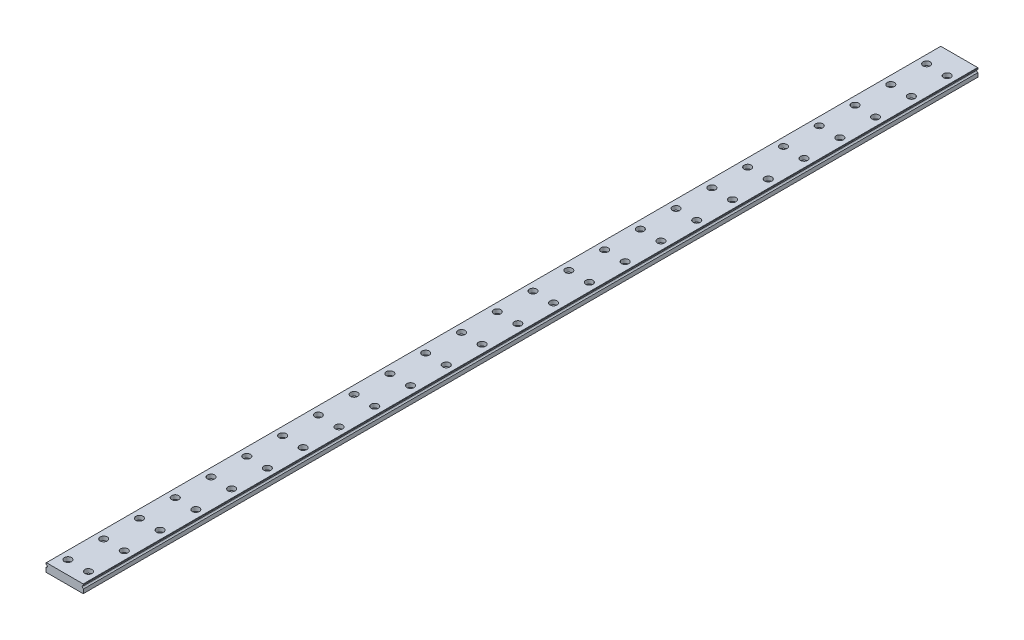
ISO-10303-21;
HEADER;
FILE_DESCRIPTION(('STEP AP214'),'2;1');
FILE_NAME('part.step','',(''),(''),'','','');
FILE_SCHEMA(('AUTOMOTIVE_DESIGN { 1 0 10303 214 1 1 1 1 }'));
ENDSEC;
DATA;
#1=APPLICATION_CONTEXT('core data for automotive mechanical design processes');
#2=APPLICATION_PROTOCOL_DEFINITION('international standard','automotive_design',2000,#1);
#3=PRODUCT_CONTEXT('',#1,'mechanical');
#4=PRODUCT('Part','Part','',(#3));
#5=PRODUCT_RELATED_PRODUCT_CATEGORY('part','',(#4));
#6=PRODUCT_DEFINITION_FORMATION('','',#4);
#7=PRODUCT_DEFINITION_CONTEXT('part definition',#1,'design');
#8=PRODUCT_DEFINITION('design','',#6,#7);
#9=PRODUCT_DEFINITION_SHAPE('','',#8);
#10=(LENGTH_UNIT() NAMED_UNIT(*) SI_UNIT(.MILLI.,.METRE.));
#11=(NAMED_UNIT(*) PLANE_ANGLE_UNIT() SI_UNIT($,.RADIAN.));
#12=(NAMED_UNIT(*) SI_UNIT($,.STERADIAN.) SOLID_ANGLE_UNIT());
#13=UNCERTAINTY_MEASURE_WITH_UNIT(LENGTH_MEASURE(1.E-05),#10,'distance_accuracy_value','');
#14=(GEOMETRIC_REPRESENTATION_CONTEXT(3) GLOBAL_UNCERTAINTY_ASSIGNED_CONTEXT((#13)) GLOBAL_UNIT_ASSIGNED_CONTEXT((#10,
#11,#12)) REPRESENTATION_CONTEXT('',''));
#15=CARTESIAN_POINT('',(0.,0.,0.));
#16=DIRECTION('',(0.,0.,1.));
#17=DIRECTION('',(1.,0.,0.));
#18=AXIS2_PLACEMENT_3D('',#15,#16,#17);
#19=CARTESIAN_POINT('',(-20.2032034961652,4.66890649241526,1.11022302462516E-13));
#20=DIRECTION('',(0.,-1.,0.));
#21=DIRECTION('',(0.,0.,1.));
#22=AXIS2_PLACEMENT_3D('',#19,#20,#21);
#23=PLANE('',#22);
#24=CARTESIAN_POINT('',(11.8967965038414,4.66890649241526,945.));
#25=DIRECTION('',(0.,1.,0.));
#26=DIRECTION('',(0.,0.,-1.));
#27=AXIS2_PLACEMENT_3D('',#24,#25,#26);
#28=CIRCLE('',#27,3.99999999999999);
#29=CARTESIAN_POINT('',(11.8967965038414,4.66890649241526,941.));
#30=VERTEX_POINT('',#29);
#31=EDGE_CURVE('E1096',#30,#30,#28,.T.);
#32=ORIENTED_EDGE('',*,*,#31,.F.);
#33=EDGE_LOOP('',(#32));
#34=FACE_BOUND('',#33,.T.);
#35=CARTESIAN_POINT('',(-11.1032034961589,4.66890649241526,905.));
#36=DIRECTION('',(0.,1.,0.));
#37=DIRECTION('',(0.,0.,-1.));
#38=AXIS2_PLACEMENT_3D('',#35,#36,#37);
#39=CIRCLE('',#38,3.99999999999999);
#40=CARTESIAN_POINT('',(-11.1032034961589,4.66890649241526,901.));
#41=VERTEX_POINT('',#40);
#42=EDGE_CURVE('E1048',#41,#41,#39,.T.);
#43=ORIENTED_EDGE('',*,*,#42,.F.);
#44=EDGE_LOOP('',(#43));
#45=FACE_BOUND('',#44,.T.);
#46=CARTESIAN_POINT('',(-11.1032034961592,4.66890649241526,865.));
#47=DIRECTION('',(0.,1.,0.));
#48=DIRECTION('',(0.,0.,-1.));
#49=AXIS2_PLACEMENT_3D('',#46,#47,#48);
#50=CIRCLE('',#49,3.99999999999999);
#51=CARTESIAN_POINT('',(-11.1032034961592,4.66890649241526,861.));
#52=VERTEX_POINT('',#51);
#53=EDGE_CURVE('E1016',#52,#52,#50,.T.);
#54=ORIENTED_EDGE('',*,*,#53,.F.);
#55=EDGE_LOOP('',(#54));
#56=FACE_BOUND('',#55,.T.);
#57=CARTESIAN_POINT('',(-11.1032034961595,4.66890649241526,825.));
#58=DIRECTION('',(0.,1.,0.));
#59=DIRECTION('',(0.,0.,-1.));
#60=AXIS2_PLACEMENT_3D('',#57,#58,#59);
#61=CIRCLE('',#60,3.99999999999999);
#62=CARTESIAN_POINT('',(-11.1032034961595,4.66890649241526,821.));
#63=VERTEX_POINT('',#62);
#64=EDGE_CURVE('E984',#63,#63,#61,.T.);
#65=ORIENTED_EDGE('',*,*,#64,.F.);
#66=EDGE_LOOP('',(#65));
#67=FACE_BOUND('',#66,.T.);
#68=CARTESIAN_POINT('',(-11.1032034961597,4.66890649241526,785.));
#69=DIRECTION('',(0.,1.,0.));
#70=DIRECTION('',(0.,0.,-1.));
#71=AXIS2_PLACEMENT_3D('',#68,#69,#70);
#72=CIRCLE('',#71,3.99999999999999);
#73=CARTESIAN_POINT('',(-11.1032034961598,4.66890649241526,781.));
#74=VERTEX_POINT('',#73);
#75=EDGE_CURVE('E952',#74,#74,#72,.T.);
#76=ORIENTED_EDGE('',*,*,#75,.F.);
#77=EDGE_LOOP('',(#76));
#78=FACE_BOUND('',#77,.T.);
#79=CARTESIAN_POINT('',(11.89679650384,4.66890649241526,745.));
#80=DIRECTION('',(0.,1.,0.));
#81=DIRECTION('',(0.,0.,-1.));
#82=AXIS2_PLACEMENT_3D('',#79,#80,#81);
#83=CIRCLE('',#82,3.99999999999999);
#84=CARTESIAN_POINT('',(11.89679650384,4.66890649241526,741.));
#85=VERTEX_POINT('',#84);
#86=EDGE_CURVE('E936',#85,#85,#83,.T.);
#87=ORIENTED_EDGE('',*,*,#86,.F.);
#88=EDGE_LOOP('',(#87));
#89=FACE_BOUND('',#88,.T.);
#90=CARTESIAN_POINT('',(-11.10320349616,4.66890649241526,745.000000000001));
#91=DIRECTION('',(0.,1.,0.));
#92=DIRECTION('',(0.,0.,-1.));
#93=AXIS2_PLACEMENT_3D('',#90,#91,#92);
#94=CIRCLE('',#93,3.99999999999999);
#95=CARTESIAN_POINT('',(-11.10320349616,4.66890649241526,741.000000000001));
#96=VERTEX_POINT('',#95);
#97=EDGE_CURVE('E920',#96,#96,#94,.T.);
#98=ORIENTED_EDGE('',*,*,#97,.F.);
#99=EDGE_LOOP('',(#98));
#100=FACE_BOUND('',#99,.T.);
#101=CARTESIAN_POINT('',(11.8967965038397,4.66890649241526,705.000000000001));
#102=DIRECTION('',(0.,1.,0.));
#103=DIRECTION('',(0.,0.,-1.));
#104=AXIS2_PLACEMENT_3D('',#101,#102,#103);
#105=CIRCLE('',#104,3.99999999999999);
#106=CARTESIAN_POINT('',(11.8967965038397,4.66890649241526,701.));
#107=VERTEX_POINT('',#106);
#108=EDGE_CURVE('E904',#107,#107,#105,.T.);
#109=ORIENTED_EDGE('',*,*,#108,.F.);
#110=EDGE_LOOP('',(#109));
#111=FACE_BOUND('',#110,.T.);
#112=CARTESIAN_POINT('',(-11.1032034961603,4.66890649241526,705.000000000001));
#113=DIRECTION('',(0.,1.,0.));
#114=DIRECTION('',(0.,0.,-1.));
#115=AXIS2_PLACEMENT_3D('',#112,#113,#114);
#116=CIRCLE('',#115,3.99999999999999);
#117=CARTESIAN_POINT('',(-11.1032034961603,4.66890649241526,701.000000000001));
#118=VERTEX_POINT('',#117);
#119=EDGE_CURVE('E888',#118,#118,#116,.T.);
#120=ORIENTED_EDGE('',*,*,#119,.F.);
#121=EDGE_LOOP('',(#120));
#122=FACE_BOUND('',#121,.T.);
#123=CARTESIAN_POINT('',(11.8967965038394,4.66890649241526,665.000000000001));
#124=DIRECTION('',(0.,1.,0.));
#125=DIRECTION('',(0.,0.,-1.));
#126=AXIS2_PLACEMENT_3D('',#123,#124,#125);
#127=CIRCLE('',#126,3.99999999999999);
#128=CARTESIAN_POINT('',(11.8967965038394,4.66890649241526,661.000000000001));
#129=VERTEX_POINT('',#128);
#130=EDGE_CURVE('E872',#129,#129,#127,.T.);
#131=ORIENTED_EDGE('',*,*,#130,.F.);
#132=EDGE_LOOP('',(#131));
#133=FACE_BOUND('',#132,.T.);
#134=CARTESIAN_POINT('',(-11.1032034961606,4.66890649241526,665.000000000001));
#135=DIRECTION('',(0.,1.,0.));
#136=DIRECTION('',(0.,0.,-1.));
#137=AXIS2_PLACEMENT_3D('',#134,#135,#136);
#138=CIRCLE('',#137,3.99999999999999);
#139=CARTESIAN_POINT('',(-11.1032034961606,4.66890649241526,661.000000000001));
#140=VERTEX_POINT('',#139);
#141=EDGE_CURVE('E856',#140,#140,#138,.T.);
#142=ORIENTED_EDGE('',*,*,#141,.F.);
#143=EDGE_LOOP('',(#142));
#144=FACE_BOUND('',#143,.T.);
#145=CARTESIAN_POINT('',(11.8967965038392,4.66890649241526,625.000000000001));
#146=DIRECTION('',(0.,1.,0.));
#147=DIRECTION('',(0.,0.,-1.));
#148=AXIS2_PLACEMENT_3D('',#145,#146,#147);
#149=CIRCLE('',#148,3.99999999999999);
#150=CARTESIAN_POINT('',(11.8967965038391,4.66890649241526,621.000000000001));
#151=VERTEX_POINT('',#150);
#152=EDGE_CURVE('E840',#151,#151,#149,.T.);
#153=ORIENTED_EDGE('',*,*,#152,.F.);
#154=EDGE_LOOP('',(#153));
#155=FACE_BOUND('',#154,.T.);
#156=CARTESIAN_POINT('',(-11.1032034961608,4.66890649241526,625.000000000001));
#157=DIRECTION('',(0.,1.,0.));
#158=DIRECTION('',(0.,0.,-1.));
#159=AXIS2_PLACEMENT_3D('',#156,#157,#158);
#160=CIRCLE('',#159,3.99999999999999);
#161=CARTESIAN_POINT('',(-11.1032034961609,4.66890649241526,621.000000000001));
#162=VERTEX_POINT('',#161);
#163=EDGE_CURVE('E824',#162,#162,#160,.T.);
#164=ORIENTED_EDGE('',*,*,#163,.F.);
#165=EDGE_LOOP('',(#164));
#166=FACE_BOUND('',#165,.T.);
#167=CARTESIAN_POINT('',(-11.1032034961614,4.66890649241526,545.000000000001));
#168=DIRECTION('',(0.,1.,0.));
#169=DIRECTION('',(0.,0.,-1.));
#170=AXIS2_PLACEMENT_3D('',#167,#168,#169);
#171=CIRCLE('',#170,3.99999999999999);
#172=CARTESIAN_POINT('',(-11.1032034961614,4.66890649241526,541.000000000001));
#173=VERTEX_POINT('',#172);
#174=EDGE_CURVE('E760',#173,#173,#171,.T.);
#175=ORIENTED_EDGE('',*,*,#174,.F.);
#176=EDGE_LOOP('',(#175));
#177=FACE_BOUND('',#176,.T.);
#178=CARTESIAN_POINT('',(11.8967965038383,4.66890649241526,505.000000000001));
#179=DIRECTION('',(0.,1.,0.));
#180=DIRECTION('',(0.,0.,-1.));
#181=AXIS2_PLACEMENT_3D('',#178,#179,#180);
#182=CIRCLE('',#181,3.99999999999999);
#183=CARTESIAN_POINT('',(11.8967965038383,4.66890649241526,501.000000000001));
#184=VERTEX_POINT('',#183);
#185=EDGE_CURVE('E744',#184,#184,#182,.T.);
#186=ORIENTED_EDGE('',*,*,#185,.F.);
#187=EDGE_LOOP('',(#186));
#188=FACE_BOUND('',#187,.T.);
#189=CARTESIAN_POINT('',(-11.1032034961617,4.66890649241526,505.000000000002));
#190=DIRECTION('',(0.,1.,0.));
#191=DIRECTION('',(0.,0.,-1.));
#192=AXIS2_PLACEMENT_3D('',#189,#190,#191);
#193=CIRCLE('',#192,3.99999999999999);
#194=CARTESIAN_POINT('',(-11.1032034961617,4.66890649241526,501.000000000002));
#195=VERTEX_POINT('',#194);
#196=EDGE_CURVE('E728',#195,#195,#193,.T.);
#197=ORIENTED_EDGE('',*,*,#196,.F.);
#198=EDGE_LOOP('',(#197));
#199=FACE_BOUND('',#198,.T.);
#200=CARTESIAN_POINT('',(-11.103203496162,4.66890649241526,465.000000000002));
#201=DIRECTION('',(0.,1.,0.));
#202=DIRECTION('',(0.,0.,-1.));
#203=AXIS2_PLACEMENT_3D('',#200,#201,#202);
#204=CIRCLE('',#203,3.99999999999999);
#205=CARTESIAN_POINT('',(-11.103203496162,4.66890649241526,461.000000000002));
#206=VERTEX_POINT('',#205);
#207=EDGE_CURVE('E696',#206,#206,#204,.T.);
#208=ORIENTED_EDGE('',*,*,#207,.F.);
#209=EDGE_LOOP('',(#208));
#210=FACE_BOUND('',#209,.T.);
#211=CARTESIAN_POINT('',(11.8967965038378,4.66890649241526,425.000000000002));
#212=DIRECTION('',(0.,1.,0.));
#213=DIRECTION('',(0.,0.,-1.));
#214=AXIS2_PLACEMENT_3D('',#211,#212,#213);
#215=CIRCLE('',#214,3.99999999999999);
#216=CARTESIAN_POINT('',(11.8967965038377,4.66890649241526,421.000000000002));
#217=VERTEX_POINT('',#216);
#218=EDGE_CURVE('E680',#217,#217,#215,.T.);
#219=ORIENTED_EDGE('',*,*,#218,.F.);
#220=EDGE_LOOP('',(#219));
#221=FACE_BOUND('',#220,.T.);
#222=CARTESIAN_POINT('',(-11.1032034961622,4.66890649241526,425.000000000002));
#223=DIRECTION('',(0.,1.,0.));
#224=DIRECTION('',(0.,0.,-1.));
#225=AXIS2_PLACEMENT_3D('',#222,#223,#224);
#226=CIRCLE('',#225,3.99999999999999);
#227=CARTESIAN_POINT('',(-11.1032034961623,4.66890649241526,421.000000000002));
#228=VERTEX_POINT('',#227);
#229=EDGE_CURVE('E664',#228,#228,#226,.T.);
#230=ORIENTED_EDGE('',*,*,#229,.F.);
#231=EDGE_LOOP('',(#230));
#232=FACE_BOUND('',#231,.T.);
#233=CARTESIAN_POINT('',(11.8967965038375,4.66890649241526,385.000000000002));
#234=DIRECTION('',(0.,1.,0.));
#235=DIRECTION('',(0.,0.,-1.));
#236=AXIS2_PLACEMENT_3D('',#233,#234,#235);
#237=CIRCLE('',#236,3.99999999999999);
#238=CARTESIAN_POINT('',(11.8967965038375,4.66890649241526,381.000000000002));
#239=VERTEX_POINT('',#238);
#240=EDGE_CURVE('E648',#239,#239,#237,.T.);
#241=ORIENTED_EDGE('',*,*,#240,.F.);
#242=EDGE_LOOP('',(#241));
#243=FACE_BOUND('',#242,.T.);
#244=CARTESIAN_POINT('',(11.8967965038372,4.66890649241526,345.000000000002));
#245=DIRECTION('',(0.,1.,0.));
#246=DIRECTION('',(0.,0.,-1.));
#247=AXIS2_PLACEMENT_3D('',#244,#245,#246);
#248=CIRCLE('',#247,3.99999999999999);
#249=CARTESIAN_POINT('',(11.8967965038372,4.66890649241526,341.000000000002));
#250=VERTEX_POINT('',#249);
#251=EDGE_CURVE('E616',#250,#250,#248,.T.);
#252=ORIENTED_EDGE('',*,*,#251,.F.);
#253=EDGE_LOOP('',(#252));
#254=FACE_BOUND('',#253,.T.);
#255=CARTESIAN_POINT('',(11.8967965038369,4.66890649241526,305.000000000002));
#256=DIRECTION('',(0.,1.,0.));
#257=DIRECTION('',(0.,0.,-1.));
#258=AXIS2_PLACEMENT_3D('',#255,#256,#257);
#259=CIRCLE('',#258,3.99999999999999);
#260=CARTESIAN_POINT('',(11.8967965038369,4.66890649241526,301.000000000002));
#261=VERTEX_POINT('',#260);
#262=EDGE_CURVE('E584',#261,#261,#259,.T.);
#263=ORIENTED_EDGE('',*,*,#262,.F.);
#264=EDGE_LOOP('',(#263));
#265=FACE_BOUND('',#264,.T.);
#266=CARTESIAN_POINT('',(-11.1032034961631,4.66890649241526,305.000000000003));
#267=DIRECTION('',(0.,1.,0.));
#268=DIRECTION('',(0.,0.,-1.));
#269=AXIS2_PLACEMENT_3D('',#266,#267,#268);
#270=CIRCLE('',#269,3.99999999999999);
#271=CARTESIAN_POINT('',(-11.1032034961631,4.66890649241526,301.000000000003));
#272=VERTEX_POINT('',#271);
#273=EDGE_CURVE('E568',#272,#272,#270,.T.);
#274=ORIENTED_EDGE('',*,*,#273,.F.);
#275=EDGE_LOOP('',(#274));
#276=FACE_BOUND('',#275,.T.);
#277=CARTESIAN_POINT('',(11.8967965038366,4.66890649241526,265.000000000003));
#278=DIRECTION('',(0.,1.,0.));
#279=DIRECTION('',(0.,0.,-1.));
#280=AXIS2_PLACEMENT_3D('',#277,#278,#279);
#281=CIRCLE('',#280,3.99999999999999);
#282=CARTESIAN_POINT('',(11.8967965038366,4.66890649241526,261.000000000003));
#283=VERTEX_POINT('',#282);
#284=EDGE_CURVE('E552',#283,#283,#281,.T.);
#285=ORIENTED_EDGE('',*,*,#284,.F.);
#286=EDGE_LOOP('',(#285));
#287=FACE_BOUND('',#286,.T.);
#288=CARTESIAN_POINT('',(11.8967965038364,4.66890649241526,225.000000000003));
#289=DIRECTION('',(0.,1.,0.));
#290=DIRECTION('',(0.,0.,-1.));
#291=AXIS2_PLACEMENT_3D('',#288,#289,#290);
#292=CIRCLE('',#291,3.99999999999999);
#293=CARTESIAN_POINT('',(11.8967965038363,4.66890649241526,221.000000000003));
#294=VERTEX_POINT('',#293);
#295=EDGE_CURVE('E520',#294,#294,#292,.T.);
#296=ORIENTED_EDGE('',*,*,#295,.F.);
#297=EDGE_LOOP('',(#296));
#298=FACE_BOUND('',#297,.T.);
#299=CARTESIAN_POINT('',(-11.1032034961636,4.66890649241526,225.000000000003));
#300=DIRECTION('',(0.,1.,0.));
#301=DIRECTION('',(0.,0.,-1.));
#302=AXIS2_PLACEMENT_3D('',#299,#300,#301);
#303=CIRCLE('',#302,3.99999999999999);
#304=CARTESIAN_POINT('',(-11.1032034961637,4.66890649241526,221.000000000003));
#305=VERTEX_POINT('',#304);
#306=EDGE_CURVE('E504',#305,#305,#303,.T.);
#307=ORIENTED_EDGE('',*,*,#306,.F.);
#308=EDGE_LOOP('',(#307));
#309=FACE_BOUND('',#308,.T.);
#310=CARTESIAN_POINT('',(11.8967965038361,4.66890649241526,185.000000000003));
#311=DIRECTION('',(0.,1.,0.));
#312=DIRECTION('',(0.,0.,-1.));
#313=AXIS2_PLACEMENT_3D('',#310,#311,#312);
#314=CIRCLE('',#313,3.99999999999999);
#315=CARTESIAN_POINT('',(11.8967965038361,4.66890649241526,181.000000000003));
#316=VERTEX_POINT('',#315);
#317=EDGE_CURVE('E488',#316,#316,#314,.T.);
#318=ORIENTED_EDGE('',*,*,#317,.F.);
#319=EDGE_LOOP('',(#318));
#320=FACE_BOUND('',#319,.T.);
#321=CARTESIAN_POINT('',(-11.1032034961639,4.66890649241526,185.000000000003));
#322=DIRECTION('',(0.,1.,0.));
#323=DIRECTION('',(0.,0.,-1.));
#324=AXIS2_PLACEMENT_3D('',#321,#322,#323);
#325=CIRCLE('',#324,3.99999999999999);
#326=CARTESIAN_POINT('',(-11.1032034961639,4.66890649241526,181.000000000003));
#327=VERTEX_POINT('',#326);
#328=EDGE_CURVE('E472',#327,#327,#325,.T.);
#329=ORIENTED_EDGE('',*,*,#328,.F.);
#330=EDGE_LOOP('',(#329));
#331=FACE_BOUND('',#330,.T.);
#332=CARTESIAN_POINT('',(11.8967965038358,4.66890649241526,145.000000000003));
#333=DIRECTION('',(0.,1.,0.));
#334=DIRECTION('',(0.,0.,-1.));
#335=AXIS2_PLACEMENT_3D('',#332,#333,#334);
#336=CIRCLE('',#335,3.99999999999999);
#337=CARTESIAN_POINT('',(11.8967965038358,4.66890649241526,141.000000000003));
#338=VERTEX_POINT('',#337);
#339=EDGE_CURVE('E456',#338,#338,#336,.T.);
#340=ORIENTED_EDGE('',*,*,#339,.F.);
#341=EDGE_LOOP('',(#340));
#342=FACE_BOUND('',#341,.T.);
#343=CARTESIAN_POINT('',(-11.1032034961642,4.66890649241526,145.000000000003));
#344=DIRECTION('',(0.,1.,0.));
#345=DIRECTION('',(0.,0.,-1.));
#346=AXIS2_PLACEMENT_3D('',#343,#344,#345);
#347=CIRCLE('',#346,3.99999999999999);
#348=CARTESIAN_POINT('',(-11.1032034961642,4.66890649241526,141.000000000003));
#349=VERTEX_POINT('',#348);
#350=EDGE_CURVE('E440',#349,#349,#347,.T.);
#351=ORIENTED_EDGE('',*,*,#350,.F.);
#352=EDGE_LOOP('',(#351));
#353=FACE_BOUND('',#352,.T.);
#354=CARTESIAN_POINT('',(11.8967965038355,4.66890649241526,105.000000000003));
#355=DIRECTION('',(0.,1.,0.));
#356=DIRECTION('',(0.,0.,-1.));
#357=AXIS2_PLACEMENT_3D('',#354,#355,#356);
#358=CIRCLE('',#357,3.99999999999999);
#359=CARTESIAN_POINT('',(11.8967965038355,4.66890649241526,101.000000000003));
#360=VERTEX_POINT('',#359);
#361=EDGE_CURVE('E424',#360,#360,#358,.T.);
#362=ORIENTED_EDGE('',*,*,#361,.F.);
#363=EDGE_LOOP('',(#362));
#364=FACE_BOUND('',#363,.T.);
#365=CARTESIAN_POINT('',(-11.1032034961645,4.66890649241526,105.000000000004));
#366=DIRECTION('',(0.,1.,0.));
#367=DIRECTION('',(0.,0.,-1.));
#368=AXIS2_PLACEMENT_3D('',#365,#366,#367);
#369=CIRCLE('',#368,3.99999999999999);
#370=CARTESIAN_POINT('',(-11.1032034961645,4.66890649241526,101.000000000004));
#371=VERTEX_POINT('',#370);
#372=EDGE_CURVE('E408',#371,#371,#369,.T.);
#373=ORIENTED_EDGE('',*,*,#372,.F.);
#374=EDGE_LOOP('',(#373));
#375=FACE_BOUND('',#374,.T.);
#376=CARTESIAN_POINT('',(11.8967965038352,4.66890649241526,65.0000000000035));
#377=DIRECTION('',(0.,1.,0.));
#378=DIRECTION('',(0.,0.,-1.));
#379=AXIS2_PLACEMENT_3D('',#376,#377,#378);
#380=CIRCLE('',#379,3.99999999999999);
#381=CARTESIAN_POINT('',(11.8967965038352,4.66890649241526,61.0000000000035));
#382=VERTEX_POINT('',#381);
#383=EDGE_CURVE('E392',#382,#382,#380,.T.);
#384=ORIENTED_EDGE('',*,*,#383,.F.);
#385=EDGE_LOOP('',(#384));
#386=FACE_BOUND('',#385,.T.);
#387=CARTESIAN_POINT('',(-11.1032034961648,4.66890649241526,65.0000000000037));
#388=DIRECTION('',(0.,1.,0.));
#389=DIRECTION('',(0.,0.,-1.));
#390=AXIS2_PLACEMENT_3D('',#387,#388,#389);
#391=CIRCLE('',#390,3.99999999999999);
#392=CARTESIAN_POINT('',(-11.1032034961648,4.66890649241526,61.0000000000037));
#393=VERTEX_POINT('',#392);
#394=EDGE_CURVE('E376',#393,#393,#391,.T.);
#395=ORIENTED_EDGE('',*,*,#394,.F.);
#396=EDGE_LOOP('',(#395));
#397=FACE_BOUND('',#396,.T.);
#398=CARTESIAN_POINT('',(11.896796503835,4.66890649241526,25.0000000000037));
#399=DIRECTION('',(0.,1.,0.));
#400=DIRECTION('',(0.,0.,-1.));
#401=AXIS2_PLACEMENT_3D('',#398,#399,#400);
#402=CIRCLE('',#401,3.99999999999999);
#403=CARTESIAN_POINT('',(11.8967965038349,4.66890649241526,21.0000000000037));
#404=VERTEX_POINT('',#403);
#405=EDGE_CURVE('E360',#404,#404,#402,.T.);
#406=ORIENTED_EDGE('',*,*,#405,.F.);
#407=EDGE_LOOP('',(#406));
#408=FACE_BOUND('',#407,.T.);
#409=CARTESIAN_POINT('',(-11.103203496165,4.66890649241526,25.0000000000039));
#410=DIRECTION('',(0.,1.,0.));
#411=DIRECTION('',(0.,0.,-1.));
#412=AXIS2_PLACEMENT_3D('',#409,#410,#411);
#413=CIRCLE('',#412,3.99999999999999);
#414=CARTESIAN_POINT('',(-11.1032034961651,4.66890649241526,21.0000000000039));
#415=VERTEX_POINT('',#414);
#416=EDGE_CURVE('E344',#415,#415,#413,.T.);
#417=ORIENTED_EDGE('',*,*,#416,.F.);
#418=EDGE_LOOP('',(#417));
#419=FACE_BOUND('',#418,.T.);
#420=CARTESIAN_POINT('',(11.8967965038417,4.66890649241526,985.));
#421=DIRECTION('',(0.,1.,0.));
#422=DIRECTION('',(0.,0.,-1.));
#423=AXIS2_PLACEMENT_3D('',#420,#421,#422);
#424=CIRCLE('',#423,3.99999999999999);
#425=CARTESIAN_POINT('',(11.8967965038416,4.66890649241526,981.));
#426=VERTEX_POINT('',#425);
#427=EDGE_CURVE('E328',#426,#426,#424,.T.);
#428=ORIENTED_EDGE('',*,*,#427,.F.);
#429=EDGE_LOOP('',(#428));
#430=FACE_BOUND('',#429,.T.);
#431=CARTESIAN_POINT('',(-11.1032034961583,4.66890649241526,985.));
#432=DIRECTION('',(0.,1.,0.));
#433=DIRECTION('',(0.,0.,-1.));
#434=AXIS2_PLACEMENT_3D('',#431,#432,#433);
#435=CIRCLE('',#434,3.99999999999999);
#436=CARTESIAN_POINT('',(-11.1032034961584,4.66890649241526,981.));
#437=VERTEX_POINT('',#436);
#438=EDGE_CURVE('E312',#437,#437,#435,.T.);
#439=ORIENTED_EDGE('',*,*,#438,.F.);
#440=EDGE_LOOP('',(#439));
#441=FACE_BOUND('',#440,.T.);
#442=DIRECTION('',(1.,0.,0.));
#443=VECTOR('',#442,1.);
#444=CARTESIAN_POINT('',(-20.2032034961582,4.66890649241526,1000.));
#445=LINE('',#444,#443);
#446=CARTESIAN_POINT('',(-20.2032034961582,4.66890649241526,1000.));
#447=VERTEX_POINT('',#446);
#448=CARTESIAN_POINT('',(20.9967965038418,4.66890649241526,1000.));
#449=VERTEX_POINT('',#448);
#450=EDGE_CURVE('E193',#447,#449,#445,.T.);
#451=ORIENTED_EDGE('',*,*,#450,.T.);
#452=DIRECTION('',(0.,0.,1.));
#453=VECTOR('',#452,1.);
#454=CARTESIAN_POINT('',(20.9967965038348,4.66890649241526,-2.22044604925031E-13));
#455=LINE('',#454,#453);
#456=CARTESIAN_POINT('',(20.9967965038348,4.66890649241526,-2.22044604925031E-13));
#457=VERTEX_POINT('',#456);
#458=EDGE_CURVE('E221',#457,#449,#455,.T.);
#459=ORIENTED_EDGE('',*,*,#458,.F.);
#460=DIRECTION('',(1.,0.,0.));
#461=VECTOR('',#460,1.);
#462=CARTESIAN_POINT('',(-20.2032034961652,4.66890649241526,1.11022302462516E-13));
#463=LINE('',#462,#461);
#464=CARTESIAN_POINT('',(-20.2032034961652,4.66890649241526,1.11022302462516E-13));
#465=VERTEX_POINT('',#464);
#466=EDGE_CURVE('E273',#465,#457,#463,.T.);
#467=ORIENTED_EDGE('',*,*,#466,.F.);
#468=DIRECTION('',(0.,0.,1.));
#469=VECTOR('',#468,1.);
#470=CARTESIAN_POINT('',(-20.2032034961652,4.66890649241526,1.11022302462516E-13));
#471=LINE('',#470,#469);
#472=EDGE_CURVE('E225',#465,#447,#471,.T.);
#473=ORIENTED_EDGE('',*,*,#472,.T.);
#474=EDGE_LOOP('',(#451,#459,#467,#473));
#475=FACE_BOUND('',#474,.T.);
#476=CARTESIAN_POINT('',(-11.1032034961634,4.66890649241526,265.000000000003));
#477=DIRECTION('',(0.,1.,0.));
#478=DIRECTION('',(0.,0.,-1.));
#479=AXIS2_PLACEMENT_3D('',#476,#477,#478);
#480=CIRCLE('',#479,3.99999999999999);
#481=CARTESIAN_POINT('',(-11.1032034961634,4.66890649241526,261.000000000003));
#482=VERTEX_POINT('',#481);
#483=EDGE_CURVE('E536',#482,#482,#480,.T.);
#484=ORIENTED_EDGE('',*,*,#483,.F.);
#485=EDGE_LOOP('',(#484));
#486=FACE_BOUND('',#485,.T.);
#487=CARTESIAN_POINT('',(-11.1032034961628,4.66890649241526,345.000000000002));
#488=DIRECTION('',(0.,1.,0.));
#489=DIRECTION('',(0.,0.,-1.));
#490=AXIS2_PLACEMENT_3D('',#487,#488,#489);
#491=CIRCLE('',#490,3.99999999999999);
#492=CARTESIAN_POINT('',(-11.1032034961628,4.66890649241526,341.000000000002));
#493=VERTEX_POINT('',#492);
#494=EDGE_CURVE('E600',#493,#493,#491,.T.);
#495=ORIENTED_EDGE('',*,*,#494,.F.);
#496=EDGE_LOOP('',(#495));
#497=FACE_BOUND('',#496,.T.);
#498=CARTESIAN_POINT('',(-11.1032034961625,4.66890649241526,385.000000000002));
#499=DIRECTION('',(0.,1.,0.));
#500=DIRECTION('',(0.,0.,-1.));
#501=AXIS2_PLACEMENT_3D('',#498,#499,#500);
#502=CIRCLE('',#501,3.99999999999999);
#503=CARTESIAN_POINT('',(-11.1032034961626,4.66890649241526,381.000000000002));
#504=VERTEX_POINT('',#503);
#505=EDGE_CURVE('E632',#504,#504,#502,.T.);
#506=ORIENTED_EDGE('',*,*,#505,.F.);
#507=EDGE_LOOP('',(#506));
#508=FACE_BOUND('',#507,.T.);
#509=CARTESIAN_POINT('',(11.896796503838,4.66890649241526,465.000000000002));
#510=DIRECTION('',(0.,1.,0.));
#511=DIRECTION('',(0.,0.,-1.));
#512=AXIS2_PLACEMENT_3D('',#509,#510,#511);
#513=CIRCLE('',#512,3.99999999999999);
#514=CARTESIAN_POINT('',(11.896796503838,4.66890649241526,461.000000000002));
#515=VERTEX_POINT('',#514);
#516=EDGE_CURVE('E712',#515,#515,#513,.T.);
#517=ORIENTED_EDGE('',*,*,#516,.F.);
#518=EDGE_LOOP('',(#517));
#519=FACE_BOUND('',#518,.T.);
#520=CARTESIAN_POINT('',(11.8967965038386,4.66890649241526,545.000000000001));
#521=DIRECTION('',(0.,1.,0.));
#522=DIRECTION('',(0.,0.,-1.));
#523=AXIS2_PLACEMENT_3D('',#520,#521,#522);
#524=CIRCLE('',#523,3.99999999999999);
#525=CARTESIAN_POINT('',(11.8967965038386,4.66890649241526,541.000000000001));
#526=VERTEX_POINT('',#525);
#527=EDGE_CURVE('E776',#526,#526,#524,.T.);
#528=ORIENTED_EDGE('',*,*,#527,.F.);
#529=EDGE_LOOP('',(#528));
#530=FACE_BOUND('',#529,.T.);
#531=CARTESIAN_POINT('',(-11.1032034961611,4.66890649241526,585.000000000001));
#532=DIRECTION('',(0.,1.,0.));
#533=DIRECTION('',(0.,0.,-1.));
#534=AXIS2_PLACEMENT_3D('',#531,#532,#533);
#535=CIRCLE('',#534,3.99999999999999);
#536=CARTESIAN_POINT('',(-11.1032034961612,4.66890649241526,581.000000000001));
#537=VERTEX_POINT('',#536);
#538=EDGE_CURVE('E792',#537,#537,#535,.T.);
#539=ORIENTED_EDGE('',*,*,#538,.F.);
#540=EDGE_LOOP('',(#539));
#541=FACE_BOUND('',#540,.T.);
#542=CARTESIAN_POINT('',(11.8967965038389,4.66890649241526,585.000000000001));
#543=DIRECTION('',(0.,1.,0.));
#544=DIRECTION('',(0.,0.,-1.));
#545=AXIS2_PLACEMENT_3D('',#542,#543,#544);
#546=CIRCLE('',#545,3.99999999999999);
#547=CARTESIAN_POINT('',(11.8967965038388,4.66890649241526,581.000000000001));
#548=VERTEX_POINT('',#547);
#549=EDGE_CURVE('E808',#548,#548,#546,.T.);
#550=ORIENTED_EDGE('',*,*,#549,.F.);
#551=EDGE_LOOP('',(#550));
#552=FACE_BOUND('',#551,.T.);
#553=CARTESIAN_POINT('',(11.8967965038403,4.66890649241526,785.));
#554=DIRECTION('',(0.,1.,0.));
#555=DIRECTION('',(0.,0.,-1.));
#556=AXIS2_PLACEMENT_3D('',#553,#554,#555);
#557=CIRCLE('',#556,3.99999999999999);
#558=CARTESIAN_POINT('',(11.8967965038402,4.66890649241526,781.));
#559=VERTEX_POINT('',#558);
#560=EDGE_CURVE('E968',#559,#559,#557,.T.);
#561=ORIENTED_EDGE('',*,*,#560,.F.);
#562=EDGE_LOOP('',(#561));
#563=FACE_BOUND('',#562,.T.);
#564=CARTESIAN_POINT('',(11.8967965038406,4.66890649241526,825.));
#565=DIRECTION('',(0.,1.,0.));
#566=DIRECTION('',(0.,0.,-1.));
#567=AXIS2_PLACEMENT_3D('',#564,#565,#566);
#568=CIRCLE('',#567,3.99999999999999);
#569=CARTESIAN_POINT('',(11.8967965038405,4.66890649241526,821.));
#570=VERTEX_POINT('',#569);
#571=EDGE_CURVE('E1000',#570,#570,#568,.T.);
#572=ORIENTED_EDGE('',*,*,#571,.F.);
#573=EDGE_LOOP('',(#572));
#574=FACE_BOUND('',#573,.T.);
#575=CARTESIAN_POINT('',(11.8967965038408,4.66890649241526,865.));
#576=DIRECTION('',(0.,1.,0.));
#577=DIRECTION('',(0.,0.,-1.));
#578=AXIS2_PLACEMENT_3D('',#575,#576,#577);
#579=CIRCLE('',#578,3.99999999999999);
#580=CARTESIAN_POINT('',(11.8967965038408,4.66890649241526,861.));
#581=VERTEX_POINT('',#580);
#582=EDGE_CURVE('E1032',#581,#581,#579,.T.);
#583=ORIENTED_EDGE('',*,*,#582,.F.);
#584=EDGE_LOOP('',(#583));
#585=FACE_BOUND('',#584,.T.);
#586=CARTESIAN_POINT('',(11.8967965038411,4.66890649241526,905.));
#587=DIRECTION('',(0.,1.,0.));
#588=DIRECTION('',(0.,0.,-1.));
#589=AXIS2_PLACEMENT_3D('',#586,#587,#588);
#590=CIRCLE('',#589,3.99999999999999);
#591=CARTESIAN_POINT('',(11.8967965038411,4.66890649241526,901.));
#592=VERTEX_POINT('',#591);
#593=EDGE_CURVE('E1064',#592,#592,#590,.T.);
#594=ORIENTED_EDGE('',*,*,#593,.F.);
#595=EDGE_LOOP('',(#594));
#596=FACE_BOUND('',#595,.T.);
#597=CARTESIAN_POINT('',(-11.1032034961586,4.66890649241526,945.));
#598=DIRECTION('',(0.,1.,0.));
#599=DIRECTION('',(0.,0.,-1.));
#600=AXIS2_PLACEMENT_3D('',#597,#598,#599);
#601=CIRCLE('',#600,3.99999999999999);
#602=CARTESIAN_POINT('',(-11.1032034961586,4.66890649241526,941.));
#603=VERTEX_POINT('',#602);
#604=EDGE_CURVE('E1080',#603,#603,#601,.T.);
#605=ORIENTED_EDGE('',*,*,#604,.F.);
#606=EDGE_LOOP('',(#605));
#607=FACE_BOUND('',#606,.T.);
#608=ADVANCED_FACE('F50',(#34,#45,#56,#67,#78,#89,#100,#111,#122,#133,#144,#155,#166,#177,#188,
#199,#210,#221,#232,#243,#254,#265,#276,#287,#298,#309,#320,#331,#342,#353,#364,#375,#386,#397,
#408,#419,#430,#441,#475,#486,#497,#508,#519,#530,#541,#552,#563,#574,#585,#596,#607),#23,.F.);
#609=CARTESIAN_POINT('',(-20.2032034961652,-4.83109350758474,1.11022302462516E-13));
#610=DIRECTION('',(0.707106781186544,0.707106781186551,0.));
#611=DIRECTION('',(0.707106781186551,-0.707106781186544,0.));
#612=AXIS2_PLACEMENT_3D('',#609,#610,#611);
#613=PLANE('',#612);
#614=DIRECTION('',(-0.707106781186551,0.707106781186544,0.));
#615=VECTOR('',#614,1.);
#616=CARTESIAN_POINT('',(-20.2032034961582,-4.83109350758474,1000.));
#617=LINE('',#616,#615);
#618=CARTESIAN_POINT('',(-20.2032034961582,-4.83109350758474,1000.));
#619=VERTEX_POINT('',#618);
#620=CARTESIAN_POINT('',(-20.6032034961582,-4.43109350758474,1000.));
#621=VERTEX_POINT('',#620);
#622=EDGE_CURVE('E176',#619,#621,#617,.T.);
#623=ORIENTED_EDGE('',*,*,#622,.T.);
#624=DIRECTION('',(0.,0.,1.));
#625=VECTOR('',#624,1.);
#626=CARTESIAN_POINT('',(-20.6032034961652,-4.43109350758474,1.11022302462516E-13));
#627=LINE('',#626,#625);
#628=CARTESIAN_POINT('',(-20.6032034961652,-4.43109350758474,1.11022302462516E-13));
#629=VERTEX_POINT('',#628);
#630=EDGE_CURVE('E60',#629,#621,#627,.T.);
#631=ORIENTED_EDGE('',*,*,#630,.F.);
#632=DIRECTION('',(-0.707106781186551,0.707106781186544,0.));
#633=VECTOR('',#632,1.);
#634=CARTESIAN_POINT('',(-20.2032034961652,-4.83109350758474,1.11022302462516E-13));
#635=LINE('',#634,#633);
#636=CARTESIAN_POINT('',(-20.2032034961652,-4.83109350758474,1.11022302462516E-13));
#637=VERTEX_POINT('',#636);
#638=EDGE_CURVE('E294',#637,#629,#635,.T.);
#639=ORIENTED_EDGE('',*,*,#638,.F.);
#640=DIRECTION('',(0.,0.,1.));
#641=VECTOR('',#640,1.);
#642=CARTESIAN_POINT('',(-20.2032034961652,-4.83109350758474,1.11022302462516E-13));
#643=LINE('',#642,#641);
#644=EDGE_CURVE('E12',#637,#619,#643,.T.);
#645=ORIENTED_EDGE('',*,*,#644,.T.);
#646=EDGE_LOOP('',(#623,#631,#639,#645));
#647=FACE_BOUND('',#646,.T.);
#648=ADVANCED_FACE('F52',(#647),#613,.F.);
#649=CARTESIAN_POINT('',(-20.6032034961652,-4.43109350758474,1.11022302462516E-13));
#650=DIRECTION('',(1.,0.,0.));
#651=DIRECTION('',(0.,0.,-1.));
#652=AXIS2_PLACEMENT_3D('',#649,#650,#651);
#653=PLANE('',#652);
#654=DIRECTION('',(0.,1.,0.));
#655=VECTOR('',#654,1.);
#656=CARTESIAN_POINT('',(-20.6032034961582,-4.43109350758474,1000.));
#657=LINE('',#656,#655);
#658=CARTESIAN_POINT('',(-20.6032034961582,0.0689064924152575,1000.));
#659=VERTEX_POINT('',#658);
#660=EDGE_CURVE('E179',#621,#659,#657,.T.);
#661=ORIENTED_EDGE('',*,*,#660,.T.);
#662=DIRECTION('',(0.,0.,1.));
#663=VECTOR('',#662,1.);
#664=CARTESIAN_POINT('',(-20.6032034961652,0.0689064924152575,1.11022302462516E-13));
#665=LINE('',#664,#663);
#666=CARTESIAN_POINT('',(-20.6032034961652,0.0689064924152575,1.11022302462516E-13));
#667=VERTEX_POINT('',#666);
#668=EDGE_CURVE('E237',#667,#659,#665,.T.);
#669=ORIENTED_EDGE('',*,*,#668,.F.);
#670=DIRECTION('',(0.,1.,0.));
#671=VECTOR('',#670,1.);
#672=CARTESIAN_POINT('',(-20.6032034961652,-4.43109350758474,1.11022302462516E-13));
#673=LINE('',#672,#671);
#674=EDGE_CURVE('E248',#629,#667,#673,.T.);
#675=ORIENTED_EDGE('',*,*,#674,.F.);
#676=ORIENTED_EDGE('',*,*,#630,.T.);
#677=EDGE_LOOP('',(#661,#669,#675,#676));
#678=FACE_BOUND('',#677,.T.);
#679=ADVANCED_FACE('F246',(#678),#653,.F.);
#680=CARTESIAN_POINT('',(-20.6032034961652,1.56890649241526,1.11022302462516E-13));
#681=DIRECTION('',(0.,0.,1.));
#682=DIRECTION('',(1.,0.,0.));
#683=AXIS2_PLACEMENT_3D('',#680,#681,#682);
#684=CYLINDRICAL_SURFACE('',#683,1.5);
#685=CARTESIAN_POINT('',(-20.6032034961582,1.56890649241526,1000.));
#686=DIRECTION('',(0.,0.,1.));
#687=DIRECTION('',(-1.,0.,0.));
#688=AXIS2_PLACEMENT_3D('',#685,#686,#687);
#689=CIRCLE('',#688,1.5);
#690=CARTESIAN_POINT('',(-20.6032034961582,3.06890649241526,1000.));
#691=VERTEX_POINT('',#690);
#692=EDGE_CURVE('E184',#659,#691,#689,.T.);
#693=ORIENTED_EDGE('',*,*,#692,.T.);
#694=DIRECTION('',(0.,0.,1.));
#695=VECTOR('',#694,1.);
#696=CARTESIAN_POINT('',(-20.6032034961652,3.06890649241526,1.11022302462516E-13));
#697=LINE('',#696,#695);
#698=CARTESIAN_POINT('',(-20.6032034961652,3.06890649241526,1.11022302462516E-13));
#699=VERTEX_POINT('',#698);
#700=EDGE_CURVE('E233',#699,#691,#697,.T.);
#701=ORIENTED_EDGE('',*,*,#700,.F.);
#702=CARTESIAN_POINT('',(-20.6032034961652,1.56890649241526,1.11022302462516E-13));
#703=DIRECTION('',(0.,0.,1.));
#704=DIRECTION('',(-1.,0.,0.));
#705=AXIS2_PLACEMENT_3D('',#702,#703,#704);
#706=CIRCLE('',#705,1.5);
#707=EDGE_CURVE('E269',#667,#699,#706,.T.);
#708=ORIENTED_EDGE('',*,*,#707,.F.);
#709=ORIENTED_EDGE('',*,*,#668,.T.);
#710=EDGE_LOOP('',(#693,#701,#708,#709));
#711=FACE_BOUND('',#710,.T.);
#712=ADVANCED_FACE('F259',(#711),#684,.F.);
#713=CARTESIAN_POINT('',(-20.6032034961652,3.06890649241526,1.11022302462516E-13));
#714=DIRECTION('',(1.,0.,0.));
#715=DIRECTION('',(0.,0.,-1.));
#716=AXIS2_PLACEMENT_3D('',#713,#714,#715);
#717=PLANE('',#716);
#718=DIRECTION('',(0.,1.,0.));
#719=VECTOR('',#718,1.);
#720=CARTESIAN_POINT('',(-20.6032034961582,3.06890649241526,1000.));
#721=LINE('',#720,#719);
#722=CARTESIAN_POINT('',(-20.6032034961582,4.26890649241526,1000.));
#723=VERTEX_POINT('',#722);
#724=EDGE_CURVE('E187',#691,#723,#721,.T.);
#725=ORIENTED_EDGE('',*,*,#724,.T.);
#726=DIRECTION('',(0.,0.,1.));
#727=VECTOR('',#726,1.);
#728=CARTESIAN_POINT('',(-20.6032034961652,4.26890649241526,1.11022302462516E-13));
#729=LINE('',#728,#727);
#730=CARTESIAN_POINT('',(-20.6032034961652,4.26890649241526,1.11022302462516E-13));
#731=VERTEX_POINT('',#730);
#732=EDGE_CURVE('E229',#731,#723,#729,.T.);
#733=ORIENTED_EDGE('',*,*,#732,.F.);
#734=DIRECTION('',(0.,1.,0.));
#735=VECTOR('',#734,1.);
#736=CARTESIAN_POINT('',(-20.6032034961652,3.06890649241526,1.11022302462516E-13));
#737=LINE('',#736,#735);
#738=EDGE_CURVE('E265',#699,#731,#737,.T.);
#739=ORIENTED_EDGE('',*,*,#738,.F.);
#740=ORIENTED_EDGE('',*,*,#700,.T.);
#741=EDGE_LOOP('',(#725,#733,#739,#740));
#742=FACE_BOUND('',#741,.T.);
#743=ADVANCED_FACE('F263',(#742),#717,.F.);
#744=CARTESIAN_POINT('',(-20.6032034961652,4.26890649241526,1.11022302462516E-13));
#745=DIRECTION('',(0.707106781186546,-0.707106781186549,0.));
#746=DIRECTION('',(-0.707106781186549,-0.707106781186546,0.));
#747=AXIS2_PLACEMENT_3D('',#744,#745,#746);
#748=PLANE('',#747);
#749=DIRECTION('',(0.707106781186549,0.707106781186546,0.));
#750=VECTOR('',#749,1.);
#751=CARTESIAN_POINT('',(-20.6032034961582,4.26890649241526,1000.));
#752=LINE('',#751,#750);
#753=EDGE_CURVE('E190',#723,#447,#752,.T.);
#754=ORIENTED_EDGE('',*,*,#753,.T.);
#755=ORIENTED_EDGE('',*,*,#472,.F.);
#756=DIRECTION('',(0.707106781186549,0.707106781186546,0.));
#757=VECTOR('',#756,1.);
#758=CARTESIAN_POINT('',(-20.6032034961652,4.26890649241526,1.11022302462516E-13));
#759=LINE('',#758,#757);
#760=EDGE_CURVE('E268',#731,#465,#759,.T.);
#761=ORIENTED_EDGE('',*,*,#760,.F.);
#762=ORIENTED_EDGE('',*,*,#732,.T.);
#763=EDGE_LOOP('',(#754,#755,#761,#762));
#764=FACE_BOUND('',#763,.T.);
#765=ADVANCED_FACE('F1821',(#764),#748,.F.);
#766=CARTESIAN_POINT('',(20.9967965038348,4.66890649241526,-2.22044604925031E-13));
#767=DIRECTION('',(-0.707106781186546,-0.707106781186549,0.));
#768=DIRECTION('',(-0.707106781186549,0.707106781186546,0.));
#769=AXIS2_PLACEMENT_3D('',#766,#767,#768);
#770=PLANE('',#769);
#771=DIRECTION('',(0.707106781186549,-0.707106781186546,0.));
#772=VECTOR('',#771,1.);
#773=CARTESIAN_POINT('',(20.9967965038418,4.66890649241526,1000.));
#774=LINE('',#773,#772);
#775=CARTESIAN_POINT('',(21.3967965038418,4.26890649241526,1000.));
#776=VERTEX_POINT('',#775);
#777=EDGE_CURVE('E196',#449,#776,#774,.T.);
#778=ORIENTED_EDGE('',*,*,#777,.T.);
#779=DIRECTION('',(0.,0.,1.));
#780=VECTOR('',#779,1.);
#781=CARTESIAN_POINT('',(21.3967965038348,4.26890649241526,-2.22044604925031E-13));
#782=LINE('',#781,#780);
#783=CARTESIAN_POINT('',(21.3967965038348,4.26890649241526,-2.22044604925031E-13));
#784=VERTEX_POINT('',#783);
#785=EDGE_CURVE('E217',#784,#776,#782,.T.);
#786=ORIENTED_EDGE('',*,*,#785,.F.);
#787=DIRECTION('',(0.707106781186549,-0.707106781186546,0.));
#788=VECTOR('',#787,1.);
#789=CARTESIAN_POINT('',(20.9967965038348,4.66890649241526,-2.22044604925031E-13));
#790=LINE('',#789,#788);
#791=EDGE_CURVE('E280',#457,#784,#790,.T.);
#792=ORIENTED_EDGE('',*,*,#791,.F.);
#793=ORIENTED_EDGE('',*,*,#458,.T.);
#794=EDGE_LOOP('',(#778,#786,#792,#793));
#795=FACE_BOUND('',#794,.T.);
#796=ADVANCED_FACE('F288',(#795),#770,.F.);
#797=CARTESIAN_POINT('',(21.3967965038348,4.26890649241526,-2.22044604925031E-13));
#798=DIRECTION('',(-1.,0.,0.));
#799=DIRECTION('',(0.,0.,1.));
#800=AXIS2_PLACEMENT_3D('',#797,#798,#799);
#801=PLANE('',#800);
#802=DIRECTION('',(0.,-1.,0.));
#803=VECTOR('',#802,1.);
#804=CARTESIAN_POINT('',(21.3967965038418,4.26890649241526,1000.));
#805=LINE('',#804,#803);
#806=CARTESIAN_POINT('',(21.3967965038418,3.06890649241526,1000.));
#807=VERTEX_POINT('',#806);
#808=EDGE_CURVE('E199',#776,#807,#805,.T.);
#809=ORIENTED_EDGE('',*,*,#808,.T.);
#810=DIRECTION('',(0.,0.,1.));
#811=VECTOR('',#810,1.);
#812=CARTESIAN_POINT('',(21.3967965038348,3.06890649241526,-2.22044604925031E-13));
#813=LINE('',#812,#811);
#814=CARTESIAN_POINT('',(21.3967965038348,3.06890649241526,-2.22044604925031E-13));
#815=VERTEX_POINT('',#814);
#816=EDGE_CURVE('E163',#815,#807,#813,.T.);
#817=ORIENTED_EDGE('',*,*,#816,.F.);
#818=DIRECTION('',(0.,-1.,0.));
#819=VECTOR('',#818,1.);
#820=CARTESIAN_POINT('',(21.3967965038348,4.26890649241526,-2.22044604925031E-13));
#821=LINE('',#820,#819);
#822=EDGE_CURVE('E152',#784,#815,#821,.T.);
#823=ORIENTED_EDGE('',*,*,#822,.F.);
#824=ORIENTED_EDGE('',*,*,#785,.T.);
#825=EDGE_LOOP('',(#809,#817,#823,#824));
#826=FACE_BOUND('',#825,.T.);
#827=ADVANCED_FACE('F292',(#826),#801,.F.);
#828=CARTESIAN_POINT('',(21.3967965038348,1.56890649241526,-2.22044604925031E-13));
#829=DIRECTION('',(0.,0.,1.));
#830=DIRECTION('',(1.,0.,0.));
#831=AXIS2_PLACEMENT_3D('',#828,#829,#830);
#832=CYLINDRICAL_SURFACE('',#831,1.5);
#833=CARTESIAN_POINT('',(21.3967965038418,1.56890649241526,1000.));
#834=DIRECTION('',(0.,0.,1.));
#835=DIRECTION('',(-1.,0.,0.));
#836=AXIS2_PLACEMENT_3D('',#833,#834,#835);
#837=CIRCLE('',#836,1.5);
#838=CARTESIAN_POINT('',(21.3967965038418,0.0689064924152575,1000.));
#839=VERTEX_POINT('',#838);
#840=EDGE_CURVE('E161',#807,#839,#837,.T.);
#841=ORIENTED_EDGE('',*,*,#840,.T.);
#842=DIRECTION('',(0.,0.,1.));
#843=VECTOR('',#842,1.);
#844=CARTESIAN_POINT('',(21.3967965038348,0.0689064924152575,-2.22044604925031E-13));
#845=LINE('',#844,#843);
#846=CARTESIAN_POINT('',(21.3967965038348,0.0689064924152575,-2.22044604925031E-13));
#847=VERTEX_POINT('',#846);
#848=EDGE_CURVE('E158',#847,#839,#845,.T.);
#849=ORIENTED_EDGE('',*,*,#848,.F.);
#850=CARTESIAN_POINT('',(21.3967965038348,1.56890649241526,-2.22044604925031E-13));
#851=DIRECTION('',(0.,0.,1.));
#852=DIRECTION('',(-1.,0.,0.));
#853=AXIS2_PLACEMENT_3D('',#850,#851,#852);
#854=CIRCLE('',#853,1.5);
#855=EDGE_CURVE('E146',#815,#847,#854,.T.);
#856=ORIENTED_EDGE('',*,*,#855,.F.);
#857=ORIENTED_EDGE('',*,*,#816,.T.);
#858=EDGE_LOOP('',(#841,#849,#856,#857));
#859=FACE_BOUND('',#858,.T.);
#860=ADVANCED_FACE('F159',(#859),#832,.F.);
#861=CARTESIAN_POINT('',(21.3967965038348,0.0689064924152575,-2.22044604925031E-13));
#862=DIRECTION('',(-1.,0.,0.));
#863=DIRECTION('',(0.,0.,1.));
#864=AXIS2_PLACEMENT_3D('',#861,#862,#863);
#865=PLANE('',#864);
#866=DIRECTION('',(0.,-1.,0.));
#867=VECTOR('',#866,1.);
#868=CARTESIAN_POINT('',(21.3967965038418,0.0689064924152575,1000.));
#869=LINE('',#868,#867);
#870=CARTESIAN_POINT('',(21.3967965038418,-4.43109350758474,1000.));
#871=VERTEX_POINT('',#870);
#872=EDGE_CURVE('E110',#839,#871,#869,.T.);
#873=ORIENTED_EDGE('',*,*,#872,.T.);
#874=DIRECTION('',(0.,0.,1.));
#875=VECTOR('',#874,1.);
#876=CARTESIAN_POINT('',(21.3967965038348,-4.43109350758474,-2.22044604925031E-13));
#877=LINE('',#876,#875);
#878=CARTESIAN_POINT('',(21.3967965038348,-4.43109350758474,-2.22044604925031E-13));
#879=VERTEX_POINT('',#878);
#880=EDGE_CURVE('E164',#879,#871,#877,.T.);
#881=ORIENTED_EDGE('',*,*,#880,.F.);
#882=DIRECTION('',(0.,-1.,0.));
#883=VECTOR('',#882,1.);
#884=CARTESIAN_POINT('',(21.3967965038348,0.0689064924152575,-2.22044604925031E-13));
#885=LINE('',#884,#883);
#886=EDGE_CURVE('E150',#847,#879,#885,.T.);
#887=ORIENTED_EDGE('',*,*,#886,.F.);
#888=ORIENTED_EDGE('',*,*,#848,.T.);
#889=EDGE_LOOP('',(#873,#881,#887,#888));
#890=FACE_BOUND('',#889,.T.);
#891=ADVANCED_FACE('F166',(#890),#865,.F.);
#892=CARTESIAN_POINT('',(21.3967965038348,-4.43109350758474,-2.22044604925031E-13));
#893=DIRECTION('',(-0.707106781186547,0.707106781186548,0.));
#894=DIRECTION('',(0.707106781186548,0.707106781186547,0.));
#895=AXIS2_PLACEMENT_3D('',#892,#893,#894);
#896=PLANE('',#895);
#897=DIRECTION('',(-0.707106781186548,-0.707106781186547,0.));
#898=VECTOR('',#897,1.);
#899=CARTESIAN_POINT('',(21.3967965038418,-4.43109350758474,1000.));
#900=LINE('',#899,#898);
#901=CARTESIAN_POINT('',(20.9967965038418,-4.83109350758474,1000.));
#902=VERTEX_POINT('',#901);
#903=EDGE_CURVE('E117',#871,#902,#900,.T.);
#904=ORIENTED_EDGE('',*,*,#903,.T.);
#905=DIRECTION('',(0.,0.,1.));
#906=VECTOR('',#905,1.);
#907=CARTESIAN_POINT('',(20.9967965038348,-4.83109350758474,-2.22044604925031E-13));
#908=LINE('',#907,#906);
#909=CARTESIAN_POINT('',(20.9967965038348,-4.83109350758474,-2.22044604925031E-13));
#910=VERTEX_POINT('',#909);
#911=EDGE_CURVE('E172',#910,#902,#908,.T.);
#912=ORIENTED_EDGE('',*,*,#911,.F.);
#913=DIRECTION('',(-0.707106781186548,-0.707106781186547,0.));
#914=VECTOR('',#913,1.);
#915=CARTESIAN_POINT('',(21.3967965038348,-4.43109350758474,-2.22044604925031E-13));
#916=LINE('',#915,#914);
#917=EDGE_CURVE('E169',#879,#910,#916,.T.);
#918=ORIENTED_EDGE('',*,*,#917,.F.);
#919=ORIENTED_EDGE('',*,*,#880,.T.);
#920=EDGE_LOOP('',(#904,#912,#918,#919));
#921=FACE_BOUND('',#920,.T.);
#922=ADVANCED_FACE('F1810',(#921),#896,.F.);
#923=CARTESIAN_POINT('',(20.9967965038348,-4.83109350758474,-2.22044604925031E-13));
#924=DIRECTION('',(0.,1.,0.));
#925=DIRECTION('',(1.,0.,0.));
#926=AXIS2_PLACEMENT_3D('',#923,#924,#925);
#927=PLANE('',#926);
#928=CARTESIAN_POINT('',(11.8967965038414,-4.83109350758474,945.));
#929=DIRECTION('',(0.,1.,0.));
#930=DIRECTION('',(0.,0.,-1.));
#931=AXIS2_PLACEMENT_3D('',#928,#929,#930);
#932=CIRCLE('',#931,2.25);
#933=CARTESIAN_POINT('',(11.8967965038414,-4.83109350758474,942.75));
#934=VERTEX_POINT('',#933);
#935=EDGE_CURVE('E1084',#934,#934,#932,.T.);
#936=ORIENTED_EDGE('',*,*,#935,.T.);
#937=EDGE_LOOP('',(#936));
#938=FACE_BOUND('',#937,.T.);
#939=CARTESIAN_POINT('',(-11.1032034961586,-4.83109350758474,945.));
#940=DIRECTION('',(0.,1.,0.));
#941=DIRECTION('',(0.,0.,-1.));
#942=AXIS2_PLACEMENT_3D('',#939,#940,#941);
#943=CIRCLE('',#942,2.25);
#944=CARTESIAN_POINT('',(-11.1032034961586,-4.83109350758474,942.75));
#945=VERTEX_POINT('',#944);
#946=EDGE_CURVE('E1068',#945,#945,#943,.T.);
#947=ORIENTED_EDGE('',*,*,#946,.T.);
#948=EDGE_LOOP('',(#947));
#949=FACE_BOUND('',#948,.T.);
#950=CARTESIAN_POINT('',(11.8967965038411,-4.83109350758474,905.));
#951=DIRECTION('',(0.,1.,0.));
#952=DIRECTION('',(0.,0.,-1.));
#953=AXIS2_PLACEMENT_3D('',#950,#951,#952);
#954=CIRCLE('',#953,2.25);
#955=CARTESIAN_POINT('',(11.8967965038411,-4.83109350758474,902.75));
#956=VERTEX_POINT('',#955);
#957=EDGE_CURVE('E1052',#956,#956,#954,.T.);
#958=ORIENTED_EDGE('',*,*,#957,.T.);
#959=EDGE_LOOP('',(#958));
#960=FACE_BOUND('',#959,.T.);
#961=CARTESIAN_POINT('',(-11.1032034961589,-4.83109350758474,905.));
#962=DIRECTION('',(0.,1.,0.));
#963=DIRECTION('',(0.,0.,-1.));
#964=AXIS2_PLACEMENT_3D('',#961,#962,#963);
#965=CIRCLE('',#964,2.25);
#966=CARTESIAN_POINT('',(-11.1032034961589,-4.83109350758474,902.75));
#967=VERTEX_POINT('',#966);
#968=EDGE_CURVE('E1036',#967,#967,#965,.T.);
#969=ORIENTED_EDGE('',*,*,#968,.T.);
#970=EDGE_LOOP('',(#969));
#971=FACE_BOUND('',#970,.T.);
#972=CARTESIAN_POINT('',(11.8967965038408,-4.83109350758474,865.));
#973=DIRECTION('',(0.,1.,0.));
#974=DIRECTION('',(0.,0.,-1.));
#975=AXIS2_PLACEMENT_3D('',#972,#973,#974);
#976=CIRCLE('',#975,2.25);
#977=CARTESIAN_POINT('',(11.8967965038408,-4.83109350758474,862.75));
#978=VERTEX_POINT('',#977);
#979=EDGE_CURVE('E1020',#978,#978,#976,.T.);
#980=ORIENTED_EDGE('',*,*,#979,.T.);
#981=EDGE_LOOP('',(#980));
#982=FACE_BOUND('',#981,.T.);
#983=CARTESIAN_POINT('',(-11.1032034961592,-4.83109350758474,865.));
#984=DIRECTION('',(0.,1.,0.));
#985=DIRECTION('',(0.,0.,-1.));
#986=AXIS2_PLACEMENT_3D('',#983,#984,#985);
#987=CIRCLE('',#986,2.25);
#988=CARTESIAN_POINT('',(-11.1032034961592,-4.83109350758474,862.75));
#989=VERTEX_POINT('',#988);
#990=EDGE_CURVE('E1004',#989,#989,#987,.T.);
#991=ORIENTED_EDGE('',*,*,#990,.T.);
#992=EDGE_LOOP('',(#991));
#993=FACE_BOUND('',#992,.T.);
#994=CARTESIAN_POINT('',(11.8967965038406,-4.83109350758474,825.));
#995=DIRECTION('',(0.,1.,0.));
#996=DIRECTION('',(0.,0.,-1.));
#997=AXIS2_PLACEMENT_3D('',#994,#995,#996);
#998=CIRCLE('',#997,2.25);
#999=CARTESIAN_POINT('',(11.8967965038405,-4.83109350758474,822.75));
#1000=VERTEX_POINT('',#999);
#1001=EDGE_CURVE('E988',#1000,#1000,#998,.T.);
#1002=ORIENTED_EDGE('',*,*,#1001,.T.);
#1003=EDGE_LOOP('',(#1002));
#1004=FACE_BOUND('',#1003,.T.);
#1005=CARTESIAN_POINT('',(-11.1032034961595,-4.83109350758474,825.));
#1006=DIRECTION('',(0.,1.,0.));
#1007=DIRECTION('',(0.,0.,-1.));
#1008=AXIS2_PLACEMENT_3D('',#1005,#1006,#1007);
#1009=CIRCLE('',#1008,2.25);
#1010=CARTESIAN_POINT('',(-11.1032034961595,-4.83109350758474,822.75));
#1011=VERTEX_POINT('',#1010);
#1012=EDGE_CURVE('E972',#1011,#1011,#1009,.T.);
#1013=ORIENTED_EDGE('',*,*,#1012,.T.);
#1014=EDGE_LOOP('',(#1013));
#1015=FACE_BOUND('',#1014,.T.);
#1016=CARTESIAN_POINT('',(11.8967965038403,-4.83109350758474,785.));
#1017=DIRECTION('',(0.,1.,0.));
#1018=DIRECTION('',(0.,0.,-1.));
#1019=AXIS2_PLACEMENT_3D('',#1016,#1017,#1018);
#1020=CIRCLE('',#1019,2.25);
#1021=CARTESIAN_POINT('',(11.8967965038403,-4.83109350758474,782.75));
#1022=VERTEX_POINT('',#1021);
#1023=EDGE_CURVE('E956',#1022,#1022,#1020,.T.);
#1024=ORIENTED_EDGE('',*,*,#1023,.T.);
#1025=EDGE_LOOP('',(#1024));
#1026=FACE_BOUND('',#1025,.T.);
#1027=CARTESIAN_POINT('',(-11.1032034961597,-4.83109350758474,785.));
#1028=DIRECTION('',(0.,1.,0.));
#1029=DIRECTION('',(0.,0.,-1.));
#1030=AXIS2_PLACEMENT_3D('',#1027,#1028,#1029);
#1031=CIRCLE('',#1030,2.25);
#1032=CARTESIAN_POINT('',(-11.1032034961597,-4.83109350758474,782.75));
#1033=VERTEX_POINT('',#1032);
#1034=EDGE_CURVE('E940',#1033,#1033,#1031,.T.);
#1035=ORIENTED_EDGE('',*,*,#1034,.T.);
#1036=EDGE_LOOP('',(#1035));
#1037=FACE_BOUND('',#1036,.T.);
#1038=CARTESIAN_POINT('',(11.89679650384,-4.83109350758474,745.));
#1039=DIRECTION('',(0.,1.,0.));
#1040=DIRECTION('',(0.,0.,-1.));
#1041=AXIS2_PLACEMENT_3D('',#1038,#1039,#1040);
#1042=CIRCLE('',#1041,2.25);
#1043=CARTESIAN_POINT('',(11.89679650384,-4.83109350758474,742.75));
#1044=VERTEX_POINT('',#1043);
#1045=EDGE_CURVE('E924',#1044,#1044,#1042,.T.);
#1046=ORIENTED_EDGE('',*,*,#1045,.T.);
#1047=EDGE_LOOP('',(#1046));
#1048=FACE_BOUND('',#1047,.T.);
#1049=CARTESIAN_POINT('',(-11.10320349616,-4.83109350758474,745.000000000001));
#1050=DIRECTION('',(0.,1.,0.));
#1051=DIRECTION('',(0.,0.,-1.));
#1052=AXIS2_PLACEMENT_3D('',#1049,#1050,#1051);
#1053=CIRCLE('',#1052,2.25);
#1054=CARTESIAN_POINT('',(-11.10320349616,-4.83109350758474,742.750000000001));
#1055=VERTEX_POINT('',#1054);
#1056=EDGE_CURVE('E908',#1055,#1055,#1053,.T.);
#1057=ORIENTED_EDGE('',*,*,#1056,.T.);
#1058=EDGE_LOOP('',(#1057));
#1059=FACE_BOUND('',#1058,.T.);
#1060=CARTESIAN_POINT('',(11.8967965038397,-4.83109350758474,705.000000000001));
#1061=DIRECTION('',(0.,1.,0.));
#1062=DIRECTION('',(0.,0.,-1.));
#1063=AXIS2_PLACEMENT_3D('',#1060,#1061,#1062);
#1064=CIRCLE('',#1063,2.25);
#1065=CARTESIAN_POINT('',(11.8967965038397,-4.83109350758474,702.750000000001));
#1066=VERTEX_POINT('',#1065);
#1067=EDGE_CURVE('E892',#1066,#1066,#1064,.T.);
#1068=ORIENTED_EDGE('',*,*,#1067,.T.);
#1069=EDGE_LOOP('',(#1068));
#1070=FACE_BOUND('',#1069,.T.);
#1071=CARTESIAN_POINT('',(-11.1032034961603,-4.83109350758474,705.000000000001));
#1072=DIRECTION('',(0.,1.,0.));
#1073=DIRECTION('',(0.,0.,-1.));
#1074=AXIS2_PLACEMENT_3D('',#1071,#1072,#1073);
#1075=CIRCLE('',#1074,2.25);
#1076=CARTESIAN_POINT('',(-11.1032034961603,-4.83109350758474,702.750000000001));
#1077=VERTEX_POINT('',#1076);
#1078=EDGE_CURVE('E876',#1077,#1077,#1075,.T.);
#1079=ORIENTED_EDGE('',*,*,#1078,.T.);
#1080=EDGE_LOOP('',(#1079));
#1081=FACE_BOUND('',#1080,.T.);
#1082=CARTESIAN_POINT('',(11.8967965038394,-4.83109350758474,665.000000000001));
#1083=DIRECTION('',(0.,1.,0.));
#1084=DIRECTION('',(0.,0.,-1.));
#1085=AXIS2_PLACEMENT_3D('',#1082,#1083,#1084);
#1086=CIRCLE('',#1085,2.25);
#1087=CARTESIAN_POINT('',(11.8967965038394,-4.83109350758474,662.750000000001));
#1088=VERTEX_POINT('',#1087);
#1089=EDGE_CURVE('E860',#1088,#1088,#1086,.T.);
#1090=ORIENTED_EDGE('',*,*,#1089,.T.);
#1091=EDGE_LOOP('',(#1090));
#1092=FACE_BOUND('',#1091,.T.);
#1093=CARTESIAN_POINT('',(-11.1032034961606,-4.83109350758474,665.000000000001));
#1094=DIRECTION('',(0.,1.,0.));
#1095=DIRECTION('',(0.,0.,-1.));
#1096=AXIS2_PLACEMENT_3D('',#1093,#1094,#1095);
#1097=CIRCLE('',#1096,2.25);
#1098=CARTESIAN_POINT('',(-11.1032034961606,-4.83109350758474,662.750000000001));
#1099=VERTEX_POINT('',#1098);
#1100=EDGE_CURVE('E844',#1099,#1099,#1097,.T.);
#1101=ORIENTED_EDGE('',*,*,#1100,.T.);
#1102=EDGE_LOOP('',(#1101));
#1103=FACE_BOUND('',#1102,.T.);
#1104=CARTESIAN_POINT('',(11.8967965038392,-4.83109350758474,625.000000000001));
#1105=DIRECTION('',(0.,1.,0.));
#1106=DIRECTION('',(0.,0.,-1.));
#1107=AXIS2_PLACEMENT_3D('',#1104,#1105,#1106);
#1108=CIRCLE('',#1107,2.25);
#1109=CARTESIAN_POINT('',(11.8967965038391,-4.83109350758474,622.750000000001));
#1110=VERTEX_POINT('',#1109);
#1111=EDGE_CURVE('E828',#1110,#1110,#1108,.T.);
#1112=ORIENTED_EDGE('',*,*,#1111,.T.);
#1113=EDGE_LOOP('',(#1112));
#1114=FACE_BOUND('',#1113,.T.);
#1115=CARTESIAN_POINT('',(-11.1032034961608,-4.83109350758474,625.000000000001));
#1116=DIRECTION('',(0.,1.,0.));
#1117=DIRECTION('',(0.,0.,-1.));
#1118=AXIS2_PLACEMENT_3D('',#1115,#1116,#1117);
#1119=CIRCLE('',#1118,2.25);
#1120=CARTESIAN_POINT('',(-11.1032034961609,-4.83109350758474,622.750000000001));
#1121=VERTEX_POINT('',#1120);
#1122=EDGE_CURVE('E812',#1121,#1121,#1119,.T.);
#1123=ORIENTED_EDGE('',*,*,#1122,.T.);
#1124=EDGE_LOOP('',(#1123));
#1125=FACE_BOUND('',#1124,.T.);
#1126=CARTESIAN_POINT('',(11.8967965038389,-4.83109350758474,585.000000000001));
#1127=DIRECTION('',(0.,1.,0.));
#1128=DIRECTION('',(0.,0.,-1.));
#1129=AXIS2_PLACEMENT_3D('',#1126,#1127,#1128);
#1130=CIRCLE('',#1129,2.25);
#1131=CARTESIAN_POINT('',(11.8967965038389,-4.83109350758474,582.750000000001));
#1132=VERTEX_POINT('',#1131);
#1133=EDGE_CURVE('E796',#1132,#1132,#1130,.T.);
#1134=ORIENTED_EDGE('',*,*,#1133,.T.);
#1135=EDGE_LOOP('',(#1134));
#1136=FACE_BOUND('',#1135,.T.);
#1137=CARTESIAN_POINT('',(-11.1032034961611,-4.83109350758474,585.000000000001));
#1138=DIRECTION('',(0.,1.,0.));
#1139=DIRECTION('',(0.,0.,-1.));
#1140=AXIS2_PLACEMENT_3D('',#1137,#1138,#1139);
#1141=CIRCLE('',#1140,2.25);
#1142=CARTESIAN_POINT('',(-11.1032034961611,-4.83109350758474,582.750000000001));
#1143=VERTEX_POINT('',#1142);
#1144=EDGE_CURVE('E780',#1143,#1143,#1141,.T.);
#1145=ORIENTED_EDGE('',*,*,#1144,.T.);
#1146=EDGE_LOOP('',(#1145));
#1147=FACE_BOUND('',#1146,.T.);
#1148=CARTESIAN_POINT('',(11.8967965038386,-4.83109350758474,545.000000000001));
#1149=DIRECTION('',(0.,1.,0.));
#1150=DIRECTION('',(0.,0.,-1.));
#1151=AXIS2_PLACEMENT_3D('',#1148,#1149,#1150);
#1152=CIRCLE('',#1151,2.25);
#1153=CARTESIAN_POINT('',(11.8967965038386,-4.83109350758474,542.750000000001));
#1154=VERTEX_POINT('',#1153);
#1155=EDGE_CURVE('E764',#1154,#1154,#1152,.T.);
#1156=ORIENTED_EDGE('',*,*,#1155,.T.);
#1157=EDGE_LOOP('',(#1156));
#1158=FACE_BOUND('',#1157,.T.);
#1159=CARTESIAN_POINT('',(-11.1032034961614,-4.83109350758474,545.000000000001));
#1160=DIRECTION('',(0.,1.,0.));
#1161=DIRECTION('',(0.,0.,-1.));
#1162=AXIS2_PLACEMENT_3D('',#1159,#1160,#1161);
#1163=CIRCLE('',#1162,2.25);
#1164=CARTESIAN_POINT('',(-11.1032034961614,-4.83109350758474,542.750000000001));
#1165=VERTEX_POINT('',#1164);
#1166=EDGE_CURVE('E748',#1165,#1165,#1163,.T.);
#1167=ORIENTED_EDGE('',*,*,#1166,.T.);
#1168=EDGE_LOOP('',(#1167));
#1169=FACE_BOUND('',#1168,.T.);
#1170=CARTESIAN_POINT('',(11.8967965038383,-4.83109350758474,505.000000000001));
#1171=DIRECTION('',(0.,1.,0.));
#1172=DIRECTION('',(0.,0.,-1.));
#1173=AXIS2_PLACEMENT_3D('',#1170,#1171,#1172);
#1174=CIRCLE('',#1173,2.25);
#1175=CARTESIAN_POINT('',(11.8967965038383,-4.83109350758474,502.750000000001));
#1176=VERTEX_POINT('',#1175);
#1177=EDGE_CURVE('E732',#1176,#1176,#1174,.T.);
#1178=ORIENTED_EDGE('',*,*,#1177,.T.);
#1179=EDGE_LOOP('',(#1178));
#1180=FACE_BOUND('',#1179,.T.);
#1181=CARTESIAN_POINT('',(-11.1032034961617,-4.83109350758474,505.000000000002));
#1182=DIRECTION('',(0.,1.,0.));
#1183=DIRECTION('',(0.,0.,-1.));
#1184=AXIS2_PLACEMENT_3D('',#1181,#1182,#1183);
#1185=CIRCLE('',#1184,2.25);
#1186=CARTESIAN_POINT('',(-11.1032034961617,-4.83109350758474,502.750000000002));
#1187=VERTEX_POINT('',#1186);
#1188=EDGE_CURVE('E716',#1187,#1187,#1185,.T.);
#1189=ORIENTED_EDGE('',*,*,#1188,.T.);
#1190=EDGE_LOOP('',(#1189));
#1191=FACE_BOUND('',#1190,.T.);
#1192=CARTESIAN_POINT('',(11.896796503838,-4.83109350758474,465.000000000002));
#1193=DIRECTION('',(0.,1.,0.));
#1194=DIRECTION('',(0.,0.,-1.));
#1195=AXIS2_PLACEMENT_3D('',#1192,#1193,#1194);
#1196=CIRCLE('',#1195,2.25);
#1197=CARTESIAN_POINT('',(11.896796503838,-4.83109350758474,462.750000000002));
#1198=VERTEX_POINT('',#1197);
#1199=EDGE_CURVE('E700',#1198,#1198,#1196,.T.);
#1200=ORIENTED_EDGE('',*,*,#1199,.T.);
#1201=EDGE_LOOP('',(#1200));
#1202=FACE_BOUND('',#1201,.T.);
#1203=CARTESIAN_POINT('',(-11.103203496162,-4.83109350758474,465.000000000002));
#1204=DIRECTION('',(0.,1.,0.));
#1205=DIRECTION('',(0.,0.,-1.));
#1206=AXIS2_PLACEMENT_3D('',#1203,#1204,#1205);
#1207=CIRCLE('',#1206,2.25);
#1208=CARTESIAN_POINT('',(-11.103203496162,-4.83109350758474,462.750000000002));
#1209=VERTEX_POINT('',#1208);
#1210=EDGE_CURVE('E684',#1209,#1209,#1207,.T.);
#1211=ORIENTED_EDGE('',*,*,#1210,.T.);
#1212=EDGE_LOOP('',(#1211));
#1213=FACE_BOUND('',#1212,.T.);
#1214=CARTESIAN_POINT('',(11.8967965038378,-4.83109350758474,425.000000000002));
#1215=DIRECTION('',(0.,1.,0.));
#1216=DIRECTION('',(0.,0.,-1.));
#1217=AXIS2_PLACEMENT_3D('',#1214,#1215,#1216);
#1218=CIRCLE('',#1217,2.25);
#1219=CARTESIAN_POINT('',(11.8967965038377,-4.83109350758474,422.750000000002));
#1220=VERTEX_POINT('',#1219);
#1221=EDGE_CURVE('E668',#1220,#1220,#1218,.T.);
#1222=ORIENTED_EDGE('',*,*,#1221,.T.);
#1223=EDGE_LOOP('',(#1222));
#1224=FACE_BOUND('',#1223,.T.);
#1225=CARTESIAN_POINT('',(-11.1032034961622,-4.83109350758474,425.000000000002));
#1226=DIRECTION('',(0.,1.,0.));
#1227=DIRECTION('',(0.,0.,-1.));
#1228=AXIS2_PLACEMENT_3D('',#1225,#1226,#1227);
#1229=CIRCLE('',#1228,2.25);
#1230=CARTESIAN_POINT('',(-11.1032034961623,-4.83109350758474,422.750000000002));
#1231=VERTEX_POINT('',#1230);
#1232=EDGE_CURVE('E652',#1231,#1231,#1229,.T.);
#1233=ORIENTED_EDGE('',*,*,#1232,.T.);
#1234=EDGE_LOOP('',(#1233));
#1235=FACE_BOUND('',#1234,.T.);
#1236=CARTESIAN_POINT('',(11.8967965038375,-4.83109350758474,385.000000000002));
#1237=DIRECTION('',(0.,1.,0.));
#1238=DIRECTION('',(0.,0.,-1.));
#1239=AXIS2_PLACEMENT_3D('',#1236,#1237,#1238);
#1240=CIRCLE('',#1239,2.25);
#1241=CARTESIAN_POINT('',(11.8967965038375,-4.83109350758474,382.750000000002));
#1242=VERTEX_POINT('',#1241);
#1243=EDGE_CURVE('E636',#1242,#1242,#1240,.T.);
#1244=ORIENTED_EDGE('',*,*,#1243,.T.);
#1245=EDGE_LOOP('',(#1244));
#1246=FACE_BOUND('',#1245,.T.);
#1247=CARTESIAN_POINT('',(-11.1032034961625,-4.83109350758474,385.000000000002));
#1248=DIRECTION('',(0.,1.,0.));
#1249=DIRECTION('',(0.,0.,-1.));
#1250=AXIS2_PLACEMENT_3D('',#1247,#1248,#1249);
#1251=CIRCLE('',#1250,2.25);
#1252=CARTESIAN_POINT('',(-11.1032034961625,-4.83109350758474,382.750000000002));
#1253=VERTEX_POINT('',#1252);
#1254=EDGE_CURVE('E620',#1253,#1253,#1251,.T.);
#1255=ORIENTED_EDGE('',*,*,#1254,.T.);
#1256=EDGE_LOOP('',(#1255));
#1257=FACE_BOUND('',#1256,.T.);
#1258=CARTESIAN_POINT('',(11.8967965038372,-4.83109350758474,345.000000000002));
#1259=DIRECTION('',(0.,1.,0.));
#1260=DIRECTION('',(0.,0.,-1.));
#1261=AXIS2_PLACEMENT_3D('',#1258,#1259,#1260);
#1262=CIRCLE('',#1261,2.25);
#1263=CARTESIAN_POINT('',(11.8967965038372,-4.83109350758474,342.750000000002));
#1264=VERTEX_POINT('',#1263);
#1265=EDGE_CURVE('E604',#1264,#1264,#1262,.T.);
#1266=ORIENTED_EDGE('',*,*,#1265,.T.);
#1267=EDGE_LOOP('',(#1266));
#1268=FACE_BOUND('',#1267,.T.);
#1269=CARTESIAN_POINT('',(-11.1032034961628,-4.83109350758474,345.000000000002));
#1270=DIRECTION('',(0.,1.,0.));
#1271=DIRECTION('',(0.,0.,-1.));
#1272=AXIS2_PLACEMENT_3D('',#1269,#1270,#1271);
#1273=CIRCLE('',#1272,2.25);
#1274=CARTESIAN_POINT('',(-11.1032034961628,-4.83109350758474,342.750000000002));
#1275=VERTEX_POINT('',#1274);
#1276=EDGE_CURVE('E588',#1275,#1275,#1273,.T.);
#1277=ORIENTED_EDGE('',*,*,#1276,.T.);
#1278=EDGE_LOOP('',(#1277));
#1279=FACE_BOUND('',#1278,.T.);
#1280=CARTESIAN_POINT('',(11.8967965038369,-4.83109350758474,305.000000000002));
#1281=DIRECTION('',(0.,1.,0.));
#1282=DIRECTION('',(0.,0.,-1.));
#1283=AXIS2_PLACEMENT_3D('',#1280,#1281,#1282);
#1284=CIRCLE('',#1283,2.25);
#1285=CARTESIAN_POINT('',(11.8967965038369,-4.83109350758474,302.750000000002));
#1286=VERTEX_POINT('',#1285);
#1287=EDGE_CURVE('E572',#1286,#1286,#1284,.T.);
#1288=ORIENTED_EDGE('',*,*,#1287,.T.);
#1289=EDGE_LOOP('',(#1288));
#1290=FACE_BOUND('',#1289,.T.);
#1291=CARTESIAN_POINT('',(-11.1032034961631,-4.83109350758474,305.000000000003));
#1292=DIRECTION('',(0.,1.,0.));
#1293=DIRECTION('',(0.,0.,-1.));
#1294=AXIS2_PLACEMENT_3D('',#1291,#1292,#1293);
#1295=CIRCLE('',#1294,2.25);
#1296=CARTESIAN_POINT('',(-11.1032034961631,-4.83109350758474,302.750000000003));
#1297=VERTEX_POINT('',#1296);
#1298=EDGE_CURVE('E556',#1297,#1297,#1295,.T.);
#1299=ORIENTED_EDGE('',*,*,#1298,.T.);
#1300=EDGE_LOOP('',(#1299));
#1301=FACE_BOUND('',#1300,.T.);
#1302=CARTESIAN_POINT('',(11.8967965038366,-4.83109350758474,265.000000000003));
#1303=DIRECTION('',(0.,1.,0.));
#1304=DIRECTION('',(0.,0.,-1.));
#1305=AXIS2_PLACEMENT_3D('',#1302,#1303,#1304);
#1306=CIRCLE('',#1305,2.25);
#1307=CARTESIAN_POINT('',(11.8967965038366,-4.83109350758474,262.750000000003));
#1308=VERTEX_POINT('',#1307);
#1309=EDGE_CURVE('E540',#1308,#1308,#1306,.T.);
#1310=ORIENTED_EDGE('',*,*,#1309,.T.);
#1311=EDGE_LOOP('',(#1310));
#1312=FACE_BOUND('',#1311,.T.);
#1313=CARTESIAN_POINT('',(-11.1032034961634,-4.83109350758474,265.000000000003));
#1314=DIRECTION('',(0.,1.,0.));
#1315=DIRECTION('',(0.,0.,-1.));
#1316=AXIS2_PLACEMENT_3D('',#1313,#1314,#1315);
#1317=CIRCLE('',#1316,2.25);
#1318=CARTESIAN_POINT('',(-11.1032034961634,-4.83109350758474,262.750000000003));
#1319=VERTEX_POINT('',#1318);
#1320=EDGE_CURVE('E524',#1319,#1319,#1317,.T.);
#1321=ORIENTED_EDGE('',*,*,#1320,.T.);
#1322=EDGE_LOOP('',(#1321));
#1323=FACE_BOUND('',#1322,.T.);
#1324=CARTESIAN_POINT('',(11.8967965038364,-4.83109350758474,225.000000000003));
#1325=DIRECTION('',(0.,1.,0.));
#1326=DIRECTION('',(0.,0.,-1.));
#1327=AXIS2_PLACEMENT_3D('',#1324,#1325,#1326);
#1328=CIRCLE('',#1327,2.25);
#1329=CARTESIAN_POINT('',(11.8967965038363,-4.83109350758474,222.750000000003));
#1330=VERTEX_POINT('',#1329);
#1331=EDGE_CURVE('E508',#1330,#1330,#1328,.T.);
#1332=ORIENTED_EDGE('',*,*,#1331,.T.);
#1333=EDGE_LOOP('',(#1332));
#1334=FACE_BOUND('',#1333,.T.);
#1335=CARTESIAN_POINT('',(-11.1032034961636,-4.83109350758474,225.000000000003));
#1336=DIRECTION('',(0.,1.,0.));
#1337=DIRECTION('',(0.,0.,-1.));
#1338=AXIS2_PLACEMENT_3D('',#1335,#1336,#1337);
#1339=CIRCLE('',#1338,2.25);
#1340=CARTESIAN_POINT('',(-11.1032034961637,-4.83109350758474,222.750000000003));
#1341=VERTEX_POINT('',#1340);
#1342=EDGE_CURVE('E492',#1341,#1341,#1339,.T.);
#1343=ORIENTED_EDGE('',*,*,#1342,.T.);
#1344=EDGE_LOOP('',(#1343));
#1345=FACE_BOUND('',#1344,.T.);
#1346=CARTESIAN_POINT('',(11.8967965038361,-4.83109350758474,185.000000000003));
#1347=DIRECTION('',(0.,1.,0.));
#1348=DIRECTION('',(0.,0.,-1.));
#1349=AXIS2_PLACEMENT_3D('',#1346,#1347,#1348);
#1350=CIRCLE('',#1349,2.25);
#1351=CARTESIAN_POINT('',(11.8967965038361,-4.83109350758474,182.750000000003));
#1352=VERTEX_POINT('',#1351);
#1353=EDGE_CURVE('E476',#1352,#1352,#1350,.T.);
#1354=ORIENTED_EDGE('',*,*,#1353,.T.);
#1355=EDGE_LOOP('',(#1354));
#1356=FACE_BOUND('',#1355,.T.);
#1357=CARTESIAN_POINT('',(-11.1032034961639,-4.83109350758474,185.000000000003));
#1358=DIRECTION('',(0.,1.,0.));
#1359=DIRECTION('',(0.,0.,-1.));
#1360=AXIS2_PLACEMENT_3D('',#1357,#1358,#1359);
#1361=CIRCLE('',#1360,2.25);
#1362=CARTESIAN_POINT('',(-11.1032034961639,-4.83109350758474,182.750000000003));
#1363=VERTEX_POINT('',#1362);
#1364=EDGE_CURVE('E460',#1363,#1363,#1361,.T.);
#1365=ORIENTED_EDGE('',*,*,#1364,.T.);
#1366=EDGE_LOOP('',(#1365));
#1367=FACE_BOUND('',#1366,.T.);
#1368=CARTESIAN_POINT('',(11.8967965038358,-4.83109350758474,145.000000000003));
#1369=DIRECTION('',(0.,1.,0.));
#1370=DIRECTION('',(0.,0.,-1.));
#1371=AXIS2_PLACEMENT_3D('',#1368,#1369,#1370);
#1372=CIRCLE('',#1371,2.25);
#1373=CARTESIAN_POINT('',(11.8967965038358,-4.83109350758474,142.750000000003));
#1374=VERTEX_POINT('',#1373);
#1375=EDGE_CURVE('E444',#1374,#1374,#1372,.T.);
#1376=ORIENTED_EDGE('',*,*,#1375,.T.);
#1377=EDGE_LOOP('',(#1376));
#1378=FACE_BOUND('',#1377,.T.);
#1379=CARTESIAN_POINT('',(-11.1032034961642,-4.83109350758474,145.000000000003));
#1380=DIRECTION('',(0.,1.,0.));
#1381=DIRECTION('',(0.,0.,-1.));
#1382=AXIS2_PLACEMENT_3D('',#1379,#1380,#1381);
#1383=CIRCLE('',#1382,2.25);
#1384=CARTESIAN_POINT('',(-11.1032034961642,-4.83109350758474,142.750000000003));
#1385=VERTEX_POINT('',#1384);
#1386=EDGE_CURVE('E428',#1385,#1385,#1383,.T.);
#1387=ORIENTED_EDGE('',*,*,#1386,.T.);
#1388=EDGE_LOOP('',(#1387));
#1389=FACE_BOUND('',#1388,.T.);
#1390=CARTESIAN_POINT('',(11.8967965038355,-4.83109350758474,105.000000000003));
#1391=DIRECTION('',(0.,1.,0.));
#1392=DIRECTION('',(0.,0.,-1.));
#1393=AXIS2_PLACEMENT_3D('',#1390,#1391,#1392);
#1394=CIRCLE('',#1393,2.25);
#1395=CARTESIAN_POINT('',(11.8967965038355,-4.83109350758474,102.750000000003));
#1396=VERTEX_POINT('',#1395);
#1397=EDGE_CURVE('E412',#1396,#1396,#1394,.T.);
#1398=ORIENTED_EDGE('',*,*,#1397,.T.);
#1399=EDGE_LOOP('',(#1398));
#1400=FACE_BOUND('',#1399,.T.);
#1401=CARTESIAN_POINT('',(-11.1032034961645,-4.83109350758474,105.000000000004));
#1402=DIRECTION('',(0.,1.,0.));
#1403=DIRECTION('',(0.,0.,-1.));
#1404=AXIS2_PLACEMENT_3D('',#1401,#1402,#1403);
#1405=CIRCLE('',#1404,2.25);
#1406=CARTESIAN_POINT('',(-11.1032034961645,-4.83109350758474,102.750000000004));
#1407=VERTEX_POINT('',#1406);
#1408=EDGE_CURVE('E396',#1407,#1407,#1405,.T.);
#1409=ORIENTED_EDGE('',*,*,#1408,.T.);
#1410=EDGE_LOOP('',(#1409));
#1411=FACE_BOUND('',#1410,.T.);
#1412=CARTESIAN_POINT('',(11.8967965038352,-4.83109350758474,65.0000000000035));
#1413=DIRECTION('',(0.,1.,0.));
#1414=DIRECTION('',(0.,0.,-1.));
#1415=AXIS2_PLACEMENT_3D('',#1412,#1413,#1414);
#1416=CIRCLE('',#1415,2.25);
#1417=CARTESIAN_POINT('',(11.8967965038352,-4.83109350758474,62.7500000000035));
#1418=VERTEX_POINT('',#1417);
#1419=EDGE_CURVE('E380',#1418,#1418,#1416,.T.);
#1420=ORIENTED_EDGE('',*,*,#1419,.T.);
#1421=EDGE_LOOP('',(#1420));
#1422=FACE_BOUND('',#1421,.T.);
#1423=CARTESIAN_POINT('',(-11.1032034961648,-4.83109350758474,65.0000000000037));
#1424=DIRECTION('',(0.,1.,0.));
#1425=DIRECTION('',(0.,0.,-1.));
#1426=AXIS2_PLACEMENT_3D('',#1423,#1424,#1425);
#1427=CIRCLE('',#1426,2.25);
#1428=CARTESIAN_POINT('',(-11.1032034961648,-4.83109350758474,62.7500000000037));
#1429=VERTEX_POINT('',#1428);
#1430=EDGE_CURVE('E364',#1429,#1429,#1427,.T.);
#1431=ORIENTED_EDGE('',*,*,#1430,.T.);
#1432=EDGE_LOOP('',(#1431));
#1433=FACE_BOUND('',#1432,.T.);
#1434=CARTESIAN_POINT('',(11.896796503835,-4.83109350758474,25.0000000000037));
#1435=DIRECTION('',(0.,1.,0.));
#1436=DIRECTION('',(0.,0.,-1.));
#1437=AXIS2_PLACEMENT_3D('',#1434,#1435,#1436);
#1438=CIRCLE('',#1437,2.25);
#1439=CARTESIAN_POINT('',(11.896796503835,-4.83109350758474,22.7500000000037));
#1440=VERTEX_POINT('',#1439);
#1441=EDGE_CURVE('E348',#1440,#1440,#1438,.T.);
#1442=ORIENTED_EDGE('',*,*,#1441,.T.);
#1443=EDGE_LOOP('',(#1442));
#1444=FACE_BOUND('',#1443,.T.);
#1445=CARTESIAN_POINT('',(-11.103203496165,-4.83109350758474,25.0000000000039));
#1446=DIRECTION('',(0.,1.,0.));
#1447=DIRECTION('',(0.,0.,-1.));
#1448=AXIS2_PLACEMENT_3D('',#1445,#1446,#1447);
#1449=CIRCLE('',#1448,2.25);
#1450=CARTESIAN_POINT('',(-11.1032034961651,-4.83109350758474,22.7500000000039));
#1451=VERTEX_POINT('',#1450);
#1452=EDGE_CURVE('E332',#1451,#1451,#1449,.T.);
#1453=ORIENTED_EDGE('',*,*,#1452,.T.);
#1454=EDGE_LOOP('',(#1453));
#1455=FACE_BOUND('',#1454,.T.);
#1456=CARTESIAN_POINT('',(11.8967965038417,-4.83109350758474,985.));
#1457=DIRECTION('',(0.,1.,0.));
#1458=DIRECTION('',(0.,0.,-1.));
#1459=AXIS2_PLACEMENT_3D('',#1456,#1457,#1458);
#1460=CIRCLE('',#1459,2.25);
#1461=CARTESIAN_POINT('',(11.8967965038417,-4.83109350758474,982.75));
#1462=VERTEX_POINT('',#1461);
#1463=EDGE_CURVE('E316',#1462,#1462,#1460,.T.);
#1464=ORIENTED_EDGE('',*,*,#1463,.T.);
#1465=EDGE_LOOP('',(#1464));
#1466=FACE_BOUND('',#1465,.T.);
#1467=CARTESIAN_POINT('',(-11.1032034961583,-4.83109350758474,985.));
#1468=DIRECTION('',(0.,1.,0.));
#1469=DIRECTION('',(0.,0.,-1.));
#1470=AXIS2_PLACEMENT_3D('',#1467,#1468,#1469);
#1471=CIRCLE('',#1470,2.25);
#1472=CARTESIAN_POINT('',(-11.1032034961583,-4.83109350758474,982.75));
#1473=VERTEX_POINT('',#1472);
#1474=EDGE_CURVE('E180',#1473,#1473,#1471,.T.);
#1475=ORIENTED_EDGE('',*,*,#1474,.T.);
#1476=EDGE_LOOP('',(#1475));
#1477=FACE_BOUND('',#1476,.T.);
#1478=DIRECTION('',(-1.,0.,0.));
#1479=VECTOR('',#1478,1.);
#1480=CARTESIAN_POINT('',(20.9967965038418,-4.83109350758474,1000.));
#1481=LINE('',#1480,#1479);
#1482=EDGE_CURVE('E208',#902,#619,#1481,.T.);
#1483=ORIENTED_EDGE('',*,*,#1482,.T.);
#1484=ORIENTED_EDGE('',*,*,#644,.F.);
#1485=DIRECTION('',(-1.,0.,0.));
#1486=VECTOR('',#1485,1.);
#1487=CARTESIAN_POINT('',(-9.80320349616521,-4.83109350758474,1.11022302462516E-13));
#1488=LINE('',#1487,#1486);
#1489=EDGE_CURVE('E68',#910,#637,#1488,.T.);
#1490=ORIENTED_EDGE('',*,*,#1489,.F.);
#1491=ORIENTED_EDGE('',*,*,#911,.T.);
#1492=EDGE_LOOP('',(#1483,#1484,#1490,#1491));
#1493=FACE_BOUND('',#1492,.T.);
#1494=ADVANCED_FACE('F293',(#938,#949,#960,#971,#982,#993,#1004,#1015,#1026,#1037,#1048,#1059,
#1070,#1081,#1092,#1103,#1114,#1125,#1136,#1147,#1158,#1169,#1180,#1191,#1202,#1213,#1224,#1235,
#1246,#1257,#1268,#1279,#1290,#1301,#1312,#1323,#1334,#1345,#1356,#1367,#1378,#1389,#1400,#1411,
#1422,#1433,#1444,#1455,#1466,#1477,#1493),#927,.F.);
#1495=CARTESIAN_POINT('',(-20.6032034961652,1.56890649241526,1.11022302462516E-13));
#1496=DIRECTION('',(0.,0.,-1.));
#1497=DIRECTION('',(-1.,0.,0.));
#1498=AXIS2_PLACEMENT_3D('',#1495,#1496,#1497);
#1499=PLANE('',#1498);
#1500=ORIENTED_EDGE('',*,*,#1489,.T.);
#1501=ORIENTED_EDGE('',*,*,#638,.T.);
#1502=ORIENTED_EDGE('',*,*,#674,.T.);
#1503=ORIENTED_EDGE('',*,*,#707,.T.);
#1504=ORIENTED_EDGE('',*,*,#738,.T.);
#1505=ORIENTED_EDGE('',*,*,#760,.T.);
#1506=ORIENTED_EDGE('',*,*,#466,.T.);
#1507=ORIENTED_EDGE('',*,*,#791,.T.);
#1508=ORIENTED_EDGE('',*,*,#822,.T.);
#1509=ORIENTED_EDGE('',*,*,#855,.T.);
#1510=ORIENTED_EDGE('',*,*,#886,.T.);
#1511=ORIENTED_EDGE('',*,*,#917,.T.);
#1512=EDGE_LOOP('',(#1500,#1501,#1502,#1503,#1504,#1505,#1506,#1507,#1508,#1509,#1510,#1511));
#1513=FACE_BOUND('',#1512,.T.);
#1514=ADVANCED_FACE('F148',(#1513),#1499,.T.);
#1515=CARTESIAN_POINT('',(-20.6032034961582,1.56890649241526,1000.));
#1516=DIRECTION('',(0.,0.,-1.));
#1517=DIRECTION('',(-1.,0.,0.));
#1518=AXIS2_PLACEMENT_3D('',#1515,#1516,#1517);
#1519=PLANE('',#1518);
#1520=ORIENTED_EDGE('',*,*,#622,.F.);
#1521=ORIENTED_EDGE('',*,*,#1482,.F.);
#1522=ORIENTED_EDGE('',*,*,#903,.F.);
#1523=ORIENTED_EDGE('',*,*,#872,.F.);
#1524=ORIENTED_EDGE('',*,*,#840,.F.);
#1525=ORIENTED_EDGE('',*,*,#808,.F.);
#1526=ORIENTED_EDGE('',*,*,#777,.F.);
#1527=ORIENTED_EDGE('',*,*,#450,.F.);
#1528=ORIENTED_EDGE('',*,*,#753,.F.);
#1529=ORIENTED_EDGE('',*,*,#724,.F.);
#1530=ORIENTED_EDGE('',*,*,#692,.F.);
#1531=ORIENTED_EDGE('',*,*,#660,.F.);
#1532=EDGE_LOOP('',(#1520,#1521,#1522,#1523,#1524,#1525,#1526,#1527,#1528,#1529,#1530,#1531));
#1533=FACE_BOUND('',#1532,.T.);
#1534=ADVANCED_FACE('F253',(#1533),#1519,.F.);
#1535=CARTESIAN_POINT('',(-11.1032034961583,4.66890649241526,985.));
#1536=DIRECTION('',(0.,1.,0.));
#1537=DIRECTION('',(0.,0.,-1.));
#1538=AXIS2_PLACEMENT_3D('',#1535,#1536,#1537);
#1539=CYLINDRICAL_SURFACE('',#1538,2.25000000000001);
#1540=ORIENTED_EDGE('',*,*,#1474,.F.);
#1541=EDGE_LOOP('',(#1540));
#1542=FACE_BOUND('',#1541,.T.);
#1543=CARTESIAN_POINT('',(-11.1032034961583,0.168906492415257,985.));
#1544=DIRECTION('',(0.,1.,0.));
#1545=DIRECTION('',(0.,0.,-1.));
#1546=AXIS2_PLACEMENT_3D('',#1543,#1544,#1545);
#1547=CIRCLE('',#1546,2.25000000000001);
#1548=CARTESIAN_POINT('',(-11.1032034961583,0.168906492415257,982.75));
#1549=VERTEX_POINT('',#1548);
#1550=EDGE_CURVE('E304',#1549,#1549,#1547,.T.);
#1551=ORIENTED_EDGE('',*,*,#1550,.T.);
#1552=EDGE_LOOP('',(#1551));
#1553=FACE_BOUND('',#1552,.T.);
#1554=ADVANCED_FACE('F1799',(#1542,#1553),#1539,.F.);
#1555=CARTESIAN_POINT('',(-13.3532034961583,0.168906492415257,985.));
#1556=DIRECTION('',(0.,-1.,0.));
#1557=DIRECTION('',(0.,0.,1.));
#1558=AXIS2_PLACEMENT_3D('',#1555,#1556,#1557);
#1559=PLANE('',#1558);
#1560=ORIENTED_EDGE('',*,*,#1550,.F.);
#1561=EDGE_LOOP('',(#1560));
#1562=FACE_BOUND('',#1561,.T.);
#1563=CARTESIAN_POINT('',(-11.1032034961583,0.168906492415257,985.));
#1564=DIRECTION('',(0.,1.,0.));
#1565=DIRECTION('',(0.,0.,-1.));
#1566=AXIS2_PLACEMENT_3D('',#1563,#1564,#1565);
#1567=CIRCLE('',#1566,3.99999999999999);
#1568=CARTESIAN_POINT('',(-11.1032034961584,0.168906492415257,981.));
#1569=VERTEX_POINT('',#1568);
#1570=EDGE_CURVE('E308',#1569,#1569,#1567,.T.);
#1571=ORIENTED_EDGE('',*,*,#1570,.T.);
#1572=EDGE_LOOP('',(#1571));
#1573=FACE_BOUND('',#1572,.T.);
#1574=ADVANCED_FACE('F1795',(#1562,#1573),#1559,.F.);
#1575=CARTESIAN_POINT('',(-11.1032034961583,4.66890649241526,985.));
#1576=DIRECTION('',(0.,1.,0.));
#1577=DIRECTION('',(0.,0.,-1.));
#1578=AXIS2_PLACEMENT_3D('',#1575,#1576,#1577);
#1579=CYLINDRICAL_SURFACE('',#1578,3.99999999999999);
#1580=ORIENTED_EDGE('',*,*,#1570,.F.);
#1581=EDGE_LOOP('',(#1580));
#1582=FACE_BOUND('',#1581,.T.);
#1583=ORIENTED_EDGE('',*,*,#438,.T.);
#1584=EDGE_LOOP('',(#1583));
#1585=FACE_BOUND('',#1584,.T.);
#1586=ADVANCED_FACE('F1791',(#1582,#1585),#1579,.F.);
#1587=CARTESIAN_POINT('',(11.8967965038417,4.66890649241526,985.));
#1588=DIRECTION('',(0.,1.,0.));
#1589=DIRECTION('',(0.,0.,-1.));
#1590=AXIS2_PLACEMENT_3D('',#1587,#1588,#1589);
#1591=CYLINDRICAL_SURFACE('',#1590,2.25000000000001);
#1592=ORIENTED_EDGE('',*,*,#1463,.F.);
#1593=EDGE_LOOP('',(#1592));
#1594=FACE_BOUND('',#1593,.T.);
#1595=CARTESIAN_POINT('',(11.8967965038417,0.168906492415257,985.));
#1596=DIRECTION('',(0.,1.,0.));
#1597=DIRECTION('',(0.,0.,-1.));
#1598=AXIS2_PLACEMENT_3D('',#1595,#1596,#1597);
#1599=CIRCLE('',#1598,2.25000000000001);
#1600=CARTESIAN_POINT('',(11.8967965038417,0.168906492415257,982.75));
#1601=VERTEX_POINT('',#1600);
#1602=EDGE_CURVE('E320',#1601,#1601,#1599,.T.);
#1603=ORIENTED_EDGE('',*,*,#1602,.T.);
#1604=EDGE_LOOP('',(#1603));
#1605=FACE_BOUND('',#1604,.T.);
#1606=ADVANCED_FACE('F1787',(#1594,#1605),#1591,.F.);
#1607=CARTESIAN_POINT('',(9.64679650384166,0.168906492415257,985.));
#1608=DIRECTION('',(0.,-1.,0.));
#1609=DIRECTION('',(0.,0.,1.));
#1610=AXIS2_PLACEMENT_3D('',#1607,#1608,#1609);
#1611=PLANE('',#1610);
#1612=ORIENTED_EDGE('',*,*,#1602,.F.);
#1613=EDGE_LOOP('',(#1612));
#1614=FACE_BOUND('',#1613,.T.);
#1615=CARTESIAN_POINT('',(11.8967965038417,0.168906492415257,985.));
#1616=DIRECTION('',(0.,1.,0.));
#1617=DIRECTION('',(0.,0.,-1.));
#1618=AXIS2_PLACEMENT_3D('',#1615,#1616,#1617);
#1619=CIRCLE('',#1618,3.99999999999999);
#1620=CARTESIAN_POINT('',(11.8967965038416,0.168906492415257,981.));
#1621=VERTEX_POINT('',#1620);
#1622=EDGE_CURVE('E324',#1621,#1621,#1619,.T.);
#1623=ORIENTED_EDGE('',*,*,#1622,.T.);
#1624=EDGE_LOOP('',(#1623));
#1625=FACE_BOUND('',#1624,.T.);
#1626=ADVANCED_FACE('F1783',(#1614,#1625),#1611,.F.);
#1627=CARTESIAN_POINT('',(11.8967965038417,4.66890649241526,985.));
#1628=DIRECTION('',(0.,1.,0.));
#1629=DIRECTION('',(0.,0.,-1.));
#1630=AXIS2_PLACEMENT_3D('',#1627,#1628,#1629);
#1631=CYLINDRICAL_SURFACE('',#1630,3.99999999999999);
#1632=ORIENTED_EDGE('',*,*,#1622,.F.);
#1633=EDGE_LOOP('',(#1632));
#1634=FACE_BOUND('',#1633,.T.);
#1635=ORIENTED_EDGE('',*,*,#427,.T.);
#1636=EDGE_LOOP('',(#1635));
#1637=FACE_BOUND('',#1636,.T.);
#1638=ADVANCED_FACE('F1779',(#1634,#1637),#1631,.F.);
#1639=CARTESIAN_POINT('',(-11.103203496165,4.66890649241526,25.0000000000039));
#1640=DIRECTION('',(0.,1.,0.));
#1641=DIRECTION('',(0.,0.,-1.));
#1642=AXIS2_PLACEMENT_3D('',#1639,#1640,#1641);
#1643=CYLINDRICAL_SURFACE('',#1642,2.25000000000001);
#1644=ORIENTED_EDGE('',*,*,#1452,.F.);
#1645=EDGE_LOOP('',(#1644));
#1646=FACE_BOUND('',#1645,.T.);
#1647=CARTESIAN_POINT('',(-11.103203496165,0.168906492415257,25.0000000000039));
#1648=DIRECTION('',(0.,1.,0.));
#1649=DIRECTION('',(0.,0.,-1.));
#1650=AXIS2_PLACEMENT_3D('',#1647,#1648,#1649);
#1651=CIRCLE('',#1650,2.25000000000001);
#1652=CARTESIAN_POINT('',(-11.1032034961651,0.168906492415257,22.7500000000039));
#1653=VERTEX_POINT('',#1652);
#1654=EDGE_CURVE('E336',#1653,#1653,#1651,.T.);
#1655=ORIENTED_EDGE('',*,*,#1654,.T.);
#1656=EDGE_LOOP('',(#1655));
#1657=FACE_BOUND('',#1656,.T.);
#1658=ADVANCED_FACE('F1775',(#1646,#1657),#1643,.F.);
#1659=CARTESIAN_POINT('',(-13.353203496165,0.168906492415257,25.0000000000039));
#1660=DIRECTION('',(0.,-1.,0.));
#1661=DIRECTION('',(0.,0.,1.));
#1662=AXIS2_PLACEMENT_3D('',#1659,#1660,#1661);
#1663=PLANE('',#1662);
#1664=ORIENTED_EDGE('',*,*,#1654,.F.);
#1665=EDGE_LOOP('',(#1664));
#1666=FACE_BOUND('',#1665,.T.);
#1667=CARTESIAN_POINT('',(-11.103203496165,0.168906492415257,25.0000000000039));
#1668=DIRECTION('',(0.,1.,0.));
#1669=DIRECTION('',(0.,0.,-1.));
#1670=AXIS2_PLACEMENT_3D('',#1667,#1668,#1669);
#1671=CIRCLE('',#1670,3.99999999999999);
#1672=CARTESIAN_POINT('',(-11.1032034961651,0.168906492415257,21.0000000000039));
#1673=VERTEX_POINT('',#1672);
#1674=EDGE_CURVE('E340',#1673,#1673,#1671,.T.);
#1675=ORIENTED_EDGE('',*,*,#1674,.T.);
#1676=EDGE_LOOP('',(#1675));
#1677=FACE_BOUND('',#1676,.T.);
#1678=ADVANCED_FACE('F1771',(#1666,#1677),#1663,.F.);
#1679=CARTESIAN_POINT('',(-11.103203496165,4.66890649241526,25.0000000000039));
#1680=DIRECTION('',(0.,1.,0.));
#1681=DIRECTION('',(0.,0.,-1.));
#1682=AXIS2_PLACEMENT_3D('',#1679,#1680,#1681);
#1683=CYLINDRICAL_SURFACE('',#1682,3.99999999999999);
#1684=ORIENTED_EDGE('',*,*,#1674,.F.);
#1685=EDGE_LOOP('',(#1684));
#1686=FACE_BOUND('',#1685,.T.);
#1687=ORIENTED_EDGE('',*,*,#416,.T.);
#1688=EDGE_LOOP('',(#1687));
#1689=FACE_BOUND('',#1688,.T.);
#1690=ADVANCED_FACE('F1767',(#1686,#1689),#1683,.F.);
#1691=CARTESIAN_POINT('',(11.896796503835,4.66890649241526,25.0000000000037));
#1692=DIRECTION('',(0.,1.,0.));
#1693=DIRECTION('',(0.,0.,-1.));
#1694=AXIS2_PLACEMENT_3D('',#1691,#1692,#1693);
#1695=CYLINDRICAL_SURFACE('',#1694,2.25000000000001);
#1696=ORIENTED_EDGE('',*,*,#1441,.F.);
#1697=EDGE_LOOP('',(#1696));
#1698=FACE_BOUND('',#1697,.T.);
#1699=CARTESIAN_POINT('',(11.896796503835,0.168906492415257,25.0000000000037));
#1700=DIRECTION('',(0.,1.,0.));
#1701=DIRECTION('',(0.,0.,-1.));
#1702=AXIS2_PLACEMENT_3D('',#1699,#1700,#1701);
#1703=CIRCLE('',#1702,2.25000000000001);
#1704=CARTESIAN_POINT('',(11.896796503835,0.168906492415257,22.7500000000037));
#1705=VERTEX_POINT('',#1704);
#1706=EDGE_CURVE('E352',#1705,#1705,#1703,.T.);
#1707=ORIENTED_EDGE('',*,*,#1706,.T.);
#1708=EDGE_LOOP('',(#1707));
#1709=FACE_BOUND('',#1708,.T.);
#1710=ADVANCED_FACE('F1763',(#1698,#1709),#1695,.F.);
#1711=CARTESIAN_POINT('',(9.64679650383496,0.168906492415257,25.0000000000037));
#1712=DIRECTION('',(0.,-1.,0.));
#1713=DIRECTION('',(0.,0.,1.));
#1714=AXIS2_PLACEMENT_3D('',#1711,#1712,#1713);
#1715=PLANE('',#1714);
#1716=ORIENTED_EDGE('',*,*,#1706,.F.);
#1717=EDGE_LOOP('',(#1716));
#1718=FACE_BOUND('',#1717,.T.);
#1719=CARTESIAN_POINT('',(11.896796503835,0.168906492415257,25.0000000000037));
#1720=DIRECTION('',(0.,1.,0.));
#1721=DIRECTION('',(0.,0.,-1.));
#1722=AXIS2_PLACEMENT_3D('',#1719,#1720,#1721);
#1723=CIRCLE('',#1722,3.99999999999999);
#1724=CARTESIAN_POINT('',(11.8967965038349,0.168906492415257,21.0000000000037));
#1725=VERTEX_POINT('',#1724);
#1726=EDGE_CURVE('E356',#1725,#1725,#1723,.T.);
#1727=ORIENTED_EDGE('',*,*,#1726,.T.);
#1728=EDGE_LOOP('',(#1727));
#1729=FACE_BOUND('',#1728,.T.);
#1730=ADVANCED_FACE('F1759',(#1718,#1729),#1715,.F.);
#1731=CARTESIAN_POINT('',(11.896796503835,4.66890649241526,25.0000000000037));
#1732=DIRECTION('',(0.,1.,0.));
#1733=DIRECTION('',(0.,0.,-1.));
#1734=AXIS2_PLACEMENT_3D('',#1731,#1732,#1733);
#1735=CYLINDRICAL_SURFACE('',#1734,3.99999999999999);
#1736=ORIENTED_EDGE('',*,*,#1726,.F.);
#1737=EDGE_LOOP('',(#1736));
#1738=FACE_BOUND('',#1737,.T.);
#1739=ORIENTED_EDGE('',*,*,#405,.T.);
#1740=EDGE_LOOP('',(#1739));
#1741=FACE_BOUND('',#1740,.T.);
#1742=ADVANCED_FACE('F1755',(#1738,#1741),#1735,.F.);
#1743=CARTESIAN_POINT('',(-11.1032034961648,4.66890649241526,65.0000000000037));
#1744=DIRECTION('',(0.,1.,0.));
#1745=DIRECTION('',(0.,0.,-1.));
#1746=AXIS2_PLACEMENT_3D('',#1743,#1744,#1745);
#1747=CYLINDRICAL_SURFACE('',#1746,2.25000000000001);
#1748=ORIENTED_EDGE('',*,*,#1430,.F.);
#1749=EDGE_LOOP('',(#1748));
#1750=FACE_BOUND('',#1749,.T.);
#1751=CARTESIAN_POINT('',(-11.1032034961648,0.168906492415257,65.0000000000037));
#1752=DIRECTION('',(0.,1.,0.));
#1753=DIRECTION('',(0.,0.,-1.));
#1754=AXIS2_PLACEMENT_3D('',#1751,#1752,#1753);
#1755=CIRCLE('',#1754,2.25000000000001);
#1756=CARTESIAN_POINT('',(-11.1032034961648,0.168906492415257,62.7500000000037));
#1757=VERTEX_POINT('',#1756);
#1758=EDGE_CURVE('E368',#1757,#1757,#1755,.T.);
#1759=ORIENTED_EDGE('',*,*,#1758,.T.);
#1760=EDGE_LOOP('',(#1759));
#1761=FACE_BOUND('',#1760,.T.);
#1762=ADVANCED_FACE('F1751',(#1750,#1761),#1747,.F.);
#1763=CARTESIAN_POINT('',(-13.3532034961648,0.168906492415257,65.0000000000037));
#1764=DIRECTION('',(0.,-1.,0.));
#1765=DIRECTION('',(0.,0.,1.));
#1766=AXIS2_PLACEMENT_3D('',#1763,#1764,#1765);
#1767=PLANE('',#1766);
#1768=ORIENTED_EDGE('',*,*,#1758,.F.);
#1769=EDGE_LOOP('',(#1768));
#1770=FACE_BOUND('',#1769,.T.);
#1771=CARTESIAN_POINT('',(-11.1032034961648,0.168906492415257,65.0000000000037));
#1772=DIRECTION('',(0.,1.,0.));
#1773=DIRECTION('',(0.,0.,-1.));
#1774=AXIS2_PLACEMENT_3D('',#1771,#1772,#1773);
#1775=CIRCLE('',#1774,3.99999999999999);
#1776=CARTESIAN_POINT('',(-11.1032034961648,0.168906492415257,61.0000000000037));
#1777=VERTEX_POINT('',#1776);
#1778=EDGE_CURVE('E372',#1777,#1777,#1775,.T.);
#1779=ORIENTED_EDGE('',*,*,#1778,.T.);
#1780=EDGE_LOOP('',(#1779));
#1781=FACE_BOUND('',#1780,.T.);
#1782=ADVANCED_FACE('F1747',(#1770,#1781),#1767,.F.);
#1783=CARTESIAN_POINT('',(-11.1032034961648,4.66890649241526,65.0000000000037));
#1784=DIRECTION('',(0.,1.,0.));
#1785=DIRECTION('',(0.,0.,-1.));
#1786=AXIS2_PLACEMENT_3D('',#1783,#1784,#1785);
#1787=CYLINDRICAL_SURFACE('',#1786,3.99999999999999);
#1788=ORIENTED_EDGE('',*,*,#1778,.F.);
#1789=EDGE_LOOP('',(#1788));
#1790=FACE_BOUND('',#1789,.T.);
#1791=ORIENTED_EDGE('',*,*,#394,.T.);
#1792=EDGE_LOOP('',(#1791));
#1793=FACE_BOUND('',#1792,.T.);
#1794=ADVANCED_FACE('F1743',(#1790,#1793),#1787,.F.);
#1795=CARTESIAN_POINT('',(11.8967965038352,4.66890649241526,65.0000000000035));
#1796=DIRECTION('',(0.,1.,0.));
#1797=DIRECTION('',(0.,0.,-1.));
#1798=AXIS2_PLACEMENT_3D('',#1795,#1796,#1797);
#1799=CYLINDRICAL_SURFACE('',#1798,2.25000000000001);
#1800=ORIENTED_EDGE('',*,*,#1419,.F.);
#1801=EDGE_LOOP('',(#1800));
#1802=FACE_BOUND('',#1801,.T.);
#1803=CARTESIAN_POINT('',(11.8967965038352,0.168906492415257,65.0000000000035));
#1804=DIRECTION('',(0.,1.,0.));
#1805=DIRECTION('',(0.,0.,-1.));
#1806=AXIS2_PLACEMENT_3D('',#1803,#1804,#1805);
#1807=CIRCLE('',#1806,2.25000000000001);
#1808=CARTESIAN_POINT('',(11.8967965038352,0.168906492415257,62.7500000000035));
#1809=VERTEX_POINT('',#1808);
#1810=EDGE_CURVE('E384',#1809,#1809,#1807,.T.);
#1811=ORIENTED_EDGE('',*,*,#1810,.T.);
#1812=EDGE_LOOP('',(#1811));
#1813=FACE_BOUND('',#1812,.T.);
#1814=ADVANCED_FACE('F1739',(#1802,#1813),#1799,.F.);
#1815=CARTESIAN_POINT('',(9.64679650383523,0.168906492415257,65.0000000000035));
#1816=DIRECTION('',(0.,-1.,0.));
#1817=DIRECTION('',(0.,0.,1.));
#1818=AXIS2_PLACEMENT_3D('',#1815,#1816,#1817);
#1819=PLANE('',#1818);
#1820=ORIENTED_EDGE('',*,*,#1810,.F.);
#1821=EDGE_LOOP('',(#1820));
#1822=FACE_BOUND('',#1821,.T.);
#1823=CARTESIAN_POINT('',(11.8967965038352,0.168906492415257,65.0000000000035));
#1824=DIRECTION('',(0.,1.,0.));
#1825=DIRECTION('',(0.,0.,-1.));
#1826=AXIS2_PLACEMENT_3D('',#1823,#1824,#1825);
#1827=CIRCLE('',#1826,3.99999999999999);
#1828=CARTESIAN_POINT('',(11.8967965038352,0.168906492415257,61.0000000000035));
#1829=VERTEX_POINT('',#1828);
#1830=EDGE_CURVE('E388',#1829,#1829,#1827,.T.);
#1831=ORIENTED_EDGE('',*,*,#1830,.T.);
#1832=EDGE_LOOP('',(#1831));
#1833=FACE_BOUND('',#1832,.T.);
#1834=ADVANCED_FACE('F1735',(#1822,#1833),#1819,.F.);
#1835=CARTESIAN_POINT('',(11.8967965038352,4.66890649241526,65.0000000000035));
#1836=DIRECTION('',(0.,1.,0.));
#1837=DIRECTION('',(0.,0.,-1.));
#1838=AXIS2_PLACEMENT_3D('',#1835,#1836,#1837);
#1839=CYLINDRICAL_SURFACE('',#1838,3.99999999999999);
#1840=ORIENTED_EDGE('',*,*,#1830,.F.);
#1841=EDGE_LOOP('',(#1840));
#1842=FACE_BOUND('',#1841,.T.);
#1843=ORIENTED_EDGE('',*,*,#383,.T.);
#1844=EDGE_LOOP('',(#1843));
#1845=FACE_BOUND('',#1844,.T.);
#1846=ADVANCED_FACE('F1731',(#1842,#1845),#1839,.F.);
#1847=CARTESIAN_POINT('',(-11.1032034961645,4.66890649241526,105.000000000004));
#1848=DIRECTION('',(0.,1.,0.));
#1849=DIRECTION('',(0.,0.,-1.));
#1850=AXIS2_PLACEMENT_3D('',#1847,#1848,#1849);
#1851=CYLINDRICAL_SURFACE('',#1850,2.25000000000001);
#1852=ORIENTED_EDGE('',*,*,#1408,.F.);
#1853=EDGE_LOOP('',(#1852));
#1854=FACE_BOUND('',#1853,.T.);
#1855=CARTESIAN_POINT('',(-11.1032034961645,0.168906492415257,105.000000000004));
#1856=DIRECTION('',(0.,1.,0.));
#1857=DIRECTION('',(0.,0.,-1.));
#1858=AXIS2_PLACEMENT_3D('',#1855,#1856,#1857);
#1859=CIRCLE('',#1858,2.25000000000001);
#1860=CARTESIAN_POINT('',(-11.1032034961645,0.168906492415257,102.750000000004));
#1861=VERTEX_POINT('',#1860);
#1862=EDGE_CURVE('E400',#1861,#1861,#1859,.T.);
#1863=ORIENTED_EDGE('',*,*,#1862,.T.);
#1864=EDGE_LOOP('',(#1863));
#1865=FACE_BOUND('',#1864,.T.);
#1866=ADVANCED_FACE('F1727',(#1854,#1865),#1851,.F.);
#1867=CARTESIAN_POINT('',(-13.3532034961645,0.168906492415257,105.000000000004));
#1868=DIRECTION('',(0.,-1.,0.));
#1869=DIRECTION('',(0.,0.,1.));
#1870=AXIS2_PLACEMENT_3D('',#1867,#1868,#1869);
#1871=PLANE('',#1870);
#1872=ORIENTED_EDGE('',*,*,#1862,.F.);
#1873=EDGE_LOOP('',(#1872));
#1874=FACE_BOUND('',#1873,.T.);
#1875=CARTESIAN_POINT('',(-11.1032034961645,0.168906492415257,105.000000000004));
#1876=DIRECTION('',(0.,1.,0.));
#1877=DIRECTION('',(0.,0.,-1.));
#1878=AXIS2_PLACEMENT_3D('',#1875,#1876,#1877);
#1879=CIRCLE('',#1878,3.99999999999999);
#1880=CARTESIAN_POINT('',(-11.1032034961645,0.168906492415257,101.000000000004));
#1881=VERTEX_POINT('',#1880);
#1882=EDGE_CURVE('E404',#1881,#1881,#1879,.T.);
#1883=ORIENTED_EDGE('',*,*,#1882,.T.);
#1884=EDGE_LOOP('',(#1883));
#1885=FACE_BOUND('',#1884,.T.);
#1886=ADVANCED_FACE('F1723',(#1874,#1885),#1871,.F.);
#1887=CARTESIAN_POINT('',(-11.1032034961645,4.66890649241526,105.000000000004));
#1888=DIRECTION('',(0.,1.,0.));
#1889=DIRECTION('',(0.,0.,-1.));
#1890=AXIS2_PLACEMENT_3D('',#1887,#1888,#1889);
#1891=CYLINDRICAL_SURFACE('',#1890,3.99999999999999);
#1892=ORIENTED_EDGE('',*,*,#1882,.F.);
#1893=EDGE_LOOP('',(#1892));
#1894=FACE_BOUND('',#1893,.T.);
#1895=ORIENTED_EDGE('',*,*,#372,.T.);
#1896=EDGE_LOOP('',(#1895));
#1897=FACE_BOUND('',#1896,.T.);
#1898=ADVANCED_FACE('F1719',(#1894,#1897),#1891,.F.);
#1899=CARTESIAN_POINT('',(11.8967965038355,4.66890649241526,105.000000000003));
#1900=DIRECTION('',(0.,1.,0.));
#1901=DIRECTION('',(0.,0.,-1.));
#1902=AXIS2_PLACEMENT_3D('',#1899,#1900,#1901);
#1903=CYLINDRICAL_SURFACE('',#1902,2.25000000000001);
#1904=ORIENTED_EDGE('',*,*,#1397,.F.);
#1905=EDGE_LOOP('',(#1904));
#1906=FACE_BOUND('',#1905,.T.);
#1907=CARTESIAN_POINT('',(11.8967965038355,0.168906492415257,105.000000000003));
#1908=DIRECTION('',(0.,1.,0.));
#1909=DIRECTION('',(0.,0.,-1.));
#1910=AXIS2_PLACEMENT_3D('',#1907,#1908,#1909);
#1911=CIRCLE('',#1910,2.25000000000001);
#1912=CARTESIAN_POINT('',(11.8967965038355,0.168906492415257,102.750000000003));
#1913=VERTEX_POINT('',#1912);
#1914=EDGE_CURVE('E416',#1913,#1913,#1911,.T.);
#1915=ORIENTED_EDGE('',*,*,#1914,.T.);
#1916=EDGE_LOOP('',(#1915));
#1917=FACE_BOUND('',#1916,.T.);
#1918=ADVANCED_FACE('F1715',(#1906,#1917),#1903,.F.);
#1919=CARTESIAN_POINT('',(9.64679650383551,0.168906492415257,105.000000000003));
#1920=DIRECTION('',(0.,-1.,0.));
#1921=DIRECTION('',(0.,0.,1.));
#1922=AXIS2_PLACEMENT_3D('',#1919,#1920,#1921);
#1923=PLANE('',#1922);
#1924=ORIENTED_EDGE('',*,*,#1914,.F.);
#1925=EDGE_LOOP('',(#1924));
#1926=FACE_BOUND('',#1925,.T.);
#1927=CARTESIAN_POINT('',(11.8967965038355,0.168906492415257,105.000000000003));
#1928=DIRECTION('',(0.,1.,0.));
#1929=DIRECTION('',(0.,0.,-1.));
#1930=AXIS2_PLACEMENT_3D('',#1927,#1928,#1929);
#1931=CIRCLE('',#1930,3.99999999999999);
#1932=CARTESIAN_POINT('',(11.8967965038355,0.168906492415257,101.000000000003));
#1933=VERTEX_POINT('',#1932);
#1934=EDGE_CURVE('E420',#1933,#1933,#1931,.T.);
#1935=ORIENTED_EDGE('',*,*,#1934,.T.);
#1936=EDGE_LOOP('',(#1935));
#1937=FACE_BOUND('',#1936,.T.);
#1938=ADVANCED_FACE('F1711',(#1926,#1937),#1923,.F.);
#1939=CARTESIAN_POINT('',(11.8967965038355,4.66890649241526,105.000000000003));
#1940=DIRECTION('',(0.,1.,0.));
#1941=DIRECTION('',(0.,0.,-1.));
#1942=AXIS2_PLACEMENT_3D('',#1939,#1940,#1941);
#1943=CYLINDRICAL_SURFACE('',#1942,3.99999999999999);
#1944=ORIENTED_EDGE('',*,*,#1934,.F.);
#1945=EDGE_LOOP('',(#1944));
#1946=FACE_BOUND('',#1945,.T.);
#1947=ORIENTED_EDGE('',*,*,#361,.T.);
#1948=EDGE_LOOP('',(#1947));
#1949=FACE_BOUND('',#1948,.T.);
#1950=ADVANCED_FACE('F1707',(#1946,#1949),#1943,.F.);
#1951=CARTESIAN_POINT('',(-11.1032034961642,4.66890649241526,145.000000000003));
#1952=DIRECTION('',(0.,1.,0.));
#1953=DIRECTION('',(0.,0.,-1.));
#1954=AXIS2_PLACEMENT_3D('',#1951,#1952,#1953);
#1955=CYLINDRICAL_SURFACE('',#1954,2.25000000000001);
#1956=ORIENTED_EDGE('',*,*,#1386,.F.);
#1957=EDGE_LOOP('',(#1956));
#1958=FACE_BOUND('',#1957,.T.);
#1959=CARTESIAN_POINT('',(-11.1032034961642,0.168906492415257,145.000000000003));
#1960=DIRECTION('',(0.,1.,0.));
#1961=DIRECTION('',(0.,0.,-1.));
#1962=AXIS2_PLACEMENT_3D('',#1959,#1960,#1961);
#1963=CIRCLE('',#1962,2.25000000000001);
#1964=CARTESIAN_POINT('',(-11.1032034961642,0.168906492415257,142.750000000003));
#1965=VERTEX_POINT('',#1964);
#1966=EDGE_CURVE('E432',#1965,#1965,#1963,.T.);
#1967=ORIENTED_EDGE('',*,*,#1966,.T.);
#1968=EDGE_LOOP('',(#1967));
#1969=FACE_BOUND('',#1968,.T.);
#1970=ADVANCED_FACE('F1703',(#1958,#1969),#1955,.F.);
#1971=CARTESIAN_POINT('',(-13.3532034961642,0.168906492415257,145.000000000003));
#1972=DIRECTION('',(0.,-1.,0.));
#1973=DIRECTION('',(0.,0.,1.));
#1974=AXIS2_PLACEMENT_3D('',#1971,#1972,#1973);
#1975=PLANE('',#1974);
#1976=ORIENTED_EDGE('',*,*,#1966,.F.);
#1977=EDGE_LOOP('',(#1976));
#1978=FACE_BOUND('',#1977,.T.);
#1979=CARTESIAN_POINT('',(-11.1032034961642,0.168906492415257,145.000000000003));
#1980=DIRECTION('',(0.,1.,0.));
#1981=DIRECTION('',(0.,0.,-1.));
#1982=AXIS2_PLACEMENT_3D('',#1979,#1980,#1981);
#1983=CIRCLE('',#1982,3.99999999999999);
#1984=CARTESIAN_POINT('',(-11.1032034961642,0.168906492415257,141.000000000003));
#1985=VERTEX_POINT('',#1984);
#1986=EDGE_CURVE('E436',#1985,#1985,#1983,.T.);
#1987=ORIENTED_EDGE('',*,*,#1986,.T.);
#1988=EDGE_LOOP('',(#1987));
#1989=FACE_BOUND('',#1988,.T.);
#1990=ADVANCED_FACE('F1699',(#1978,#1989),#1975,.F.);
#1991=CARTESIAN_POINT('',(-11.1032034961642,4.66890649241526,145.000000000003));
#1992=DIRECTION('',(0.,1.,0.));
#1993=DIRECTION('',(0.,0.,-1.));
#1994=AXIS2_PLACEMENT_3D('',#1991,#1992,#1993);
#1995=CYLINDRICAL_SURFACE('',#1994,3.99999999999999);
#1996=ORIENTED_EDGE('',*,*,#1986,.F.);
#1997=EDGE_LOOP('',(#1996));
#1998=FACE_BOUND('',#1997,.T.);
#1999=ORIENTED_EDGE('',*,*,#350,.T.);
#2000=EDGE_LOOP('',(#1999));
#2001=FACE_BOUND('',#2000,.T.);
#2002=ADVANCED_FACE('F1695',(#1998,#2001),#1995,.F.);
#2003=CARTESIAN_POINT('',(11.8967965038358,4.66890649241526,145.000000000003));
#2004=DIRECTION('',(0.,1.,0.));
#2005=DIRECTION('',(0.,0.,-1.));
#2006=AXIS2_PLACEMENT_3D('',#2003,#2004,#2005);
#2007=CYLINDRICAL_SURFACE('',#2006,2.25000000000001);
#2008=ORIENTED_EDGE('',*,*,#1375,.F.);
#2009=EDGE_LOOP('',(#2008));
#2010=FACE_BOUND('',#2009,.T.);
#2011=CARTESIAN_POINT('',(11.8967965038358,0.168906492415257,145.000000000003));
#2012=DIRECTION('',(0.,1.,0.));
#2013=DIRECTION('',(0.,0.,-1.));
#2014=AXIS2_PLACEMENT_3D('',#2011,#2012,#2013);
#2015=CIRCLE('',#2014,2.25000000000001);
#2016=CARTESIAN_POINT('',(11.8967965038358,0.168906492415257,142.750000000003));
#2017=VERTEX_POINT('',#2016);
#2018=EDGE_CURVE('E448',#2017,#2017,#2015,.T.);
#2019=ORIENTED_EDGE('',*,*,#2018,.T.);
#2020=EDGE_LOOP('',(#2019));
#2021=FACE_BOUND('',#2020,.T.);
#2022=ADVANCED_FACE('F1691',(#2010,#2021),#2007,.F.);
#2023=CARTESIAN_POINT('',(9.64679650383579,0.168906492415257,145.000000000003));
#2024=DIRECTION('',(0.,-1.,0.));
#2025=DIRECTION('',(0.,0.,1.));
#2026=AXIS2_PLACEMENT_3D('',#2023,#2024,#2025);
#2027=PLANE('',#2026);
#2028=ORIENTED_EDGE('',*,*,#2018,.F.);
#2029=EDGE_LOOP('',(#2028));
#2030=FACE_BOUND('',#2029,.T.);
#2031=CARTESIAN_POINT('',(11.8967965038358,0.168906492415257,145.000000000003));
#2032=DIRECTION('',(0.,1.,0.));
#2033=DIRECTION('',(0.,0.,-1.));
#2034=AXIS2_PLACEMENT_3D('',#2031,#2032,#2033);
#2035=CIRCLE('',#2034,3.99999999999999);
#2036=CARTESIAN_POINT('',(11.8967965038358,0.168906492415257,141.000000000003));
#2037=VERTEX_POINT('',#2036);
#2038=EDGE_CURVE('E452',#2037,#2037,#2035,.T.);
#2039=ORIENTED_EDGE('',*,*,#2038,.T.);
#2040=EDGE_LOOP('',(#2039));
#2041=FACE_BOUND('',#2040,.T.);
#2042=ADVANCED_FACE('F1687',(#2030,#2041),#2027,.F.);
#2043=CARTESIAN_POINT('',(11.8967965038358,4.66890649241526,145.000000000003));
#2044=DIRECTION('',(0.,1.,0.));
#2045=DIRECTION('',(0.,0.,-1.));
#2046=AXIS2_PLACEMENT_3D('',#2043,#2044,#2045);
#2047=CYLINDRICAL_SURFACE('',#2046,3.99999999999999);
#2048=ORIENTED_EDGE('',*,*,#2038,.F.);
#2049=EDGE_LOOP('',(#2048));
#2050=FACE_BOUND('',#2049,.T.);
#2051=ORIENTED_EDGE('',*,*,#339,.T.);
#2052=EDGE_LOOP('',(#2051));
#2053=FACE_BOUND('',#2052,.T.);
#2054=ADVANCED_FACE('F1683',(#2050,#2053),#2047,.F.);
#2055=CARTESIAN_POINT('',(-11.1032034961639,4.66890649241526,185.000000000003));
#2056=DIRECTION('',(0.,1.,0.));
#2057=DIRECTION('',(0.,0.,-1.));
#2058=AXIS2_PLACEMENT_3D('',#2055,#2056,#2057);
#2059=CYLINDRICAL_SURFACE('',#2058,2.25000000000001);
#2060=ORIENTED_EDGE('',*,*,#1364,.F.);
#2061=EDGE_LOOP('',(#2060));
#2062=FACE_BOUND('',#2061,.T.);
#2063=CARTESIAN_POINT('',(-11.1032034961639,0.168906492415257,185.000000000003));
#2064=DIRECTION('',(0.,1.,0.));
#2065=DIRECTION('',(0.,0.,-1.));
#2066=AXIS2_PLACEMENT_3D('',#2063,#2064,#2065);
#2067=CIRCLE('',#2066,2.25000000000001);
#2068=CARTESIAN_POINT('',(-11.1032034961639,0.168906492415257,182.750000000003));
#2069=VERTEX_POINT('',#2068);
#2070=EDGE_CURVE('E464',#2069,#2069,#2067,.T.);
#2071=ORIENTED_EDGE('',*,*,#2070,.T.);
#2072=EDGE_LOOP('',(#2071));
#2073=FACE_BOUND('',#2072,.T.);
#2074=ADVANCED_FACE('F1679',(#2062,#2073),#2059,.F.);
#2075=CARTESIAN_POINT('',(-13.3532034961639,0.168906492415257,185.000000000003));
#2076=DIRECTION('',(0.,-1.,0.));
#2077=DIRECTION('',(0.,0.,1.));
#2078=AXIS2_PLACEMENT_3D('',#2075,#2076,#2077);
#2079=PLANE('',#2078);
#2080=ORIENTED_EDGE('',*,*,#2070,.F.);
#2081=EDGE_LOOP('',(#2080));
#2082=FACE_BOUND('',#2081,.T.);
#2083=CARTESIAN_POINT('',(-11.1032034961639,0.168906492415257,185.000000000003));
#2084=DIRECTION('',(0.,1.,0.));
#2085=DIRECTION('',(0.,0.,-1.));
#2086=AXIS2_PLACEMENT_3D('',#2083,#2084,#2085);
#2087=CIRCLE('',#2086,3.99999999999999);
#2088=CARTESIAN_POINT('',(-11.1032034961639,0.168906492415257,181.000000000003));
#2089=VERTEX_POINT('',#2088);
#2090=EDGE_CURVE('E468',#2089,#2089,#2087,.T.);
#2091=ORIENTED_EDGE('',*,*,#2090,.T.);
#2092=EDGE_LOOP('',(#2091));
#2093=FACE_BOUND('',#2092,.T.);
#2094=ADVANCED_FACE('F1675',(#2082,#2093),#2079,.F.);
#2095=CARTESIAN_POINT('',(-11.1032034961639,4.66890649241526,185.000000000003));
#2096=DIRECTION('',(0.,1.,0.));
#2097=DIRECTION('',(0.,0.,-1.));
#2098=AXIS2_PLACEMENT_3D('',#2095,#2096,#2097);
#2099=CYLINDRICAL_SURFACE('',#2098,3.99999999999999);
#2100=ORIENTED_EDGE('',*,*,#2090,.F.);
#2101=EDGE_LOOP('',(#2100));
#2102=FACE_BOUND('',#2101,.T.);
#2103=ORIENTED_EDGE('',*,*,#328,.T.);
#2104=EDGE_LOOP('',(#2103));
#2105=FACE_BOUND('',#2104,.T.);
#2106=ADVANCED_FACE('F1671',(#2102,#2105),#2099,.F.);
#2107=CARTESIAN_POINT('',(11.8967965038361,4.66890649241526,185.000000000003));
#2108=DIRECTION('',(0.,1.,0.));
#2109=DIRECTION('',(0.,0.,-1.));
#2110=AXIS2_PLACEMENT_3D('',#2107,#2108,#2109);
#2111=CYLINDRICAL_SURFACE('',#2110,2.25000000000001);
#2112=ORIENTED_EDGE('',*,*,#1353,.F.);
#2113=EDGE_LOOP('',(#2112));
#2114=FACE_BOUND('',#2113,.T.);
#2115=CARTESIAN_POINT('',(11.8967965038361,0.168906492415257,185.000000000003));
#2116=DIRECTION('',(0.,1.,0.));
#2117=DIRECTION('',(0.,0.,-1.));
#2118=AXIS2_PLACEMENT_3D('',#2115,#2116,#2117);
#2119=CIRCLE('',#2118,2.25000000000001);
#2120=CARTESIAN_POINT('',(11.8967965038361,0.168906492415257,182.750000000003));
#2121=VERTEX_POINT('',#2120);
#2122=EDGE_CURVE('E480',#2121,#2121,#2119,.T.);
#2123=ORIENTED_EDGE('',*,*,#2122,.T.);
#2124=EDGE_LOOP('',(#2123));
#2125=FACE_BOUND('',#2124,.T.);
#2126=ADVANCED_FACE('F1667',(#2114,#2125),#2111,.F.);
#2127=CARTESIAN_POINT('',(9.64679650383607,0.168906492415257,185.000000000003));
#2128=DIRECTION('',(0.,-1.,0.));
#2129=DIRECTION('',(0.,0.,1.));
#2130=AXIS2_PLACEMENT_3D('',#2127,#2128,#2129);
#2131=PLANE('',#2130);
#2132=ORIENTED_EDGE('',*,*,#2122,.F.);
#2133=EDGE_LOOP('',(#2132));
#2134=FACE_BOUND('',#2133,.T.);
#2135=CARTESIAN_POINT('',(11.8967965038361,0.168906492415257,185.000000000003));
#2136=DIRECTION('',(0.,1.,0.));
#2137=DIRECTION('',(0.,0.,-1.));
#2138=AXIS2_PLACEMENT_3D('',#2135,#2136,#2137);
#2139=CIRCLE('',#2138,3.99999999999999);
#2140=CARTESIAN_POINT('',(11.8967965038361,0.168906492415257,181.000000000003));
#2141=VERTEX_POINT('',#2140);
#2142=EDGE_CURVE('E484',#2141,#2141,#2139,.T.);
#2143=ORIENTED_EDGE('',*,*,#2142,.T.);
#2144=EDGE_LOOP('',(#2143));
#2145=FACE_BOUND('',#2144,.T.);
#2146=ADVANCED_FACE('F1663',(#2134,#2145),#2131,.F.);
#2147=CARTESIAN_POINT('',(11.8967965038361,4.66890649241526,185.000000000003));
#2148=DIRECTION('',(0.,1.,0.));
#2149=DIRECTION('',(0.,0.,-1.));
#2150=AXIS2_PLACEMENT_3D('',#2147,#2148,#2149);
#2151=CYLINDRICAL_SURFACE('',#2150,3.99999999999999);
#2152=ORIENTED_EDGE('',*,*,#2142,.F.);
#2153=EDGE_LOOP('',(#2152));
#2154=FACE_BOUND('',#2153,.T.);
#2155=ORIENTED_EDGE('',*,*,#317,.T.);
#2156=EDGE_LOOP('',(#2155));
#2157=FACE_BOUND('',#2156,.T.);
#2158=ADVANCED_FACE('F1659',(#2154,#2157),#2151,.F.);
#2159=CARTESIAN_POINT('',(-11.1032034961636,4.66890649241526,225.000000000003));
#2160=DIRECTION('',(0.,1.,0.));
#2161=DIRECTION('',(0.,0.,-1.));
#2162=AXIS2_PLACEMENT_3D('',#2159,#2160,#2161);
#2163=CYLINDRICAL_SURFACE('',#2162,2.25000000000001);
#2164=ORIENTED_EDGE('',*,*,#1342,.F.);
#2165=EDGE_LOOP('',(#2164));
#2166=FACE_BOUND('',#2165,.T.);
#2167=CARTESIAN_POINT('',(-11.1032034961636,0.168906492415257,225.000000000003));
#2168=DIRECTION('',(0.,1.,0.));
#2169=DIRECTION('',(0.,0.,-1.));
#2170=AXIS2_PLACEMENT_3D('',#2167,#2168,#2169);
#2171=CIRCLE('',#2170,2.25000000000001);
#2172=CARTESIAN_POINT('',(-11.1032034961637,0.168906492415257,222.750000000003));
#2173=VERTEX_POINT('',#2172);
#2174=EDGE_CURVE('E496',#2173,#2173,#2171,.T.);
#2175=ORIENTED_EDGE('',*,*,#2174,.T.);
#2176=EDGE_LOOP('',(#2175));
#2177=FACE_BOUND('',#2176,.T.);
#2178=ADVANCED_FACE('F1655',(#2166,#2177),#2163,.F.);
#2179=CARTESIAN_POINT('',(-13.3532034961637,0.168906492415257,225.000000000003));
#2180=DIRECTION('',(0.,-1.,0.));
#2181=DIRECTION('',(0.,0.,1.));
#2182=AXIS2_PLACEMENT_3D('',#2179,#2180,#2181);
#2183=PLANE('',#2182);
#2184=ORIENTED_EDGE('',*,*,#2174,.F.);
#2185=EDGE_LOOP('',(#2184));
#2186=FACE_BOUND('',#2185,.T.);
#2187=CARTESIAN_POINT('',(-11.1032034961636,0.168906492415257,225.000000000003));
#2188=DIRECTION('',(0.,1.,0.));
#2189=DIRECTION('',(0.,0.,-1.));
#2190=AXIS2_PLACEMENT_3D('',#2187,#2188,#2189);
#2191=CIRCLE('',#2190,3.99999999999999);
#2192=CARTESIAN_POINT('',(-11.1032034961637,0.168906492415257,221.000000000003));
#2193=VERTEX_POINT('',#2192);
#2194=EDGE_CURVE('E500',#2193,#2193,#2191,.T.);
#2195=ORIENTED_EDGE('',*,*,#2194,.T.);
#2196=EDGE_LOOP('',(#2195));
#2197=FACE_BOUND('',#2196,.T.);
#2198=ADVANCED_FACE('F1651',(#2186,#2197),#2183,.F.);
#2199=CARTESIAN_POINT('',(-11.1032034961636,4.66890649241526,225.000000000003));
#2200=DIRECTION('',(0.,1.,0.));
#2201=DIRECTION('',(0.,0.,-1.));
#2202=AXIS2_PLACEMENT_3D('',#2199,#2200,#2201);
#2203=CYLINDRICAL_SURFACE('',#2202,3.99999999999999);
#2204=ORIENTED_EDGE('',*,*,#2194,.F.);
#2205=EDGE_LOOP('',(#2204));
#2206=FACE_BOUND('',#2205,.T.);
#2207=ORIENTED_EDGE('',*,*,#306,.T.);
#2208=EDGE_LOOP('',(#2207));
#2209=FACE_BOUND('',#2208,.T.);
#2210=ADVANCED_FACE('F1647',(#2206,#2209),#2203,.F.);
#2211=CARTESIAN_POINT('',(11.8967965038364,4.66890649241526,225.000000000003));
#2212=DIRECTION('',(0.,1.,0.));
#2213=DIRECTION('',(0.,0.,-1.));
#2214=AXIS2_PLACEMENT_3D('',#2211,#2212,#2213);
#2215=CYLINDRICAL_SURFACE('',#2214,2.25000000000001);
#2216=ORIENTED_EDGE('',*,*,#1331,.F.);
#2217=EDGE_LOOP('',(#2216));
#2218=FACE_BOUND('',#2217,.T.);
#2219=CARTESIAN_POINT('',(11.8967965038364,0.168906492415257,225.000000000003));
#2220=DIRECTION('',(0.,1.,0.));
#2221=DIRECTION('',(0.,0.,-1.));
#2222=AXIS2_PLACEMENT_3D('',#2219,#2220,#2221);
#2223=CIRCLE('',#2222,2.25000000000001);
#2224=CARTESIAN_POINT('',(11.8967965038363,0.168906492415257,222.750000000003));
#2225=VERTEX_POINT('',#2224);
#2226=EDGE_CURVE('E512',#2225,#2225,#2223,.T.);
#2227=ORIENTED_EDGE('',*,*,#2226,.T.);
#2228=EDGE_LOOP('',(#2227));
#2229=FACE_BOUND('',#2228,.T.);
#2230=ADVANCED_FACE('F1643',(#2218,#2229),#2215,.F.);
#2231=CARTESIAN_POINT('',(9.64679650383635,0.168906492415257,225.000000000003));
#2232=DIRECTION('',(0.,-1.,0.));
#2233=DIRECTION('',(0.,0.,1.));
#2234=AXIS2_PLACEMENT_3D('',#2231,#2232,#2233);
#2235=PLANE('',#2234);
#2236=ORIENTED_EDGE('',*,*,#2226,.F.);
#2237=EDGE_LOOP('',(#2236));
#2238=FACE_BOUND('',#2237,.T.);
#2239=CARTESIAN_POINT('',(11.8967965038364,0.168906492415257,225.000000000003));
#2240=DIRECTION('',(0.,1.,0.));
#2241=DIRECTION('',(0.,0.,-1.));
#2242=AXIS2_PLACEMENT_3D('',#2239,#2240,#2241);
#2243=CIRCLE('',#2242,3.99999999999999);
#2244=CARTESIAN_POINT('',(11.8967965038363,0.168906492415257,221.000000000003));
#2245=VERTEX_POINT('',#2244);
#2246=EDGE_CURVE('E516',#2245,#2245,#2243,.T.);
#2247=ORIENTED_EDGE('',*,*,#2246,.T.);
#2248=EDGE_LOOP('',(#2247));
#2249=FACE_BOUND('',#2248,.T.);
#2250=ADVANCED_FACE('F1639',(#2238,#2249),#2235,.F.);
#2251=CARTESIAN_POINT('',(11.8967965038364,4.66890649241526,225.000000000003));
#2252=DIRECTION('',(0.,1.,0.));
#2253=DIRECTION('',(0.,0.,-1.));
#2254=AXIS2_PLACEMENT_3D('',#2251,#2252,#2253);
#2255=CYLINDRICAL_SURFACE('',#2254,3.99999999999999);
#2256=ORIENTED_EDGE('',*,*,#2246,.F.);
#2257=EDGE_LOOP('',(#2256));
#2258=FACE_BOUND('',#2257,.T.);
#2259=ORIENTED_EDGE('',*,*,#295,.T.);
#2260=EDGE_LOOP('',(#2259));
#2261=FACE_BOUND('',#2260,.T.);
#2262=ADVANCED_FACE('F1635',(#2258,#2261),#2255,.F.);
#2263=CARTESIAN_POINT('',(-11.1032034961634,4.66890649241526,265.000000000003));
#2264=DIRECTION('',(0.,1.,0.));
#2265=DIRECTION('',(0.,0.,-1.));
#2266=AXIS2_PLACEMENT_3D('',#2263,#2264,#2265);
#2267=CYLINDRICAL_SURFACE('',#2266,2.25000000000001);
#2268=ORIENTED_EDGE('',*,*,#1320,.F.);
#2269=EDGE_LOOP('',(#2268));
#2270=FACE_BOUND('',#2269,.T.);
#2271=CARTESIAN_POINT('',(-11.1032034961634,0.168906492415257,265.000000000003));
#2272=DIRECTION('',(0.,1.,0.));
#2273=DIRECTION('',(0.,0.,-1.));
#2274=AXIS2_PLACEMENT_3D('',#2271,#2272,#2273);
#2275=CIRCLE('',#2274,2.25000000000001);
#2276=CARTESIAN_POINT('',(-11.1032034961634,0.168906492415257,262.750000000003));
#2277=VERTEX_POINT('',#2276);
#2278=EDGE_CURVE('E528',#2277,#2277,#2275,.T.);
#2279=ORIENTED_EDGE('',*,*,#2278,.T.);
#2280=EDGE_LOOP('',(#2279));
#2281=FACE_BOUND('',#2280,.T.);
#2282=ADVANCED_FACE('F1631',(#2270,#2281),#2267,.F.);
#2283=CARTESIAN_POINT('',(-13.3532034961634,0.168906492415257,265.000000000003));
#2284=DIRECTION('',(0.,-1.,0.));
#2285=DIRECTION('',(0.,0.,1.));
#2286=AXIS2_PLACEMENT_3D('',#2283,#2284,#2285);
#2287=PLANE('',#2286);
#2288=ORIENTED_EDGE('',*,*,#2278,.F.);
#2289=EDGE_LOOP('',(#2288));
#2290=FACE_BOUND('',#2289,.T.);
#2291=CARTESIAN_POINT('',(-11.1032034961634,0.168906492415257,265.000000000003));
#2292=DIRECTION('',(0.,1.,0.));
#2293=DIRECTION('',(0.,0.,-1.));
#2294=AXIS2_PLACEMENT_3D('',#2291,#2292,#2293);
#2295=CIRCLE('',#2294,3.99999999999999);
#2296=CARTESIAN_POINT('',(-11.1032034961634,0.168906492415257,261.000000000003));
#2297=VERTEX_POINT('',#2296);
#2298=EDGE_CURVE('E532',#2297,#2297,#2295,.T.);
#2299=ORIENTED_EDGE('',*,*,#2298,.T.);
#2300=EDGE_LOOP('',(#2299));
#2301=FACE_BOUND('',#2300,.T.);
#2302=ADVANCED_FACE('F1627',(#2290,#2301),#2287,.F.);
#2303=CARTESIAN_POINT('',(-11.1032034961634,4.66890649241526,265.000000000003));
#2304=DIRECTION('',(0.,1.,0.));
#2305=DIRECTION('',(0.,0.,-1.));
#2306=AXIS2_PLACEMENT_3D('',#2303,#2304,#2305);
#2307=CYLINDRICAL_SURFACE('',#2306,3.99999999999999);
#2308=ORIENTED_EDGE('',*,*,#2298,.F.);
#2309=EDGE_LOOP('',(#2308));
#2310=FACE_BOUND('',#2309,.T.);
#2311=ORIENTED_EDGE('',*,*,#483,.T.);
#2312=EDGE_LOOP('',(#2311));
#2313=FACE_BOUND('',#2312,.T.);
#2314=ADVANCED_FACE('F1623',(#2310,#2313),#2307,.F.);
#2315=CARTESIAN_POINT('',(11.8967965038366,4.66890649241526,265.000000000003));
#2316=DIRECTION('',(0.,1.,0.));
#2317=DIRECTION('',(0.,0.,-1.));
#2318=AXIS2_PLACEMENT_3D('',#2315,#2316,#2317);
#2319=CYLINDRICAL_SURFACE('',#2318,2.25000000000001);
#2320=ORIENTED_EDGE('',*,*,#1309,.F.);
#2321=EDGE_LOOP('',(#2320));
#2322=FACE_BOUND('',#2321,.T.);
#2323=CARTESIAN_POINT('',(11.8967965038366,0.168906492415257,265.000000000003));
#2324=DIRECTION('',(0.,1.,0.));
#2325=DIRECTION('',(0.,0.,-1.));
#2326=AXIS2_PLACEMENT_3D('',#2323,#2324,#2325);
#2327=CIRCLE('',#2326,2.25000000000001);
#2328=CARTESIAN_POINT('',(11.8967965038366,0.168906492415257,262.750000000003));
#2329=VERTEX_POINT('',#2328);
#2330=EDGE_CURVE('E544',#2329,#2329,#2327,.T.);
#2331=ORIENTED_EDGE('',*,*,#2330,.T.);
#2332=EDGE_LOOP('',(#2331));
#2333=FACE_BOUND('',#2332,.T.);
#2334=ADVANCED_FACE('F1619',(#2322,#2333),#2319,.F.);
#2335=CARTESIAN_POINT('',(9.64679650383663,0.168906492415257,265.000000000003));
#2336=DIRECTION('',(0.,-1.,0.));
#2337=DIRECTION('',(0.,0.,1.));
#2338=AXIS2_PLACEMENT_3D('',#2335,#2336,#2337);
#2339=PLANE('',#2338);
#2340=ORIENTED_EDGE('',*,*,#2330,.F.);
#2341=EDGE_LOOP('',(#2340));
#2342=FACE_BOUND('',#2341,.T.);
#2343=CARTESIAN_POINT('',(11.8967965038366,0.168906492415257,265.000000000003));
#2344=DIRECTION('',(0.,1.,0.));
#2345=DIRECTION('',(0.,0.,-1.));
#2346=AXIS2_PLACEMENT_3D('',#2343,#2344,#2345);
#2347=CIRCLE('',#2346,3.99999999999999);
#2348=CARTESIAN_POINT('',(11.8967965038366,0.168906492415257,261.000000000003));
#2349=VERTEX_POINT('',#2348);
#2350=EDGE_CURVE('E548',#2349,#2349,#2347,.T.);
#2351=ORIENTED_EDGE('',*,*,#2350,.T.);
#2352=EDGE_LOOP('',(#2351));
#2353=FACE_BOUND('',#2352,.T.);
#2354=ADVANCED_FACE('F1615',(#2342,#2353),#2339,.F.);
#2355=CARTESIAN_POINT('',(11.8967965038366,4.66890649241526,265.000000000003));
#2356=DIRECTION('',(0.,1.,0.));
#2357=DIRECTION('',(0.,0.,-1.));
#2358=AXIS2_PLACEMENT_3D('',#2355,#2356,#2357);
#2359=CYLINDRICAL_SURFACE('',#2358,3.99999999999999);
#2360=ORIENTED_EDGE('',*,*,#2350,.F.);
#2361=EDGE_LOOP('',(#2360));
#2362=FACE_BOUND('',#2361,.T.);
#2363=ORIENTED_EDGE('',*,*,#284,.T.);
#2364=EDGE_LOOP('',(#2363));
#2365=FACE_BOUND('',#2364,.T.);
#2366=ADVANCED_FACE('F1611',(#2362,#2365),#2359,.F.);
#2367=CARTESIAN_POINT('',(-11.1032034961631,4.66890649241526,305.000000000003));
#2368=DIRECTION('',(0.,1.,0.));
#2369=DIRECTION('',(0.,0.,-1.));
#2370=AXIS2_PLACEMENT_3D('',#2367,#2368,#2369);
#2371=CYLINDRICAL_SURFACE('',#2370,2.25000000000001);
#2372=ORIENTED_EDGE('',*,*,#1298,.F.);
#2373=EDGE_LOOP('',(#2372));
#2374=FACE_BOUND('',#2373,.T.);
#2375=CARTESIAN_POINT('',(-11.1032034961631,0.168906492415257,305.000000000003));
#2376=DIRECTION('',(0.,1.,0.));
#2377=DIRECTION('',(0.,0.,-1.));
#2378=AXIS2_PLACEMENT_3D('',#2375,#2376,#2377);
#2379=CIRCLE('',#2378,2.25000000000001);
#2380=CARTESIAN_POINT('',(-11.1032034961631,0.168906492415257,302.750000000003));
#2381=VERTEX_POINT('',#2380);
#2382=EDGE_CURVE('E560',#2381,#2381,#2379,.T.);
#2383=ORIENTED_EDGE('',*,*,#2382,.T.);
#2384=EDGE_LOOP('',(#2383));
#2385=FACE_BOUND('',#2384,.T.);
#2386=ADVANCED_FACE('F1607',(#2374,#2385),#2371,.F.);
#2387=CARTESIAN_POINT('',(-13.3532034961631,0.168906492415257,305.000000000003));
#2388=DIRECTION('',(0.,-1.,0.));
#2389=DIRECTION('',(0.,0.,1.));
#2390=AXIS2_PLACEMENT_3D('',#2387,#2388,#2389);
#2391=PLANE('',#2390);
#2392=ORIENTED_EDGE('',*,*,#2382,.F.);
#2393=EDGE_LOOP('',(#2392));
#2394=FACE_BOUND('',#2393,.T.);
#2395=CARTESIAN_POINT('',(-11.1032034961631,0.168906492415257,305.000000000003));
#2396=DIRECTION('',(0.,1.,0.));
#2397=DIRECTION('',(0.,0.,-1.));
#2398=AXIS2_PLACEMENT_3D('',#2395,#2396,#2397);
#2399=CIRCLE('',#2398,3.99999999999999);
#2400=CARTESIAN_POINT('',(-11.1032034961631,0.168906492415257,301.000000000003));
#2401=VERTEX_POINT('',#2400);
#2402=EDGE_CURVE('E564',#2401,#2401,#2399,.T.);
#2403=ORIENTED_EDGE('',*,*,#2402,.T.);
#2404=EDGE_LOOP('',(#2403));
#2405=FACE_BOUND('',#2404,.T.);
#2406=ADVANCED_FACE('F1603',(#2394,#2405),#2391,.F.);
#2407=CARTESIAN_POINT('',(-11.1032034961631,4.66890649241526,305.000000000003));
#2408=DIRECTION('',(0.,1.,0.));
#2409=DIRECTION('',(0.,0.,-1.));
#2410=AXIS2_PLACEMENT_3D('',#2407,#2408,#2409);
#2411=CYLINDRICAL_SURFACE('',#2410,3.99999999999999);
#2412=ORIENTED_EDGE('',*,*,#2402,.F.);
#2413=EDGE_LOOP('',(#2412));
#2414=FACE_BOUND('',#2413,.T.);
#2415=ORIENTED_EDGE('',*,*,#273,.T.);
#2416=EDGE_LOOP('',(#2415));
#2417=FACE_BOUND('',#2416,.T.);
#2418=ADVANCED_FACE('F1599',(#2414,#2417),#2411,.F.);
#2419=CARTESIAN_POINT('',(11.8967965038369,4.66890649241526,305.000000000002));
#2420=DIRECTION('',(0.,1.,0.));
#2421=DIRECTION('',(0.,0.,-1.));
#2422=AXIS2_PLACEMENT_3D('',#2419,#2420,#2421);
#2423=CYLINDRICAL_SURFACE('',#2422,2.25000000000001);
#2424=ORIENTED_EDGE('',*,*,#1287,.F.);
#2425=EDGE_LOOP('',(#2424));
#2426=FACE_BOUND('',#2425,.T.);
#2427=CARTESIAN_POINT('',(11.8967965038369,0.168906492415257,305.000000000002));
#2428=DIRECTION('',(0.,1.,0.));
#2429=DIRECTION('',(0.,0.,-1.));
#2430=AXIS2_PLACEMENT_3D('',#2427,#2428,#2429);
#2431=CIRCLE('',#2430,2.25000000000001);
#2432=CARTESIAN_POINT('',(11.8967965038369,0.168906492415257,302.750000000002));
#2433=VERTEX_POINT('',#2432);
#2434=EDGE_CURVE('E576',#2433,#2433,#2431,.T.);
#2435=ORIENTED_EDGE('',*,*,#2434,.T.);
#2436=EDGE_LOOP('',(#2435));
#2437=FACE_BOUND('',#2436,.T.);
#2438=ADVANCED_FACE('F1595',(#2426,#2437),#2423,.F.);
#2439=CARTESIAN_POINT('',(9.64679650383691,0.168906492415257,305.000000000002));
#2440=DIRECTION('',(0.,-1.,0.));
#2441=DIRECTION('',(0.,0.,1.));
#2442=AXIS2_PLACEMENT_3D('',#2439,#2440,#2441);
#2443=PLANE('',#2442);
#2444=ORIENTED_EDGE('',*,*,#2434,.F.);
#2445=EDGE_LOOP('',(#2444));
#2446=FACE_BOUND('',#2445,.T.);
#2447=CARTESIAN_POINT('',(11.8967965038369,0.168906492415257,305.000000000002));
#2448=DIRECTION('',(0.,1.,0.));
#2449=DIRECTION('',(0.,0.,-1.));
#2450=AXIS2_PLACEMENT_3D('',#2447,#2448,#2449);
#2451=CIRCLE('',#2450,3.99999999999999);
#2452=CARTESIAN_POINT('',(11.8967965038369,0.168906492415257,301.000000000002));
#2453=VERTEX_POINT('',#2452);
#2454=EDGE_CURVE('E580',#2453,#2453,#2451,.T.);
#2455=ORIENTED_EDGE('',*,*,#2454,.T.);
#2456=EDGE_LOOP('',(#2455));
#2457=FACE_BOUND('',#2456,.T.);
#2458=ADVANCED_FACE('F1591',(#2446,#2457),#2443,.F.);
#2459=CARTESIAN_POINT('',(11.8967965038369,4.66890649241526,305.000000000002));
#2460=DIRECTION('',(0.,1.,0.));
#2461=DIRECTION('',(0.,0.,-1.));
#2462=AXIS2_PLACEMENT_3D('',#2459,#2460,#2461);
#2463=CYLINDRICAL_SURFACE('',#2462,3.99999999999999);
#2464=ORIENTED_EDGE('',*,*,#2454,.F.);
#2465=EDGE_LOOP('',(#2464));
#2466=FACE_BOUND('',#2465,.T.);
#2467=ORIENTED_EDGE('',*,*,#262,.T.);
#2468=EDGE_LOOP('',(#2467));
#2469=FACE_BOUND('',#2468,.T.);
#2470=ADVANCED_FACE('F1587',(#2466,#2469),#2463,.F.);
#2471=CARTESIAN_POINT('',(-11.1032034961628,4.66890649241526,345.000000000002));
#2472=DIRECTION('',(0.,1.,0.));
#2473=DIRECTION('',(0.,0.,-1.));
#2474=AXIS2_PLACEMENT_3D('',#2471,#2472,#2473);
#2475=CYLINDRICAL_SURFACE('',#2474,2.25000000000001);
#2476=ORIENTED_EDGE('',*,*,#1276,.F.);
#2477=EDGE_LOOP('',(#2476));
#2478=FACE_BOUND('',#2477,.T.);
#2479=CARTESIAN_POINT('',(-11.1032034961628,0.168906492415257,345.000000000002));
#2480=DIRECTION('',(0.,1.,0.));
#2481=DIRECTION('',(0.,0.,-1.));
#2482=AXIS2_PLACEMENT_3D('',#2479,#2480,#2481);
#2483=CIRCLE('',#2482,2.25000000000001);
#2484=CARTESIAN_POINT('',(-11.1032034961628,0.168906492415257,342.750000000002));
#2485=VERTEX_POINT('',#2484);
#2486=EDGE_CURVE('E592',#2485,#2485,#2483,.T.);
#2487=ORIENTED_EDGE('',*,*,#2486,.T.);
#2488=EDGE_LOOP('',(#2487));
#2489=FACE_BOUND('',#2488,.T.);
#2490=ADVANCED_FACE('F1583',(#2478,#2489),#2475,.F.);
#2491=CARTESIAN_POINT('',(-13.3532034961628,0.168906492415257,345.000000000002));
#2492=DIRECTION('',(0.,-1.,0.));
#2493=DIRECTION('',(0.,0.,1.));
#2494=AXIS2_PLACEMENT_3D('',#2491,#2492,#2493);
#2495=PLANE('',#2494);
#2496=ORIENTED_EDGE('',*,*,#2486,.F.);
#2497=EDGE_LOOP('',(#2496));
#2498=FACE_BOUND('',#2497,.T.);
#2499=CARTESIAN_POINT('',(-11.1032034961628,0.168906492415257,345.000000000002));
#2500=DIRECTION('',(0.,1.,0.));
#2501=DIRECTION('',(0.,0.,-1.));
#2502=AXIS2_PLACEMENT_3D('',#2499,#2500,#2501);
#2503=CIRCLE('',#2502,3.99999999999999);
#2504=CARTESIAN_POINT('',(-11.1032034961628,0.168906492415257,341.000000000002));
#2505=VERTEX_POINT('',#2504);
#2506=EDGE_CURVE('E596',#2505,#2505,#2503,.T.);
#2507=ORIENTED_EDGE('',*,*,#2506,.T.);
#2508=EDGE_LOOP('',(#2507));
#2509=FACE_BOUND('',#2508,.T.);
#2510=ADVANCED_FACE('F1579',(#2498,#2509),#2495,.F.);
#2511=CARTESIAN_POINT('',(-11.1032034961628,4.66890649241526,345.000000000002));
#2512=DIRECTION('',(0.,1.,0.));
#2513=DIRECTION('',(0.,0.,-1.));
#2514=AXIS2_PLACEMENT_3D('',#2511,#2512,#2513);
#2515=CYLINDRICAL_SURFACE('',#2514,3.99999999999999);
#2516=ORIENTED_EDGE('',*,*,#2506,.F.);
#2517=EDGE_LOOP('',(#2516));
#2518=FACE_BOUND('',#2517,.T.);
#2519=ORIENTED_EDGE('',*,*,#494,.T.);
#2520=EDGE_LOOP('',(#2519));
#2521=FACE_BOUND('',#2520,.T.);
#2522=ADVANCED_FACE('F1575',(#2518,#2521),#2515,.F.);
#2523=CARTESIAN_POINT('',(11.8967965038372,4.66890649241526,345.000000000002));
#2524=DIRECTION('',(0.,1.,0.));
#2525=DIRECTION('',(0.,0.,-1.));
#2526=AXIS2_PLACEMENT_3D('',#2523,#2524,#2525);
#2527=CYLINDRICAL_SURFACE('',#2526,2.25000000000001);
#2528=ORIENTED_EDGE('',*,*,#1265,.F.);
#2529=EDGE_LOOP('',(#2528));
#2530=FACE_BOUND('',#2529,.T.);
#2531=CARTESIAN_POINT('',(11.8967965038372,0.168906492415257,345.000000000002));
#2532=DIRECTION('',(0.,1.,0.));
#2533=DIRECTION('',(0.,0.,-1.));
#2534=AXIS2_PLACEMENT_3D('',#2531,#2532,#2533);
#2535=CIRCLE('',#2534,2.25000000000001);
#2536=CARTESIAN_POINT('',(11.8967965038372,0.168906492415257,342.750000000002));
#2537=VERTEX_POINT('',#2536);
#2538=EDGE_CURVE('E608',#2537,#2537,#2535,.T.);
#2539=ORIENTED_EDGE('',*,*,#2538,.T.);
#2540=EDGE_LOOP('',(#2539));
#2541=FACE_BOUND('',#2540,.T.);
#2542=ADVANCED_FACE('F1571',(#2530,#2541),#2527,.F.);
#2543=CARTESIAN_POINT('',(9.64679650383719,0.168906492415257,345.000000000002));
#2544=DIRECTION('',(0.,-1.,0.));
#2545=DIRECTION('',(0.,0.,1.));
#2546=AXIS2_PLACEMENT_3D('',#2543,#2544,#2545);
#2547=PLANE('',#2546);
#2548=ORIENTED_EDGE('',*,*,#2538,.F.);
#2549=EDGE_LOOP('',(#2548));
#2550=FACE_BOUND('',#2549,.T.);
#2551=CARTESIAN_POINT('',(11.8967965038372,0.168906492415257,345.000000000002));
#2552=DIRECTION('',(0.,1.,0.));
#2553=DIRECTION('',(0.,0.,-1.));
#2554=AXIS2_PLACEMENT_3D('',#2551,#2552,#2553);
#2555=CIRCLE('',#2554,3.99999999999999);
#2556=CARTESIAN_POINT('',(11.8967965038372,0.168906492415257,341.000000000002));
#2557=VERTEX_POINT('',#2556);
#2558=EDGE_CURVE('E612',#2557,#2557,#2555,.T.);
#2559=ORIENTED_EDGE('',*,*,#2558,.T.);
#2560=EDGE_LOOP('',(#2559));
#2561=FACE_BOUND('',#2560,.T.);
#2562=ADVANCED_FACE('F1567',(#2550,#2561),#2547,.F.);
#2563=CARTESIAN_POINT('',(11.8967965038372,4.66890649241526,345.000000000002));
#2564=DIRECTION('',(0.,1.,0.));
#2565=DIRECTION('',(0.,0.,-1.));
#2566=AXIS2_PLACEMENT_3D('',#2563,#2564,#2565);
#2567=CYLINDRICAL_SURFACE('',#2566,3.99999999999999);
#2568=ORIENTED_EDGE('',*,*,#2558,.F.);
#2569=EDGE_LOOP('',(#2568));
#2570=FACE_BOUND('',#2569,.T.);
#2571=ORIENTED_EDGE('',*,*,#251,.T.);
#2572=EDGE_LOOP('',(#2571));
#2573=FACE_BOUND('',#2572,.T.);
#2574=ADVANCED_FACE('F1563',(#2570,#2573),#2567,.F.);
#2575=CARTESIAN_POINT('',(-11.1032034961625,4.66890649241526,385.000000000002));
#2576=DIRECTION('',(0.,1.,0.));
#2577=DIRECTION('',(0.,0.,-1.));
#2578=AXIS2_PLACEMENT_3D('',#2575,#2576,#2577);
#2579=CYLINDRICAL_SURFACE('',#2578,2.25000000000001);
#2580=ORIENTED_EDGE('',*,*,#1254,.F.);
#2581=EDGE_LOOP('',(#2580));
#2582=FACE_BOUND('',#2581,.T.);
#2583=CARTESIAN_POINT('',(-11.1032034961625,0.168906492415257,385.000000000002));
#2584=DIRECTION('',(0.,1.,0.));
#2585=DIRECTION('',(0.,0.,-1.));
#2586=AXIS2_PLACEMENT_3D('',#2583,#2584,#2585);
#2587=CIRCLE('',#2586,2.25000000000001);
#2588=CARTESIAN_POINT('',(-11.1032034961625,0.168906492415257,382.750000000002));
#2589=VERTEX_POINT('',#2588);
#2590=EDGE_CURVE('E624',#2589,#2589,#2587,.T.);
#2591=ORIENTED_EDGE('',*,*,#2590,.T.);
#2592=EDGE_LOOP('',(#2591));
#2593=FACE_BOUND('',#2592,.T.);
#2594=ADVANCED_FACE('F1559',(#2582,#2593),#2579,.F.);
#2595=CARTESIAN_POINT('',(-13.3532034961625,0.168906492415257,385.000000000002));
#2596=DIRECTION('',(0.,-1.,0.));
#2597=DIRECTION('',(0.,0.,1.));
#2598=AXIS2_PLACEMENT_3D('',#2595,#2596,#2597);
#2599=PLANE('',#2598);
#2600=ORIENTED_EDGE('',*,*,#2590,.F.);
#2601=EDGE_LOOP('',(#2600));
#2602=FACE_BOUND('',#2601,.T.);
#2603=CARTESIAN_POINT('',(-11.1032034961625,0.168906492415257,385.000000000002));
#2604=DIRECTION('',(0.,1.,0.));
#2605=DIRECTION('',(0.,0.,-1.));
#2606=AXIS2_PLACEMENT_3D('',#2603,#2604,#2605);
#2607=CIRCLE('',#2606,3.99999999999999);
#2608=CARTESIAN_POINT('',(-11.1032034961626,0.168906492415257,381.000000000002));
#2609=VERTEX_POINT('',#2608);
#2610=EDGE_CURVE('E628',#2609,#2609,#2607,.T.);
#2611=ORIENTED_EDGE('',*,*,#2610,.T.);
#2612=EDGE_LOOP('',(#2611));
#2613=FACE_BOUND('',#2612,.T.);
#2614=ADVANCED_FACE('F1555',(#2602,#2613),#2599,.F.);
#2615=CARTESIAN_POINT('',(-11.1032034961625,4.66890649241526,385.000000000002));
#2616=DIRECTION('',(0.,1.,0.));
#2617=DIRECTION('',(0.,0.,-1.));
#2618=AXIS2_PLACEMENT_3D('',#2615,#2616,#2617);
#2619=CYLINDRICAL_SURFACE('',#2618,3.99999999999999);
#2620=ORIENTED_EDGE('',*,*,#2610,.F.);
#2621=EDGE_LOOP('',(#2620));
#2622=FACE_BOUND('',#2621,.T.);
#2623=ORIENTED_EDGE('',*,*,#505,.T.);
#2624=EDGE_LOOP('',(#2623));
#2625=FACE_BOUND('',#2624,.T.);
#2626=ADVANCED_FACE('F1551',(#2622,#2625),#2619,.F.);
#2627=CARTESIAN_POINT('',(11.8967965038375,4.66890649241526,385.000000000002));
#2628=DIRECTION('',(0.,1.,0.));
#2629=DIRECTION('',(0.,0.,-1.));
#2630=AXIS2_PLACEMENT_3D('',#2627,#2628,#2629);
#2631=CYLINDRICAL_SURFACE('',#2630,2.25000000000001);
#2632=ORIENTED_EDGE('',*,*,#1243,.F.);
#2633=EDGE_LOOP('',(#2632));
#2634=FACE_BOUND('',#2633,.T.);
#2635=CARTESIAN_POINT('',(11.8967965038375,0.168906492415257,385.000000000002));
#2636=DIRECTION('',(0.,1.,0.));
#2637=DIRECTION('',(0.,0.,-1.));
#2638=AXIS2_PLACEMENT_3D('',#2635,#2636,#2637);
#2639=CIRCLE('',#2638,2.25000000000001);
#2640=CARTESIAN_POINT('',(11.8967965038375,0.168906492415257,382.750000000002));
#2641=VERTEX_POINT('',#2640);
#2642=EDGE_CURVE('E640',#2641,#2641,#2639,.T.);
#2643=ORIENTED_EDGE('',*,*,#2642,.T.);
#2644=EDGE_LOOP('',(#2643));
#2645=FACE_BOUND('',#2644,.T.);
#2646=ADVANCED_FACE('F1547',(#2634,#2645),#2631,.F.);
#2647=CARTESIAN_POINT('',(9.64679650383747,0.168906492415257,385.000000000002));
#2648=DIRECTION('',(0.,-1.,0.));
#2649=DIRECTION('',(0.,0.,1.));
#2650=AXIS2_PLACEMENT_3D('',#2647,#2648,#2649);
#2651=PLANE('',#2650);
#2652=ORIENTED_EDGE('',*,*,#2642,.F.);
#2653=EDGE_LOOP('',(#2652));
#2654=FACE_BOUND('',#2653,.T.);
#2655=CARTESIAN_POINT('',(11.8967965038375,0.168906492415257,385.000000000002));
#2656=DIRECTION('',(0.,1.,0.));
#2657=DIRECTION('',(0.,0.,-1.));
#2658=AXIS2_PLACEMENT_3D('',#2655,#2656,#2657);
#2659=CIRCLE('',#2658,3.99999999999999);
#2660=CARTESIAN_POINT('',(11.8967965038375,0.168906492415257,381.000000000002));
#2661=VERTEX_POINT('',#2660);
#2662=EDGE_CURVE('E644',#2661,#2661,#2659,.T.);
#2663=ORIENTED_EDGE('',*,*,#2662,.T.);
#2664=EDGE_LOOP('',(#2663));
#2665=FACE_BOUND('',#2664,.T.);
#2666=ADVANCED_FACE('F1543',(#2654,#2665),#2651,.F.);
#2667=CARTESIAN_POINT('',(11.8967965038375,4.66890649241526,385.000000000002));
#2668=DIRECTION('',(0.,1.,0.));
#2669=DIRECTION('',(0.,0.,-1.));
#2670=AXIS2_PLACEMENT_3D('',#2667,#2668,#2669);
#2671=CYLINDRICAL_SURFACE('',#2670,3.99999999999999);
#2672=ORIENTED_EDGE('',*,*,#2662,.F.);
#2673=EDGE_LOOP('',(#2672));
#2674=FACE_BOUND('',#2673,.T.);
#2675=ORIENTED_EDGE('',*,*,#240,.T.);
#2676=EDGE_LOOP('',(#2675));
#2677=FACE_BOUND('',#2676,.T.);
#2678=ADVANCED_FACE('F1539',(#2674,#2677),#2671,.F.);
#2679=CARTESIAN_POINT('',(-11.1032034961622,4.66890649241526,425.000000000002));
#2680=DIRECTION('',(0.,1.,0.));
#2681=DIRECTION('',(0.,0.,-1.));
#2682=AXIS2_PLACEMENT_3D('',#2679,#2680,#2681);
#2683=CYLINDRICAL_SURFACE('',#2682,2.25000000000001);
#2684=ORIENTED_EDGE('',*,*,#1232,.F.);
#2685=EDGE_LOOP('',(#2684));
#2686=FACE_BOUND('',#2685,.T.);
#2687=CARTESIAN_POINT('',(-11.1032034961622,0.168906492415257,425.000000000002));
#2688=DIRECTION('',(0.,1.,0.));
#2689=DIRECTION('',(0.,0.,-1.));
#2690=AXIS2_PLACEMENT_3D('',#2687,#2688,#2689);
#2691=CIRCLE('',#2690,2.25000000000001);
#2692=CARTESIAN_POINT('',(-11.1032034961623,0.168906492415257,422.750000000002));
#2693=VERTEX_POINT('',#2692);
#2694=EDGE_CURVE('E656',#2693,#2693,#2691,.T.);
#2695=ORIENTED_EDGE('',*,*,#2694,.T.);
#2696=EDGE_LOOP('',(#2695));
#2697=FACE_BOUND('',#2696,.T.);
#2698=ADVANCED_FACE('F1535',(#2686,#2697),#2683,.F.);
#2699=CARTESIAN_POINT('',(-13.3532034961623,0.168906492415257,425.000000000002));
#2700=DIRECTION('',(0.,-1.,0.));
#2701=DIRECTION('',(0.,0.,1.));
#2702=AXIS2_PLACEMENT_3D('',#2699,#2700,#2701);
#2703=PLANE('',#2702);
#2704=ORIENTED_EDGE('',*,*,#2694,.F.);
#2705=EDGE_LOOP('',(#2704));
#2706=FACE_BOUND('',#2705,.T.);
#2707=CARTESIAN_POINT('',(-11.1032034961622,0.168906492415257,425.000000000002));
#2708=DIRECTION('',(0.,1.,0.));
#2709=DIRECTION('',(0.,0.,-1.));
#2710=AXIS2_PLACEMENT_3D('',#2707,#2708,#2709);
#2711=CIRCLE('',#2710,3.99999999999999);
#2712=CARTESIAN_POINT('',(-11.1032034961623,0.168906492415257,421.000000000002));
#2713=VERTEX_POINT('',#2712);
#2714=EDGE_CURVE('E660',#2713,#2713,#2711,.T.);
#2715=ORIENTED_EDGE('',*,*,#2714,.T.);
#2716=EDGE_LOOP('',(#2715));
#2717=FACE_BOUND('',#2716,.T.);
#2718=ADVANCED_FACE('F1531',(#2706,#2717),#2703,.F.);
#2719=CARTESIAN_POINT('',(-11.1032034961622,4.66890649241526,425.000000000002));
#2720=DIRECTION('',(0.,1.,0.));
#2721=DIRECTION('',(0.,0.,-1.));
#2722=AXIS2_PLACEMENT_3D('',#2719,#2720,#2721);
#2723=CYLINDRICAL_SURFACE('',#2722,3.99999999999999);
#2724=ORIENTED_EDGE('',*,*,#2714,.F.);
#2725=EDGE_LOOP('',(#2724));
#2726=FACE_BOUND('',#2725,.T.);
#2727=ORIENTED_EDGE('',*,*,#229,.T.);
#2728=EDGE_LOOP('',(#2727));
#2729=FACE_BOUND('',#2728,.T.);
#2730=ADVANCED_FACE('F1527',(#2726,#2729),#2723,.F.);
#2731=CARTESIAN_POINT('',(11.8967965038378,4.66890649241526,425.000000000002));
#2732=DIRECTION('',(0.,1.,0.));
#2733=DIRECTION('',(0.,0.,-1.));
#2734=AXIS2_PLACEMENT_3D('',#2731,#2732,#2733);
#2735=CYLINDRICAL_SURFACE('',#2734,2.25000000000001);
#2736=ORIENTED_EDGE('',*,*,#1221,.F.);
#2737=EDGE_LOOP('',(#2736));
#2738=FACE_BOUND('',#2737,.T.);
#2739=CARTESIAN_POINT('',(11.8967965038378,0.168906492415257,425.000000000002));
#2740=DIRECTION('',(0.,1.,0.));
#2741=DIRECTION('',(0.,0.,-1.));
#2742=AXIS2_PLACEMENT_3D('',#2739,#2740,#2741);
#2743=CIRCLE('',#2742,2.25000000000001);
#2744=CARTESIAN_POINT('',(11.8967965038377,0.168906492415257,422.750000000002));
#2745=VERTEX_POINT('',#2744);
#2746=EDGE_CURVE('E672',#2745,#2745,#2743,.T.);
#2747=ORIENTED_EDGE('',*,*,#2746,.T.);
#2748=EDGE_LOOP('',(#2747));
#2749=FACE_BOUND('',#2748,.T.);
#2750=ADVANCED_FACE('F1523',(#2738,#2749),#2735,.F.);
#2751=CARTESIAN_POINT('',(9.64679650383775,0.168906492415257,425.000000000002));
#2752=DIRECTION('',(0.,-1.,0.));
#2753=DIRECTION('',(0.,0.,1.));
#2754=AXIS2_PLACEMENT_3D('',#2751,#2752,#2753);
#2755=PLANE('',#2754);
#2756=ORIENTED_EDGE('',*,*,#2746,.F.);
#2757=EDGE_LOOP('',(#2756));
#2758=FACE_BOUND('',#2757,.T.);
#2759=CARTESIAN_POINT('',(11.8967965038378,0.168906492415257,425.000000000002));
#2760=DIRECTION('',(0.,1.,0.));
#2761=DIRECTION('',(0.,0.,-1.));
#2762=AXIS2_PLACEMENT_3D('',#2759,#2760,#2761);
#2763=CIRCLE('',#2762,3.99999999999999);
#2764=CARTESIAN_POINT('',(11.8967965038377,0.168906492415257,421.000000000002));
#2765=VERTEX_POINT('',#2764);
#2766=EDGE_CURVE('E676',#2765,#2765,#2763,.T.);
#2767=ORIENTED_EDGE('',*,*,#2766,.T.);
#2768=EDGE_LOOP('',(#2767));
#2769=FACE_BOUND('',#2768,.T.);
#2770=ADVANCED_FACE('F1519',(#2758,#2769),#2755,.F.);
#2771=CARTESIAN_POINT('',(11.8967965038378,4.66890649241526,425.000000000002));
#2772=DIRECTION('',(0.,1.,0.));
#2773=DIRECTION('',(0.,0.,-1.));
#2774=AXIS2_PLACEMENT_3D('',#2771,#2772,#2773);
#2775=CYLINDRICAL_SURFACE('',#2774,3.99999999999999);
#2776=ORIENTED_EDGE('',*,*,#2766,.F.);
#2777=EDGE_LOOP('',(#2776));
#2778=FACE_BOUND('',#2777,.T.);
#2779=ORIENTED_EDGE('',*,*,#218,.T.);
#2780=EDGE_LOOP('',(#2779));
#2781=FACE_BOUND('',#2780,.T.);
#2782=ADVANCED_FACE('F1515',(#2778,#2781),#2775,.F.);
#2783=CARTESIAN_POINT('',(-11.103203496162,4.66890649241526,465.000000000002));
#2784=DIRECTION('',(0.,1.,0.));
#2785=DIRECTION('',(0.,0.,-1.));
#2786=AXIS2_PLACEMENT_3D('',#2783,#2784,#2785);
#2787=CYLINDRICAL_SURFACE('',#2786,2.25000000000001);
#2788=ORIENTED_EDGE('',*,*,#1210,.F.);
#2789=EDGE_LOOP('',(#2788));
#2790=FACE_BOUND('',#2789,.T.);
#2791=CARTESIAN_POINT('',(-11.103203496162,0.168906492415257,465.000000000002));
#2792=DIRECTION('',(0.,1.,0.));
#2793=DIRECTION('',(0.,0.,-1.));
#2794=AXIS2_PLACEMENT_3D('',#2791,#2792,#2793);
#2795=CIRCLE('',#2794,2.25000000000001);
#2796=CARTESIAN_POINT('',(-11.103203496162,0.168906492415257,462.750000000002));
#2797=VERTEX_POINT('',#2796);
#2798=EDGE_CURVE('E688',#2797,#2797,#2795,.T.);
#2799=ORIENTED_EDGE('',*,*,#2798,.T.);
#2800=EDGE_LOOP('',(#2799));
#2801=FACE_BOUND('',#2800,.T.);
#2802=ADVANCED_FACE('F1511',(#2790,#2801),#2787,.F.);
#2803=CARTESIAN_POINT('',(-13.353203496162,0.168906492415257,465.000000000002));
#2804=DIRECTION('',(0.,-1.,0.));
#2805=DIRECTION('',(0.,0.,1.));
#2806=AXIS2_PLACEMENT_3D('',#2803,#2804,#2805);
#2807=PLANE('',#2806);
#2808=ORIENTED_EDGE('',*,*,#2798,.F.);
#2809=EDGE_LOOP('',(#2808));
#2810=FACE_BOUND('',#2809,.T.);
#2811=CARTESIAN_POINT('',(-11.103203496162,0.168906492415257,465.000000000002));
#2812=DIRECTION('',(0.,1.,0.));
#2813=DIRECTION('',(0.,0.,-1.));
#2814=AXIS2_PLACEMENT_3D('',#2811,#2812,#2813);
#2815=CIRCLE('',#2814,3.99999999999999);
#2816=CARTESIAN_POINT('',(-11.103203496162,0.168906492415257,461.000000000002));
#2817=VERTEX_POINT('',#2816);
#2818=EDGE_CURVE('E692',#2817,#2817,#2815,.T.);
#2819=ORIENTED_EDGE('',*,*,#2818,.T.);
#2820=EDGE_LOOP('',(#2819));
#2821=FACE_BOUND('',#2820,.T.);
#2822=ADVANCED_FACE('F1507',(#2810,#2821),#2807,.F.);
#2823=CARTESIAN_POINT('',(-11.103203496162,4.66890649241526,465.000000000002));
#2824=DIRECTION('',(0.,1.,0.));
#2825=DIRECTION('',(0.,0.,-1.));
#2826=AXIS2_PLACEMENT_3D('',#2823,#2824,#2825);
#2827=CYLINDRICAL_SURFACE('',#2826,3.99999999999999);
#2828=ORIENTED_EDGE('',*,*,#2818,.F.);
#2829=EDGE_LOOP('',(#2828));
#2830=FACE_BOUND('',#2829,.T.);
#2831=ORIENTED_EDGE('',*,*,#207,.T.);
#2832=EDGE_LOOP('',(#2831));
#2833=FACE_BOUND('',#2832,.T.);
#2834=ADVANCED_FACE('F1503',(#2830,#2833),#2827,.F.);
#2835=CARTESIAN_POINT('',(11.896796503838,4.66890649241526,465.000000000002));
#2836=DIRECTION('',(0.,1.,0.));
#2837=DIRECTION('',(0.,0.,-1.));
#2838=AXIS2_PLACEMENT_3D('',#2835,#2836,#2837);
#2839=CYLINDRICAL_SURFACE('',#2838,2.25000000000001);
#2840=ORIENTED_EDGE('',*,*,#1199,.F.);
#2841=EDGE_LOOP('',(#2840));
#2842=FACE_BOUND('',#2841,.T.);
#2843=CARTESIAN_POINT('',(11.896796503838,0.168906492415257,465.000000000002));
#2844=DIRECTION('',(0.,1.,0.));
#2845=DIRECTION('',(0.,0.,-1.));
#2846=AXIS2_PLACEMENT_3D('',#2843,#2844,#2845);
#2847=CIRCLE('',#2846,2.25000000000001);
#2848=CARTESIAN_POINT('',(11.896796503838,0.168906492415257,462.750000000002));
#2849=VERTEX_POINT('',#2848);
#2850=EDGE_CURVE('E704',#2849,#2849,#2847,.T.);
#2851=ORIENTED_EDGE('',*,*,#2850,.T.);
#2852=EDGE_LOOP('',(#2851));
#2853=FACE_BOUND('',#2852,.T.);
#2854=ADVANCED_FACE('F1499',(#2842,#2853),#2839,.F.);
#2855=CARTESIAN_POINT('',(9.64679650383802,0.168906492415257,465.000000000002));
#2856=DIRECTION('',(0.,-1.,0.));
#2857=DIRECTION('',(0.,0.,1.));
#2858=AXIS2_PLACEMENT_3D('',#2855,#2856,#2857);
#2859=PLANE('',#2858);
#2860=ORIENTED_EDGE('',*,*,#2850,.F.);
#2861=EDGE_LOOP('',(#2860));
#2862=FACE_BOUND('',#2861,.T.);
#2863=CARTESIAN_POINT('',(11.896796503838,0.168906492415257,465.000000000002));
#2864=DIRECTION('',(0.,1.,0.));
#2865=DIRECTION('',(0.,0.,-1.));
#2866=AXIS2_PLACEMENT_3D('',#2863,#2864,#2865);
#2867=CIRCLE('',#2866,3.99999999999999);
#2868=CARTESIAN_POINT('',(11.896796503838,0.168906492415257,461.000000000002));
#2869=VERTEX_POINT('',#2868);
#2870=EDGE_CURVE('E708',#2869,#2869,#2867,.T.);
#2871=ORIENTED_EDGE('',*,*,#2870,.T.);
#2872=EDGE_LOOP('',(#2871));
#2873=FACE_BOUND('',#2872,.T.);
#2874=ADVANCED_FACE('F1495',(#2862,#2873),#2859,.F.);
#2875=CARTESIAN_POINT('',(11.896796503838,4.66890649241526,465.000000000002));
#2876=DIRECTION('',(0.,1.,0.));
#2877=DIRECTION('',(0.,0.,-1.));
#2878=AXIS2_PLACEMENT_3D('',#2875,#2876,#2877);
#2879=CYLINDRICAL_SURFACE('',#2878,3.99999999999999);
#2880=ORIENTED_EDGE('',*,*,#2870,.F.);
#2881=EDGE_LOOP('',(#2880));
#2882=FACE_BOUND('',#2881,.T.);
#2883=ORIENTED_EDGE('',*,*,#516,.T.);
#2884=EDGE_LOOP('',(#2883));
#2885=FACE_BOUND('',#2884,.T.);
#2886=ADVANCED_FACE('F1491',(#2882,#2885),#2879,.F.);
#2887=CARTESIAN_POINT('',(-11.1032034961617,4.66890649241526,505.000000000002));
#2888=DIRECTION('',(0.,1.,0.));
#2889=DIRECTION('',(0.,0.,-1.));
#2890=AXIS2_PLACEMENT_3D('',#2887,#2888,#2889);
#2891=CYLINDRICAL_SURFACE('',#2890,2.25000000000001);
#2892=ORIENTED_EDGE('',*,*,#1188,.F.);
#2893=EDGE_LOOP('',(#2892));
#2894=FACE_BOUND('',#2893,.T.);
#2895=CARTESIAN_POINT('',(-11.1032034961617,0.168906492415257,505.000000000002));
#2896=DIRECTION('',(0.,1.,0.));
#2897=DIRECTION('',(0.,0.,-1.));
#2898=AXIS2_PLACEMENT_3D('',#2895,#2896,#2897);
#2899=CIRCLE('',#2898,2.25000000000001);
#2900=CARTESIAN_POINT('',(-11.1032034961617,0.168906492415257,502.750000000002));
#2901=VERTEX_POINT('',#2900);
#2902=EDGE_CURVE('E720',#2901,#2901,#2899,.T.);
#2903=ORIENTED_EDGE('',*,*,#2902,.T.);
#2904=EDGE_LOOP('',(#2903));
#2905=FACE_BOUND('',#2904,.T.);
#2906=ADVANCED_FACE('F1487',(#2894,#2905),#2891,.F.);
#2907=CARTESIAN_POINT('',(-13.3532034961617,0.168906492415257,505.000000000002));
#2908=DIRECTION('',(0.,-1.,0.));
#2909=DIRECTION('',(0.,0.,1.));
#2910=AXIS2_PLACEMENT_3D('',#2907,#2908,#2909);
#2911=PLANE('',#2910);
#2912=ORIENTED_EDGE('',*,*,#2902,.F.);
#2913=EDGE_LOOP('',(#2912));
#2914=FACE_BOUND('',#2913,.T.);
#2915=CARTESIAN_POINT('',(-11.1032034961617,0.168906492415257,505.000000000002));
#2916=DIRECTION('',(0.,1.,0.));
#2917=DIRECTION('',(0.,0.,-1.));
#2918=AXIS2_PLACEMENT_3D('',#2915,#2916,#2917);
#2919=CIRCLE('',#2918,3.99999999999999);
#2920=CARTESIAN_POINT('',(-11.1032034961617,0.168906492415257,501.000000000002));
#2921=VERTEX_POINT('',#2920);
#2922=EDGE_CURVE('E724',#2921,#2921,#2919,.T.);
#2923=ORIENTED_EDGE('',*,*,#2922,.T.);
#2924=EDGE_LOOP('',(#2923));
#2925=FACE_BOUND('',#2924,.T.);
#2926=ADVANCED_FACE('F1483',(#2914,#2925),#2911,.F.);
#2927=CARTESIAN_POINT('',(-11.1032034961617,4.66890649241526,505.000000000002));
#2928=DIRECTION('',(0.,1.,0.));
#2929=DIRECTION('',(0.,0.,-1.));
#2930=AXIS2_PLACEMENT_3D('',#2927,#2928,#2929);
#2931=CYLINDRICAL_SURFACE('',#2930,3.99999999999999);
#2932=ORIENTED_EDGE('',*,*,#2922,.F.);
#2933=EDGE_LOOP('',(#2932));
#2934=FACE_BOUND('',#2933,.T.);
#2935=ORIENTED_EDGE('',*,*,#196,.T.);
#2936=EDGE_LOOP('',(#2935));
#2937=FACE_BOUND('',#2936,.T.);
#2938=ADVANCED_FACE('F1479',(#2934,#2937),#2931,.F.);
#2939=CARTESIAN_POINT('',(11.8967965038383,4.66890649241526,505.000000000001));
#2940=DIRECTION('',(0.,1.,0.));
#2941=DIRECTION('',(0.,0.,-1.));
#2942=AXIS2_PLACEMENT_3D('',#2939,#2940,#2941);
#2943=CYLINDRICAL_SURFACE('',#2942,2.25000000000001);
#2944=ORIENTED_EDGE('',*,*,#1177,.F.);
#2945=EDGE_LOOP('',(#2944));
#2946=FACE_BOUND('',#2945,.T.);
#2947=CARTESIAN_POINT('',(11.8967965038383,0.168906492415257,505.000000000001));
#2948=DIRECTION('',(0.,1.,0.));
#2949=DIRECTION('',(0.,0.,-1.));
#2950=AXIS2_PLACEMENT_3D('',#2947,#2948,#2949);
#2951=CIRCLE('',#2950,2.25000000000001);
#2952=CARTESIAN_POINT('',(11.8967965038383,0.168906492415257,502.750000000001));
#2953=VERTEX_POINT('',#2952);
#2954=EDGE_CURVE('E736',#2953,#2953,#2951,.T.);
#2955=ORIENTED_EDGE('',*,*,#2954,.T.);
#2956=EDGE_LOOP('',(#2955));
#2957=FACE_BOUND('',#2956,.T.);
#2958=ADVANCED_FACE('F1475',(#2946,#2957),#2943,.F.);
#2959=CARTESIAN_POINT('',(9.6467965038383,0.168906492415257,505.000000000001));
#2960=DIRECTION('',(0.,-1.,0.));
#2961=DIRECTION('',(0.,0.,1.));
#2962=AXIS2_PLACEMENT_3D('',#2959,#2960,#2961);
#2963=PLANE('',#2962);
#2964=ORIENTED_EDGE('',*,*,#2954,.F.);
#2965=EDGE_LOOP('',(#2964));
#2966=FACE_BOUND('',#2965,.T.);
#2967=CARTESIAN_POINT('',(11.8967965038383,0.168906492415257,505.000000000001));
#2968=DIRECTION('',(0.,1.,0.));
#2969=DIRECTION('',(0.,0.,-1.));
#2970=AXIS2_PLACEMENT_3D('',#2967,#2968,#2969);
#2971=CIRCLE('',#2970,3.99999999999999);
#2972=CARTESIAN_POINT('',(11.8967965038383,0.168906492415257,501.000000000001));
#2973=VERTEX_POINT('',#2972);
#2974=EDGE_CURVE('E740',#2973,#2973,#2971,.T.);
#2975=ORIENTED_EDGE('',*,*,#2974,.T.);
#2976=EDGE_LOOP('',(#2975));
#2977=FACE_BOUND('',#2976,.T.);
#2978=ADVANCED_FACE('F1471',(#2966,#2977),#2963,.F.);
#2979=CARTESIAN_POINT('',(11.8967965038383,4.66890649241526,505.000000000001));
#2980=DIRECTION('',(0.,1.,0.));
#2981=DIRECTION('',(0.,0.,-1.));
#2982=AXIS2_PLACEMENT_3D('',#2979,#2980,#2981);
#2983=CYLINDRICAL_SURFACE('',#2982,3.99999999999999);
#2984=ORIENTED_EDGE('',*,*,#2974,.F.);
#2985=EDGE_LOOP('',(#2984));
#2986=FACE_BOUND('',#2985,.T.);
#2987=ORIENTED_EDGE('',*,*,#185,.T.);
#2988=EDGE_LOOP('',(#2987));
#2989=FACE_BOUND('',#2988,.T.);
#2990=ADVANCED_FACE('F1467',(#2986,#2989),#2983,.F.);
#2991=CARTESIAN_POINT('',(-11.1032034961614,4.66890649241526,545.000000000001));
#2992=DIRECTION('',(0.,1.,0.));
#2993=DIRECTION('',(0.,0.,-1.));
#2994=AXIS2_PLACEMENT_3D('',#2991,#2992,#2993);
#2995=CYLINDRICAL_SURFACE('',#2994,2.25000000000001);
#2996=ORIENTED_EDGE('',*,*,#1166,.F.);
#2997=EDGE_LOOP('',(#2996));
#2998=FACE_BOUND('',#2997,.T.);
#2999=CARTESIAN_POINT('',(-11.1032034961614,0.168906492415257,545.000000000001));
#3000=DIRECTION('',(0.,1.,0.));
#3001=DIRECTION('',(0.,0.,-1.));
#3002=AXIS2_PLACEMENT_3D('',#2999,#3000,#3001);
#3003=CIRCLE('',#3002,2.25000000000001);
#3004=CARTESIAN_POINT('',(-11.1032034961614,0.168906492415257,542.750000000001));
#3005=VERTEX_POINT('',#3004);
#3006=EDGE_CURVE('E752',#3005,#3005,#3003,.T.);
#3007=ORIENTED_EDGE('',*,*,#3006,.T.);
#3008=EDGE_LOOP('',(#3007));
#3009=FACE_BOUND('',#3008,.T.);
#3010=ADVANCED_FACE('F1463',(#2998,#3009),#2995,.F.);
#3011=CARTESIAN_POINT('',(-13.3532034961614,0.168906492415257,545.000000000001));
#3012=DIRECTION('',(0.,-1.,0.));
#3013=DIRECTION('',(0.,0.,1.));
#3014=AXIS2_PLACEMENT_3D('',#3011,#3012,#3013);
#3015=PLANE('',#3014);
#3016=ORIENTED_EDGE('',*,*,#3006,.F.);
#3017=EDGE_LOOP('',(#3016));
#3018=FACE_BOUND('',#3017,.T.);
#3019=CARTESIAN_POINT('',(-11.1032034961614,0.168906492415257,545.000000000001));
#3020=DIRECTION('',(0.,1.,0.));
#3021=DIRECTION('',(0.,0.,-1.));
#3022=AXIS2_PLACEMENT_3D('',#3019,#3020,#3021);
#3023=CIRCLE('',#3022,3.99999999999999);
#3024=CARTESIAN_POINT('',(-11.1032034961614,0.168906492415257,541.000000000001));
#3025=VERTEX_POINT('',#3024);
#3026=EDGE_CURVE('E756',#3025,#3025,#3023,.T.);
#3027=ORIENTED_EDGE('',*,*,#3026,.T.);
#3028=EDGE_LOOP('',(#3027));
#3029=FACE_BOUND('',#3028,.T.);
#3030=ADVANCED_FACE('F1459',(#3018,#3029),#3015,.F.);
#3031=CARTESIAN_POINT('',(-11.1032034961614,4.66890649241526,545.000000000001));
#3032=DIRECTION('',(0.,1.,0.));
#3033=DIRECTION('',(0.,0.,-1.));
#3034=AXIS2_PLACEMENT_3D('',#3031,#3032,#3033);
#3035=CYLINDRICAL_SURFACE('',#3034,3.99999999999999);
#3036=ORIENTED_EDGE('',*,*,#3026,.F.);
#3037=EDGE_LOOP('',(#3036));
#3038=FACE_BOUND('',#3037,.T.);
#3039=ORIENTED_EDGE('',*,*,#174,.T.);
#3040=EDGE_LOOP('',(#3039));
#3041=FACE_BOUND('',#3040,.T.);
#3042=ADVANCED_FACE('F1455',(#3038,#3041),#3035,.F.);
#3043=CARTESIAN_POINT('',(11.8967965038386,4.66890649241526,545.000000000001));
#3044=DIRECTION('',(0.,1.,0.));
#3045=DIRECTION('',(0.,0.,-1.));
#3046=AXIS2_PLACEMENT_3D('',#3043,#3044,#3045);
#3047=CYLINDRICAL_SURFACE('',#3046,2.25000000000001);
#3048=ORIENTED_EDGE('',*,*,#1155,.F.);
#3049=EDGE_LOOP('',(#3048));
#3050=FACE_BOUND('',#3049,.T.);
#3051=CARTESIAN_POINT('',(11.8967965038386,0.168906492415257,545.000000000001));
#3052=DIRECTION('',(0.,1.,0.));
#3053=DIRECTION('',(0.,0.,-1.));
#3054=AXIS2_PLACEMENT_3D('',#3051,#3052,#3053);
#3055=CIRCLE('',#3054,2.25000000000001);
#3056=CARTESIAN_POINT('',(11.8967965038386,0.168906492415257,542.750000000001));
#3057=VERTEX_POINT('',#3056);
#3058=EDGE_CURVE('E768',#3057,#3057,#3055,.T.);
#3059=ORIENTED_EDGE('',*,*,#3058,.T.);
#3060=EDGE_LOOP('',(#3059));
#3061=FACE_BOUND('',#3060,.T.);
#3062=ADVANCED_FACE('F1451',(#3050,#3061),#3047,.F.);
#3063=CARTESIAN_POINT('',(9.64679650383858,0.168906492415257,545.000000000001));
#3064=DIRECTION('',(0.,-1.,0.));
#3065=DIRECTION('',(0.,0.,1.));
#3066=AXIS2_PLACEMENT_3D('',#3063,#3064,#3065);
#3067=PLANE('',#3066);
#3068=ORIENTED_EDGE('',*,*,#3058,.F.);
#3069=EDGE_LOOP('',(#3068));
#3070=FACE_BOUND('',#3069,.T.);
#3071=CARTESIAN_POINT('',(11.8967965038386,0.168906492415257,545.000000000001));
#3072=DIRECTION('',(0.,1.,0.));
#3073=DIRECTION('',(0.,0.,-1.));
#3074=AXIS2_PLACEMENT_3D('',#3071,#3072,#3073);
#3075=CIRCLE('',#3074,3.99999999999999);
#3076=CARTESIAN_POINT('',(11.8967965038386,0.168906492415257,541.000000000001));
#3077=VERTEX_POINT('',#3076);
#3078=EDGE_CURVE('E772',#3077,#3077,#3075,.T.);
#3079=ORIENTED_EDGE('',*,*,#3078,.T.);
#3080=EDGE_LOOP('',(#3079));
#3081=FACE_BOUND('',#3080,.T.);
#3082=ADVANCED_FACE('F1447',(#3070,#3081),#3067,.F.);
#3083=CARTESIAN_POINT('',(11.8967965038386,4.66890649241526,545.000000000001));
#3084=DIRECTION('',(0.,1.,0.));
#3085=DIRECTION('',(0.,0.,-1.));
#3086=AXIS2_PLACEMENT_3D('',#3083,#3084,#3085);
#3087=CYLINDRICAL_SURFACE('',#3086,3.99999999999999);
#3088=ORIENTED_EDGE('',*,*,#3078,.F.);
#3089=EDGE_LOOP('',(#3088));
#3090=FACE_BOUND('',#3089,.T.);
#3091=ORIENTED_EDGE('',*,*,#527,.T.);
#3092=EDGE_LOOP('',(#3091));
#3093=FACE_BOUND('',#3092,.T.);
#3094=ADVANCED_FACE('F1443',(#3090,#3093),#3087,.F.);
#3095=CARTESIAN_POINT('',(-11.1032034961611,4.66890649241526,585.000000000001));
#3096=DIRECTION('',(0.,1.,0.));
#3097=DIRECTION('',(0.,0.,-1.));
#3098=AXIS2_PLACEMENT_3D('',#3095,#3096,#3097);
#3099=CYLINDRICAL_SURFACE('',#3098,2.25000000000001);
#3100=ORIENTED_EDGE('',*,*,#1144,.F.);
#3101=EDGE_LOOP('',(#3100));
#3102=FACE_BOUND('',#3101,.T.);
#3103=CARTESIAN_POINT('',(-11.1032034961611,0.168906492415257,585.000000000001));
#3104=DIRECTION('',(0.,1.,0.));
#3105=DIRECTION('',(0.,0.,-1.));
#3106=AXIS2_PLACEMENT_3D('',#3103,#3104,#3105);
#3107=CIRCLE('',#3106,2.25000000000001);
#3108=CARTESIAN_POINT('',(-11.1032034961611,0.168906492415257,582.750000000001));
#3109=VERTEX_POINT('',#3108);
#3110=EDGE_CURVE('E784',#3109,#3109,#3107,.T.);
#3111=ORIENTED_EDGE('',*,*,#3110,.T.);
#3112=EDGE_LOOP('',(#3111));
#3113=FACE_BOUND('',#3112,.T.);
#3114=ADVANCED_FACE('F1439',(#3102,#3113),#3099,.F.);
#3115=CARTESIAN_POINT('',(-13.3532034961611,0.168906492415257,585.000000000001));
#3116=DIRECTION('',(0.,-1.,0.));
#3117=DIRECTION('',(0.,0.,1.));
#3118=AXIS2_PLACEMENT_3D('',#3115,#3116,#3117);
#3119=PLANE('',#3118);
#3120=ORIENTED_EDGE('',*,*,#3110,.F.);
#3121=EDGE_LOOP('',(#3120));
#3122=FACE_BOUND('',#3121,.T.);
#3123=CARTESIAN_POINT('',(-11.1032034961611,0.168906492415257,585.000000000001));
#3124=DIRECTION('',(0.,1.,0.));
#3125=DIRECTION('',(0.,0.,-1.));
#3126=AXIS2_PLACEMENT_3D('',#3123,#3124,#3125);
#3127=CIRCLE('',#3126,3.99999999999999);
#3128=CARTESIAN_POINT('',(-11.1032034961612,0.168906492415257,581.000000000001));
#3129=VERTEX_POINT('',#3128);
#3130=EDGE_CURVE('E788',#3129,#3129,#3127,.T.);
#3131=ORIENTED_EDGE('',*,*,#3130,.T.);
#3132=EDGE_LOOP('',(#3131));
#3133=FACE_BOUND('',#3132,.T.);
#3134=ADVANCED_FACE('F1435',(#3122,#3133),#3119,.F.);
#3135=CARTESIAN_POINT('',(-11.1032034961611,4.66890649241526,585.000000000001));
#3136=DIRECTION('',(0.,1.,0.));
#3137=DIRECTION('',(0.,0.,-1.));
#3138=AXIS2_PLACEMENT_3D('',#3135,#3136,#3137);
#3139=CYLINDRICAL_SURFACE('',#3138,3.99999999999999);
#3140=ORIENTED_EDGE('',*,*,#3130,.F.);
#3141=EDGE_LOOP('',(#3140));
#3142=FACE_BOUND('',#3141,.T.);
#3143=ORIENTED_EDGE('',*,*,#538,.T.);
#3144=EDGE_LOOP('',(#3143));
#3145=FACE_BOUND('',#3144,.T.);
#3146=ADVANCED_FACE('F1431',(#3142,#3145),#3139,.F.);
#3147=CARTESIAN_POINT('',(11.8967965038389,4.66890649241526,585.000000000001));
#3148=DIRECTION('',(0.,1.,0.));
#3149=DIRECTION('',(0.,0.,-1.));
#3150=AXIS2_PLACEMENT_3D('',#3147,#3148,#3149);
#3151=CYLINDRICAL_SURFACE('',#3150,2.25000000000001);
#3152=ORIENTED_EDGE('',*,*,#1133,.F.);
#3153=EDGE_LOOP('',(#3152));
#3154=FACE_BOUND('',#3153,.T.);
#3155=CARTESIAN_POINT('',(11.8967965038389,0.168906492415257,585.000000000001));
#3156=DIRECTION('',(0.,1.,0.));
#3157=DIRECTION('',(0.,0.,-1.));
#3158=AXIS2_PLACEMENT_3D('',#3155,#3156,#3157);
#3159=CIRCLE('',#3158,2.25000000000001);
#3160=CARTESIAN_POINT('',(11.8967965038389,0.168906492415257,582.750000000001));
#3161=VERTEX_POINT('',#3160);
#3162=EDGE_CURVE('E800',#3161,#3161,#3159,.T.);
#3163=ORIENTED_EDGE('',*,*,#3162,.T.);
#3164=EDGE_LOOP('',(#3163));
#3165=FACE_BOUND('',#3164,.T.);
#3166=ADVANCED_FACE('F1427',(#3154,#3165),#3151,.F.);
#3167=CARTESIAN_POINT('',(9.64679650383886,0.168906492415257,585.000000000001));
#3168=DIRECTION('',(0.,-1.,0.));
#3169=DIRECTION('',(0.,0.,1.));
#3170=AXIS2_PLACEMENT_3D('',#3167,#3168,#3169);
#3171=PLANE('',#3170);
#3172=ORIENTED_EDGE('',*,*,#3162,.F.);
#3173=EDGE_LOOP('',(#3172));
#3174=FACE_BOUND('',#3173,.T.);
#3175=CARTESIAN_POINT('',(11.8967965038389,0.168906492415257,585.000000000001));
#3176=DIRECTION('',(0.,1.,0.));
#3177=DIRECTION('',(0.,0.,-1.));
#3178=AXIS2_PLACEMENT_3D('',#3175,#3176,#3177);
#3179=CIRCLE('',#3178,3.99999999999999);
#3180=CARTESIAN_POINT('',(11.8967965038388,0.168906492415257,581.000000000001));
#3181=VERTEX_POINT('',#3180);
#3182=EDGE_CURVE('E804',#3181,#3181,#3179,.T.);
#3183=ORIENTED_EDGE('',*,*,#3182,.T.);
#3184=EDGE_LOOP('',(#3183));
#3185=FACE_BOUND('',#3184,.T.);
#3186=ADVANCED_FACE('F1423',(#3174,#3185),#3171,.F.);
#3187=CARTESIAN_POINT('',(11.8967965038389,4.66890649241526,585.000000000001));
#3188=DIRECTION('',(0.,1.,0.));
#3189=DIRECTION('',(0.,0.,-1.));
#3190=AXIS2_PLACEMENT_3D('',#3187,#3188,#3189);
#3191=CYLINDRICAL_SURFACE('',#3190,3.99999999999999);
#3192=ORIENTED_EDGE('',*,*,#3182,.F.);
#3193=EDGE_LOOP('',(#3192));
#3194=FACE_BOUND('',#3193,.T.);
#3195=ORIENTED_EDGE('',*,*,#549,.T.);
#3196=EDGE_LOOP('',(#3195));
#3197=FACE_BOUND('',#3196,.T.);
#3198=ADVANCED_FACE('F1419',(#3194,#3197),#3191,.F.);
#3199=CARTESIAN_POINT('',(-11.1032034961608,4.66890649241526,625.000000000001));
#3200=DIRECTION('',(0.,1.,0.));
#3201=DIRECTION('',(0.,0.,-1.));
#3202=AXIS2_PLACEMENT_3D('',#3199,#3200,#3201);
#3203=CYLINDRICAL_SURFACE('',#3202,2.25000000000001);
#3204=ORIENTED_EDGE('',*,*,#1122,.F.);
#3205=EDGE_LOOP('',(#3204));
#3206=FACE_BOUND('',#3205,.T.);
#3207=CARTESIAN_POINT('',(-11.1032034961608,0.168906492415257,625.000000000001));
#3208=DIRECTION('',(0.,1.,0.));
#3209=DIRECTION('',(0.,0.,-1.));
#3210=AXIS2_PLACEMENT_3D('',#3207,#3208,#3209);
#3211=CIRCLE('',#3210,2.25000000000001);
#3212=CARTESIAN_POINT('',(-11.1032034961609,0.168906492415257,622.750000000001));
#3213=VERTEX_POINT('',#3212);
#3214=EDGE_CURVE('E816',#3213,#3213,#3211,.T.);
#3215=ORIENTED_EDGE('',*,*,#3214,.T.);
#3216=EDGE_LOOP('',(#3215));
#3217=FACE_BOUND('',#3216,.T.);
#3218=ADVANCED_FACE('F1415',(#3206,#3217),#3203,.F.);
#3219=CARTESIAN_POINT('',(-13.3532034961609,0.168906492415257,625.000000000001));
#3220=DIRECTION('',(0.,-1.,0.));
#3221=DIRECTION('',(0.,0.,1.));
#3222=AXIS2_PLACEMENT_3D('',#3219,#3220,#3221);
#3223=PLANE('',#3222);
#3224=ORIENTED_EDGE('',*,*,#3214,.F.);
#3225=EDGE_LOOP('',(#3224));
#3226=FACE_BOUND('',#3225,.T.);
#3227=CARTESIAN_POINT('',(-11.1032034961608,0.168906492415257,625.000000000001));
#3228=DIRECTION('',(0.,1.,0.));
#3229=DIRECTION('',(0.,0.,-1.));
#3230=AXIS2_PLACEMENT_3D('',#3227,#3228,#3229);
#3231=CIRCLE('',#3230,3.99999999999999);
#3232=CARTESIAN_POINT('',(-11.1032034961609,0.168906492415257,621.000000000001));
#3233=VERTEX_POINT('',#3232);
#3234=EDGE_CURVE('E820',#3233,#3233,#3231,.T.);
#3235=ORIENTED_EDGE('',*,*,#3234,.T.);
#3236=EDGE_LOOP('',(#3235));
#3237=FACE_BOUND('',#3236,.T.);
#3238=ADVANCED_FACE('F1411',(#3226,#3237),#3223,.F.);
#3239=CARTESIAN_POINT('',(-11.1032034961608,4.66890649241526,625.000000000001));
#3240=DIRECTION('',(0.,1.,0.));
#3241=DIRECTION('',(0.,0.,-1.));
#3242=AXIS2_PLACEMENT_3D('',#3239,#3240,#3241);
#3243=CYLINDRICAL_SURFACE('',#3242,3.99999999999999);
#3244=ORIENTED_EDGE('',*,*,#3234,.F.);
#3245=EDGE_LOOP('',(#3244));
#3246=FACE_BOUND('',#3245,.T.);
#3247=ORIENTED_EDGE('',*,*,#163,.T.);
#3248=EDGE_LOOP('',(#3247));
#3249=FACE_BOUND('',#3248,.T.);
#3250=ADVANCED_FACE('F1407',(#3246,#3249),#3243,.F.);
#3251=CARTESIAN_POINT('',(11.8967965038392,4.66890649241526,625.000000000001));
#3252=DIRECTION('',(0.,1.,0.));
#3253=DIRECTION('',(0.,0.,-1.));
#3254=AXIS2_PLACEMENT_3D('',#3251,#3252,#3253);
#3255=CYLINDRICAL_SURFACE('',#3254,2.25000000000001);
#3256=ORIENTED_EDGE('',*,*,#1111,.F.);
#3257=EDGE_LOOP('',(#3256));
#3258=FACE_BOUND('',#3257,.T.);
#3259=CARTESIAN_POINT('',(11.8967965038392,0.168906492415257,625.000000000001));
#3260=DIRECTION('',(0.,1.,0.));
#3261=DIRECTION('',(0.,0.,-1.));
#3262=AXIS2_PLACEMENT_3D('',#3259,#3260,#3261);
#3263=CIRCLE('',#3262,2.25000000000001);
#3264=CARTESIAN_POINT('',(11.8967965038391,0.168906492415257,622.750000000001));
#3265=VERTEX_POINT('',#3264);
#3266=EDGE_CURVE('E832',#3265,#3265,#3263,.T.);
#3267=ORIENTED_EDGE('',*,*,#3266,.T.);
#3268=EDGE_LOOP('',(#3267));
#3269=FACE_BOUND('',#3268,.T.);
#3270=ADVANCED_FACE('F1403',(#3258,#3269),#3255,.F.);
#3271=CARTESIAN_POINT('',(9.64679650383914,0.168906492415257,625.000000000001));
#3272=DIRECTION('',(0.,-1.,0.));
#3273=DIRECTION('',(0.,0.,1.));
#3274=AXIS2_PLACEMENT_3D('',#3271,#3272,#3273);
#3275=PLANE('',#3274);
#3276=ORIENTED_EDGE('',*,*,#3266,.F.);
#3277=EDGE_LOOP('',(#3276));
#3278=FACE_BOUND('',#3277,.T.);
#3279=CARTESIAN_POINT('',(11.8967965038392,0.168906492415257,625.000000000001));
#3280=DIRECTION('',(0.,1.,0.));
#3281=DIRECTION('',(0.,0.,-1.));
#3282=AXIS2_PLACEMENT_3D('',#3279,#3280,#3281);
#3283=CIRCLE('',#3282,3.99999999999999);
#3284=CARTESIAN_POINT('',(11.8967965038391,0.168906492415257,621.000000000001));
#3285=VERTEX_POINT('',#3284);
#3286=EDGE_CURVE('E836',#3285,#3285,#3283,.T.);
#3287=ORIENTED_EDGE('',*,*,#3286,.T.);
#3288=EDGE_LOOP('',(#3287));
#3289=FACE_BOUND('',#3288,.T.);
#3290=ADVANCED_FACE('F1399',(#3278,#3289),#3275,.F.);
#3291=CARTESIAN_POINT('',(11.8967965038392,4.66890649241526,625.000000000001));
#3292=DIRECTION('',(0.,1.,0.));
#3293=DIRECTION('',(0.,0.,-1.));
#3294=AXIS2_PLACEMENT_3D('',#3291,#3292,#3293);
#3295=CYLINDRICAL_SURFACE('',#3294,3.99999999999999);
#3296=ORIENTED_EDGE('',*,*,#3286,.F.);
#3297=EDGE_LOOP('',(#3296));
#3298=FACE_BOUND('',#3297,.T.);
#3299=ORIENTED_EDGE('',*,*,#152,.T.);
#3300=EDGE_LOOP('',(#3299));
#3301=FACE_BOUND('',#3300,.T.);
#3302=ADVANCED_FACE('F1395',(#3298,#3301),#3295,.F.);
#3303=CARTESIAN_POINT('',(-11.1032034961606,4.66890649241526,665.000000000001));
#3304=DIRECTION('',(0.,1.,0.));
#3305=DIRECTION('',(0.,0.,-1.));
#3306=AXIS2_PLACEMENT_3D('',#3303,#3304,#3305);
#3307=CYLINDRICAL_SURFACE('',#3306,2.25000000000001);
#3308=ORIENTED_EDGE('',*,*,#1100,.F.);
#3309=EDGE_LOOP('',(#3308));
#3310=FACE_BOUND('',#3309,.T.);
#3311=CARTESIAN_POINT('',(-11.1032034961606,0.168906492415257,665.000000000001));
#3312=DIRECTION('',(0.,1.,0.));
#3313=DIRECTION('',(0.,0.,-1.));
#3314=AXIS2_PLACEMENT_3D('',#3311,#3312,#3313);
#3315=CIRCLE('',#3314,2.25000000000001);
#3316=CARTESIAN_POINT('',(-11.1032034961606,0.168906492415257,662.750000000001));
#3317=VERTEX_POINT('',#3316);
#3318=EDGE_CURVE('E848',#3317,#3317,#3315,.T.);
#3319=ORIENTED_EDGE('',*,*,#3318,.T.);
#3320=EDGE_LOOP('',(#3319));
#3321=FACE_BOUND('',#3320,.T.);
#3322=ADVANCED_FACE('F1391',(#3310,#3321),#3307,.F.);
#3323=CARTESIAN_POINT('',(-13.3532034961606,0.168906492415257,665.000000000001));
#3324=DIRECTION('',(0.,-1.,0.));
#3325=DIRECTION('',(0.,0.,1.));
#3326=AXIS2_PLACEMENT_3D('',#3323,#3324,#3325);
#3327=PLANE('',#3326);
#3328=ORIENTED_EDGE('',*,*,#3318,.F.);
#3329=EDGE_LOOP('',(#3328));
#3330=FACE_BOUND('',#3329,.T.);
#3331=CARTESIAN_POINT('',(-11.1032034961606,0.168906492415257,665.000000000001));
#3332=DIRECTION('',(0.,1.,0.));
#3333=DIRECTION('',(0.,0.,-1.));
#3334=AXIS2_PLACEMENT_3D('',#3331,#3332,#3333);
#3335=CIRCLE('',#3334,3.99999999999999);
#3336=CARTESIAN_POINT('',(-11.1032034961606,0.168906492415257,661.000000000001));
#3337=VERTEX_POINT('',#3336);
#3338=EDGE_CURVE('E852',#3337,#3337,#3335,.T.);
#3339=ORIENTED_EDGE('',*,*,#3338,.T.);
#3340=EDGE_LOOP('',(#3339));
#3341=FACE_BOUND('',#3340,.T.);
#3342=ADVANCED_FACE('F1387',(#3330,#3341),#3327,.F.);
#3343=CARTESIAN_POINT('',(-11.1032034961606,4.66890649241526,665.000000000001));
#3344=DIRECTION('',(0.,1.,0.));
#3345=DIRECTION('',(0.,0.,-1.));
#3346=AXIS2_PLACEMENT_3D('',#3343,#3344,#3345);
#3347=CYLINDRICAL_SURFACE('',#3346,3.99999999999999);
#3348=ORIENTED_EDGE('',*,*,#3338,.F.);
#3349=EDGE_LOOP('',(#3348));
#3350=FACE_BOUND('',#3349,.T.);
#3351=ORIENTED_EDGE('',*,*,#141,.T.);
#3352=EDGE_LOOP('',(#3351));
#3353=FACE_BOUND('',#3352,.T.);
#3354=ADVANCED_FACE('F1383',(#3350,#3353),#3347,.F.);
#3355=CARTESIAN_POINT('',(11.8967965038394,4.66890649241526,665.000000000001));
#3356=DIRECTION('',(0.,1.,0.));
#3357=DIRECTION('',(0.,0.,-1.));
#3358=AXIS2_PLACEMENT_3D('',#3355,#3356,#3357);
#3359=CYLINDRICAL_SURFACE('',#3358,2.25000000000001);
#3360=ORIENTED_EDGE('',*,*,#1089,.F.);
#3361=EDGE_LOOP('',(#3360));
#3362=FACE_BOUND('',#3361,.T.);
#3363=CARTESIAN_POINT('',(11.8967965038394,0.168906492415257,665.000000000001));
#3364=DIRECTION('',(0.,1.,0.));
#3365=DIRECTION('',(0.,0.,-1.));
#3366=AXIS2_PLACEMENT_3D('',#3363,#3364,#3365);
#3367=CIRCLE('',#3366,2.25000000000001);
#3368=CARTESIAN_POINT('',(11.8967965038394,0.168906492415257,662.750000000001));
#3369=VERTEX_POINT('',#3368);
#3370=EDGE_CURVE('E864',#3369,#3369,#3367,.T.);
#3371=ORIENTED_EDGE('',*,*,#3370,.T.);
#3372=EDGE_LOOP('',(#3371));
#3373=FACE_BOUND('',#3372,.T.);
#3374=ADVANCED_FACE('F1379',(#3362,#3373),#3359,.F.);
#3375=CARTESIAN_POINT('',(9.64679650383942,0.168906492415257,665.000000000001));
#3376=DIRECTION('',(0.,-1.,0.));
#3377=DIRECTION('',(0.,0.,1.));
#3378=AXIS2_PLACEMENT_3D('',#3375,#3376,#3377);
#3379=PLANE('',#3378);
#3380=ORIENTED_EDGE('',*,*,#3370,.F.);
#3381=EDGE_LOOP('',(#3380));
#3382=FACE_BOUND('',#3381,.T.);
#3383=CARTESIAN_POINT('',(11.8967965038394,0.168906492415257,665.000000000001));
#3384=DIRECTION('',(0.,1.,0.));
#3385=DIRECTION('',(0.,0.,-1.));
#3386=AXIS2_PLACEMENT_3D('',#3383,#3384,#3385);
#3387=CIRCLE('',#3386,3.99999999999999);
#3388=CARTESIAN_POINT('',(11.8967965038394,0.168906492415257,661.000000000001));
#3389=VERTEX_POINT('',#3388);
#3390=EDGE_CURVE('E868',#3389,#3389,#3387,.T.);
#3391=ORIENTED_EDGE('',*,*,#3390,.T.);
#3392=EDGE_LOOP('',(#3391));
#3393=FACE_BOUND('',#3392,.T.);
#3394=ADVANCED_FACE('F1375',(#3382,#3393),#3379,.F.);
#3395=CARTESIAN_POINT('',(11.8967965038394,4.66890649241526,665.000000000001));
#3396=DIRECTION('',(0.,1.,0.));
#3397=DIRECTION('',(0.,0.,-1.));
#3398=AXIS2_PLACEMENT_3D('',#3395,#3396,#3397);
#3399=CYLINDRICAL_SURFACE('',#3398,3.99999999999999);
#3400=ORIENTED_EDGE('',*,*,#3390,.F.);
#3401=EDGE_LOOP('',(#3400));
#3402=FACE_BOUND('',#3401,.T.);
#3403=ORIENTED_EDGE('',*,*,#130,.T.);
#3404=EDGE_LOOP('',(#3403));
#3405=FACE_BOUND('',#3404,.T.);
#3406=ADVANCED_FACE('F1371',(#3402,#3405),#3399,.F.);
#3407=CARTESIAN_POINT('',(-11.1032034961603,4.66890649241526,705.000000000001));
#3408=DIRECTION('',(0.,1.,0.));
#3409=DIRECTION('',(0.,0.,-1.));
#3410=AXIS2_PLACEMENT_3D('',#3407,#3408,#3409);
#3411=CYLINDRICAL_SURFACE('',#3410,2.25000000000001);
#3412=ORIENTED_EDGE('',*,*,#1078,.F.);
#3413=EDGE_LOOP('',(#3412));
#3414=FACE_BOUND('',#3413,.T.);
#3415=CARTESIAN_POINT('',(-11.1032034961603,0.168906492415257,705.000000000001));
#3416=DIRECTION('',(0.,1.,0.));
#3417=DIRECTION('',(0.,0.,-1.));
#3418=AXIS2_PLACEMENT_3D('',#3415,#3416,#3417);
#3419=CIRCLE('',#3418,2.25000000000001);
#3420=CARTESIAN_POINT('',(-11.1032034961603,0.168906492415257,702.750000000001));
#3421=VERTEX_POINT('',#3420);
#3422=EDGE_CURVE('E880',#3421,#3421,#3419,.T.);
#3423=ORIENTED_EDGE('',*,*,#3422,.T.);
#3424=EDGE_LOOP('',(#3423));
#3425=FACE_BOUND('',#3424,.T.);
#3426=ADVANCED_FACE('F1367',(#3414,#3425),#3411,.F.);
#3427=CARTESIAN_POINT('',(-13.3532034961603,0.168906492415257,705.000000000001));
#3428=DIRECTION('',(0.,-1.,0.));
#3429=DIRECTION('',(0.,0.,1.));
#3430=AXIS2_PLACEMENT_3D('',#3427,#3428,#3429);
#3431=PLANE('',#3430);
#3432=ORIENTED_EDGE('',*,*,#3422,.F.);
#3433=EDGE_LOOP('',(#3432));
#3434=FACE_BOUND('',#3433,.T.);
#3435=CARTESIAN_POINT('',(-11.1032034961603,0.168906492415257,705.000000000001));
#3436=DIRECTION('',(0.,1.,0.));
#3437=DIRECTION('',(0.,0.,-1.));
#3438=AXIS2_PLACEMENT_3D('',#3435,#3436,#3437);
#3439=CIRCLE('',#3438,3.99999999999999);
#3440=CARTESIAN_POINT('',(-11.1032034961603,0.168906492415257,701.000000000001));
#3441=VERTEX_POINT('',#3440);
#3442=EDGE_CURVE('E884',#3441,#3441,#3439,.T.);
#3443=ORIENTED_EDGE('',*,*,#3442,.T.);
#3444=EDGE_LOOP('',(#3443));
#3445=FACE_BOUND('',#3444,.T.);
#3446=ADVANCED_FACE('F1363',(#3434,#3445),#3431,.F.);
#3447=CARTESIAN_POINT('',(-11.1032034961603,4.66890649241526,705.000000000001));
#3448=DIRECTION('',(0.,1.,0.));
#3449=DIRECTION('',(0.,0.,-1.));
#3450=AXIS2_PLACEMENT_3D('',#3447,#3448,#3449);
#3451=CYLINDRICAL_SURFACE('',#3450,3.99999999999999);
#3452=ORIENTED_EDGE('',*,*,#3442,.F.);
#3453=EDGE_LOOP('',(#3452));
#3454=FACE_BOUND('',#3453,.T.);
#3455=ORIENTED_EDGE('',*,*,#119,.T.);
#3456=EDGE_LOOP('',(#3455));
#3457=FACE_BOUND('',#3456,.T.);
#3458=ADVANCED_FACE('F1359',(#3454,#3457),#3451,.F.);
#3459=CARTESIAN_POINT('',(11.8967965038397,4.66890649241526,705.000000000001));
#3460=DIRECTION('',(0.,1.,0.));
#3461=DIRECTION('',(0.,0.,-1.));
#3462=AXIS2_PLACEMENT_3D('',#3459,#3460,#3461);
#3463=CYLINDRICAL_SURFACE('',#3462,2.25000000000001);
#3464=ORIENTED_EDGE('',*,*,#1067,.F.);
#3465=EDGE_LOOP('',(#3464));
#3466=FACE_BOUND('',#3465,.T.);
#3467=CARTESIAN_POINT('',(11.8967965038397,0.168906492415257,705.000000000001));
#3468=DIRECTION('',(0.,1.,0.));
#3469=DIRECTION('',(0.,0.,-1.));
#3470=AXIS2_PLACEMENT_3D('',#3467,#3468,#3469);
#3471=CIRCLE('',#3470,2.25000000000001);
#3472=CARTESIAN_POINT('',(11.8967965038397,0.168906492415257,702.750000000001));
#3473=VERTEX_POINT('',#3472);
#3474=EDGE_CURVE('E896',#3473,#3473,#3471,.T.);
#3475=ORIENTED_EDGE('',*,*,#3474,.T.);
#3476=EDGE_LOOP('',(#3475));
#3477=FACE_BOUND('',#3476,.T.);
#3478=ADVANCED_FACE('F1355',(#3466,#3477),#3463,.F.);
#3479=CARTESIAN_POINT('',(9.6467965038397,0.168906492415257,705.000000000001));
#3480=DIRECTION('',(0.,-1.,0.));
#3481=DIRECTION('',(0.,0.,1.));
#3482=AXIS2_PLACEMENT_3D('',#3479,#3480,#3481);
#3483=PLANE('',#3482);
#3484=ORIENTED_EDGE('',*,*,#3474,.F.);
#3485=EDGE_LOOP('',(#3484));
#3486=FACE_BOUND('',#3485,.T.);
#3487=CARTESIAN_POINT('',(11.8967965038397,0.168906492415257,705.000000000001));
#3488=DIRECTION('',(0.,1.,0.));
#3489=DIRECTION('',(0.,0.,-1.));
#3490=AXIS2_PLACEMENT_3D('',#3487,#3488,#3489);
#3491=CIRCLE('',#3490,3.99999999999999);
#3492=CARTESIAN_POINT('',(11.8967965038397,0.168906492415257,701.));
#3493=VERTEX_POINT('',#3492);
#3494=EDGE_CURVE('E900',#3493,#3493,#3491,.T.);
#3495=ORIENTED_EDGE('',*,*,#3494,.T.);
#3496=EDGE_LOOP('',(#3495));
#3497=FACE_BOUND('',#3496,.T.);
#3498=ADVANCED_FACE('F1351',(#3486,#3497),#3483,.F.);
#3499=CARTESIAN_POINT('',(11.8967965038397,4.66890649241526,705.000000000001));
#3500=DIRECTION('',(0.,1.,0.));
#3501=DIRECTION('',(0.,0.,-1.));
#3502=AXIS2_PLACEMENT_3D('',#3499,#3500,#3501);
#3503=CYLINDRICAL_SURFACE('',#3502,3.99999999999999);
#3504=ORIENTED_EDGE('',*,*,#3494,.F.);
#3505=EDGE_LOOP('',(#3504));
#3506=FACE_BOUND('',#3505,.T.);
#3507=ORIENTED_EDGE('',*,*,#108,.T.);
#3508=EDGE_LOOP('',(#3507));
#3509=FACE_BOUND('',#3508,.T.);
#3510=ADVANCED_FACE('F1347',(#3506,#3509),#3503,.F.);
#3511=CARTESIAN_POINT('',(-11.10320349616,4.66890649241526,745.000000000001));
#3512=DIRECTION('',(0.,1.,0.));
#3513=DIRECTION('',(0.,0.,-1.));
#3514=AXIS2_PLACEMENT_3D('',#3511,#3512,#3513);
#3515=CYLINDRICAL_SURFACE('',#3514,2.25000000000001);
#3516=ORIENTED_EDGE('',*,*,#1056,.F.);
#3517=EDGE_LOOP('',(#3516));
#3518=FACE_BOUND('',#3517,.T.);
#3519=CARTESIAN_POINT('',(-11.10320349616,0.168906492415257,745.000000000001));
#3520=DIRECTION('',(0.,1.,0.));
#3521=DIRECTION('',(0.,0.,-1.));
#3522=AXIS2_PLACEMENT_3D('',#3519,#3520,#3521);
#3523=CIRCLE('',#3522,2.25000000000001);
#3524=CARTESIAN_POINT('',(-11.10320349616,0.168906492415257,742.750000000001));
#3525=VERTEX_POINT('',#3524);
#3526=EDGE_CURVE('E912',#3525,#3525,#3523,.T.);
#3527=ORIENTED_EDGE('',*,*,#3526,.T.);
#3528=EDGE_LOOP('',(#3527));
#3529=FACE_BOUND('',#3528,.T.);
#3530=ADVANCED_FACE('F1343',(#3518,#3529),#3515,.F.);
#3531=CARTESIAN_POINT('',(-13.35320349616,0.168906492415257,745.000000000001));
#3532=DIRECTION('',(0.,-1.,0.));
#3533=DIRECTION('',(0.,0.,1.));
#3534=AXIS2_PLACEMENT_3D('',#3531,#3532,#3533);
#3535=PLANE('',#3534);
#3536=ORIENTED_EDGE('',*,*,#3526,.F.);
#3537=EDGE_LOOP('',(#3536));
#3538=FACE_BOUND('',#3537,.T.);
#3539=CARTESIAN_POINT('',(-11.10320349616,0.168906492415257,745.000000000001));
#3540=DIRECTION('',(0.,1.,0.));
#3541=DIRECTION('',(0.,0.,-1.));
#3542=AXIS2_PLACEMENT_3D('',#3539,#3540,#3541);
#3543=CIRCLE('',#3542,3.99999999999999);
#3544=CARTESIAN_POINT('',(-11.10320349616,0.168906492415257,741.000000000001));
#3545=VERTEX_POINT('',#3544);
#3546=EDGE_CURVE('E916',#3545,#3545,#3543,.T.);
#3547=ORIENTED_EDGE('',*,*,#3546,.T.);
#3548=EDGE_LOOP('',(#3547));
#3549=FACE_BOUND('',#3548,.T.);
#3550=ADVANCED_FACE('F1339',(#3538,#3549),#3535,.F.);
#3551=CARTESIAN_POINT('',(-11.10320349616,4.66890649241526,745.000000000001));
#3552=DIRECTION('',(0.,1.,0.));
#3553=DIRECTION('',(0.,0.,-1.));
#3554=AXIS2_PLACEMENT_3D('',#3551,#3552,#3553);
#3555=CYLINDRICAL_SURFACE('',#3554,3.99999999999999);
#3556=ORIENTED_EDGE('',*,*,#3546,.F.);
#3557=EDGE_LOOP('',(#3556));
#3558=FACE_BOUND('',#3557,.T.);
#3559=ORIENTED_EDGE('',*,*,#97,.T.);
#3560=EDGE_LOOP('',(#3559));
#3561=FACE_BOUND('',#3560,.T.);
#3562=ADVANCED_FACE('F1335',(#3558,#3561),#3555,.F.);
#3563=CARTESIAN_POINT('',(11.89679650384,4.66890649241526,745.));
#3564=DIRECTION('',(0.,1.,0.));
#3565=DIRECTION('',(0.,0.,-1.));
#3566=AXIS2_PLACEMENT_3D('',#3563,#3564,#3565);
#3567=CYLINDRICAL_SURFACE('',#3566,2.25000000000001);
#3568=ORIENTED_EDGE('',*,*,#1045,.F.);
#3569=EDGE_LOOP('',(#3568));
#3570=FACE_BOUND('',#3569,.T.);
#3571=CARTESIAN_POINT('',(11.89679650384,0.168906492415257,745.));
#3572=DIRECTION('',(0.,1.,0.));
#3573=DIRECTION('',(0.,0.,-1.));
#3574=AXIS2_PLACEMENT_3D('',#3571,#3572,#3573);
#3575=CIRCLE('',#3574,2.25000000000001);
#3576=CARTESIAN_POINT('',(11.89679650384,0.168906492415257,742.75));
#3577=VERTEX_POINT('',#3576);
#3578=EDGE_CURVE('E928',#3577,#3577,#3575,.T.);
#3579=ORIENTED_EDGE('',*,*,#3578,.T.);
#3580=EDGE_LOOP('',(#3579));
#3581=FACE_BOUND('',#3580,.T.);
#3582=ADVANCED_FACE('F1331',(#3570,#3581),#3567,.F.);
#3583=CARTESIAN_POINT('',(9.64679650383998,0.168906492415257,745.));
#3584=DIRECTION('',(0.,-1.,0.));
#3585=DIRECTION('',(0.,0.,1.));
#3586=AXIS2_PLACEMENT_3D('',#3583,#3584,#3585);
#3587=PLANE('',#3586);
#3588=ORIENTED_EDGE('',*,*,#3578,.F.);
#3589=EDGE_LOOP('',(#3588));
#3590=FACE_BOUND('',#3589,.T.);
#3591=CARTESIAN_POINT('',(11.89679650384,0.168906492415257,745.));
#3592=DIRECTION('',(0.,1.,0.));
#3593=DIRECTION('',(0.,0.,-1.));
#3594=AXIS2_PLACEMENT_3D('',#3591,#3592,#3593);
#3595=CIRCLE('',#3594,3.99999999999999);
#3596=CARTESIAN_POINT('',(11.89679650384,0.168906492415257,741.));
#3597=VERTEX_POINT('',#3596);
#3598=EDGE_CURVE('E932',#3597,#3597,#3595,.T.);
#3599=ORIENTED_EDGE('',*,*,#3598,.T.);
#3600=EDGE_LOOP('',(#3599));
#3601=FACE_BOUND('',#3600,.T.);
#3602=ADVANCED_FACE('F1327',(#3590,#3601),#3587,.F.);
#3603=CARTESIAN_POINT('',(11.89679650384,4.66890649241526,745.));
#3604=DIRECTION('',(0.,1.,0.));
#3605=DIRECTION('',(0.,0.,-1.));
#3606=AXIS2_PLACEMENT_3D('',#3603,#3604,#3605);
#3607=CYLINDRICAL_SURFACE('',#3606,3.99999999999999);
#3608=ORIENTED_EDGE('',*,*,#3598,.F.);
#3609=EDGE_LOOP('',(#3608));
#3610=FACE_BOUND('',#3609,.T.);
#3611=ORIENTED_EDGE('',*,*,#86,.T.);
#3612=EDGE_LOOP('',(#3611));
#3613=FACE_BOUND('',#3612,.T.);
#3614=ADVANCED_FACE('F1323',(#3610,#3613),#3607,.F.);
#3615=CARTESIAN_POINT('',(-11.1032034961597,4.66890649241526,785.));
#3616=DIRECTION('',(0.,1.,0.));
#3617=DIRECTION('',(0.,0.,-1.));
#3618=AXIS2_PLACEMENT_3D('',#3615,#3616,#3617);
#3619=CYLINDRICAL_SURFACE('',#3618,2.25000000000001);
#3620=ORIENTED_EDGE('',*,*,#1034,.F.);
#3621=EDGE_LOOP('',(#3620));
#3622=FACE_BOUND('',#3621,.T.);
#3623=CARTESIAN_POINT('',(-11.1032034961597,0.168906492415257,785.));
#3624=DIRECTION('',(0.,1.,0.));
#3625=DIRECTION('',(0.,0.,-1.));
#3626=AXIS2_PLACEMENT_3D('',#3623,#3624,#3625);
#3627=CIRCLE('',#3626,2.25000000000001);
#3628=CARTESIAN_POINT('',(-11.1032034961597,0.168906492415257,782.75));
#3629=VERTEX_POINT('',#3628);
#3630=EDGE_CURVE('E944',#3629,#3629,#3627,.T.);
#3631=ORIENTED_EDGE('',*,*,#3630,.T.);
#3632=EDGE_LOOP('',(#3631));
#3633=FACE_BOUND('',#3632,.T.);
#3634=ADVANCED_FACE('F1319',(#3622,#3633),#3619,.F.);
#3635=CARTESIAN_POINT('',(-13.3532034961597,0.168906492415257,785.));
#3636=DIRECTION('',(0.,-1.,0.));
#3637=DIRECTION('',(0.,0.,1.));
#3638=AXIS2_PLACEMENT_3D('',#3635,#3636,#3637);
#3639=PLANE('',#3638);
#3640=ORIENTED_EDGE('',*,*,#3630,.F.);
#3641=EDGE_LOOP('',(#3640));
#3642=FACE_BOUND('',#3641,.T.);
#3643=CARTESIAN_POINT('',(-11.1032034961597,0.168906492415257,785.));
#3644=DIRECTION('',(0.,1.,0.));
#3645=DIRECTION('',(0.,0.,-1.));
#3646=AXIS2_PLACEMENT_3D('',#3643,#3644,#3645);
#3647=CIRCLE('',#3646,3.99999999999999);
#3648=CARTESIAN_POINT('',(-11.1032034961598,0.168906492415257,781.));
#3649=VERTEX_POINT('',#3648);
#3650=EDGE_CURVE('E948',#3649,#3649,#3647,.T.);
#3651=ORIENTED_EDGE('',*,*,#3650,.T.);
#3652=EDGE_LOOP('',(#3651));
#3653=FACE_BOUND('',#3652,.T.);
#3654=ADVANCED_FACE('F1315',(#3642,#3653),#3639,.F.);
#3655=CARTESIAN_POINT('',(-11.1032034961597,4.66890649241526,785.));
#3656=DIRECTION('',(0.,1.,0.));
#3657=DIRECTION('',(0.,0.,-1.));
#3658=AXIS2_PLACEMENT_3D('',#3655,#3656,#3657);
#3659=CYLINDRICAL_SURFACE('',#3658,3.99999999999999);
#3660=ORIENTED_EDGE('',*,*,#3650,.F.);
#3661=EDGE_LOOP('',(#3660));
#3662=FACE_BOUND('',#3661,.T.);
#3663=ORIENTED_EDGE('',*,*,#75,.T.);
#3664=EDGE_LOOP('',(#3663));
#3665=FACE_BOUND('',#3664,.T.);
#3666=ADVANCED_FACE('F1311',(#3662,#3665),#3659,.F.);
#3667=CARTESIAN_POINT('',(11.8967965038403,4.66890649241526,785.));
#3668=DIRECTION('',(0.,1.,0.));
#3669=DIRECTION('',(0.,0.,-1.));
#3670=AXIS2_PLACEMENT_3D('',#3667,#3668,#3669);
#3671=CYLINDRICAL_SURFACE('',#3670,2.25000000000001);
#3672=ORIENTED_EDGE('',*,*,#1023,.F.);
#3673=EDGE_LOOP('',(#3672));
#3674=FACE_BOUND('',#3673,.T.);
#3675=CARTESIAN_POINT('',(11.8967965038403,0.168906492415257,785.));
#3676=DIRECTION('',(0.,1.,0.));
#3677=DIRECTION('',(0.,0.,-1.));
#3678=AXIS2_PLACEMENT_3D('',#3675,#3676,#3677);
#3679=CIRCLE('',#3678,2.25000000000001);
#3680=CARTESIAN_POINT('',(11.8967965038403,0.168906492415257,782.75));
#3681=VERTEX_POINT('',#3680);
#3682=EDGE_CURVE('E960',#3681,#3681,#3679,.T.);
#3683=ORIENTED_EDGE('',*,*,#3682,.T.);
#3684=EDGE_LOOP('',(#3683));
#3685=FACE_BOUND('',#3684,.T.);
#3686=ADVANCED_FACE('F1307',(#3674,#3685),#3671,.F.);
#3687=CARTESIAN_POINT('',(9.64679650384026,0.168906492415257,785.));
#3688=DIRECTION('',(0.,-1.,0.));
#3689=DIRECTION('',(0.,0.,1.));
#3690=AXIS2_PLACEMENT_3D('',#3687,#3688,#3689);
#3691=PLANE('',#3690);
#3692=ORIENTED_EDGE('',*,*,#3682,.F.);
#3693=EDGE_LOOP('',(#3692));
#3694=FACE_BOUND('',#3693,.T.);
#3695=CARTESIAN_POINT('',(11.8967965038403,0.168906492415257,785.));
#3696=DIRECTION('',(0.,1.,0.));
#3697=DIRECTION('',(0.,0.,-1.));
#3698=AXIS2_PLACEMENT_3D('',#3695,#3696,#3697);
#3699=CIRCLE('',#3698,3.99999999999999);
#3700=CARTESIAN_POINT('',(11.8967965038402,0.168906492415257,781.));
#3701=VERTEX_POINT('',#3700);
#3702=EDGE_CURVE('E964',#3701,#3701,#3699,.T.);
#3703=ORIENTED_EDGE('',*,*,#3702,.T.);
#3704=EDGE_LOOP('',(#3703));
#3705=FACE_BOUND('',#3704,.T.);
#3706=ADVANCED_FACE('F1303',(#3694,#3705),#3691,.F.);
#3707=CARTESIAN_POINT('',(11.8967965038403,4.66890649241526,785.));
#3708=DIRECTION('',(0.,1.,0.));
#3709=DIRECTION('',(0.,0.,-1.));
#3710=AXIS2_PLACEMENT_3D('',#3707,#3708,#3709);
#3711=CYLINDRICAL_SURFACE('',#3710,3.99999999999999);
#3712=ORIENTED_EDGE('',*,*,#3702,.F.);
#3713=EDGE_LOOP('',(#3712));
#3714=FACE_BOUND('',#3713,.T.);
#3715=ORIENTED_EDGE('',*,*,#560,.T.);
#3716=EDGE_LOOP('',(#3715));
#3717=FACE_BOUND('',#3716,.T.);
#3718=ADVANCED_FACE('F1299',(#3714,#3717),#3711,.F.);
#3719=CARTESIAN_POINT('',(-11.1032034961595,4.66890649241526,825.));
#3720=DIRECTION('',(0.,1.,0.));
#3721=DIRECTION('',(0.,0.,-1.));
#3722=AXIS2_PLACEMENT_3D('',#3719,#3720,#3721);
#3723=CYLINDRICAL_SURFACE('',#3722,2.25000000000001);
#3724=ORIENTED_EDGE('',*,*,#1012,.F.);
#3725=EDGE_LOOP('',(#3724));
#3726=FACE_BOUND('',#3725,.T.);
#3727=CARTESIAN_POINT('',(-11.1032034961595,0.168906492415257,825.));
#3728=DIRECTION('',(0.,1.,0.));
#3729=DIRECTION('',(0.,0.,-1.));
#3730=AXIS2_PLACEMENT_3D('',#3727,#3728,#3729);
#3731=CIRCLE('',#3730,2.25000000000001);
#3732=CARTESIAN_POINT('',(-11.1032034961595,0.168906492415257,822.75));
#3733=VERTEX_POINT('',#3732);
#3734=EDGE_CURVE('E976',#3733,#3733,#3731,.T.);
#3735=ORIENTED_EDGE('',*,*,#3734,.T.);
#3736=EDGE_LOOP('',(#3735));
#3737=FACE_BOUND('',#3736,.T.);
#3738=ADVANCED_FACE('F1295',(#3726,#3737),#3723,.F.);
#3739=CARTESIAN_POINT('',(-13.3532034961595,0.168906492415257,825.));
#3740=DIRECTION('',(0.,-1.,0.));
#3741=DIRECTION('',(0.,0.,1.));
#3742=AXIS2_PLACEMENT_3D('',#3739,#3740,#3741);
#3743=PLANE('',#3742);
#3744=ORIENTED_EDGE('',*,*,#3734,.F.);
#3745=EDGE_LOOP('',(#3744));
#3746=FACE_BOUND('',#3745,.T.);
#3747=CARTESIAN_POINT('',(-11.1032034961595,0.168906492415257,825.));
#3748=DIRECTION('',(0.,1.,0.));
#3749=DIRECTION('',(0.,0.,-1.));
#3750=AXIS2_PLACEMENT_3D('',#3747,#3748,#3749);
#3751=CIRCLE('',#3750,3.99999999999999);
#3752=CARTESIAN_POINT('',(-11.1032034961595,0.168906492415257,821.));
#3753=VERTEX_POINT('',#3752);
#3754=EDGE_CURVE('E980',#3753,#3753,#3751,.T.);
#3755=ORIENTED_EDGE('',*,*,#3754,.T.);
#3756=EDGE_LOOP('',(#3755));
#3757=FACE_BOUND('',#3756,.T.);
#3758=ADVANCED_FACE('F1291',(#3746,#3757),#3743,.F.);
#3759=CARTESIAN_POINT('',(-11.1032034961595,4.66890649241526,825.));
#3760=DIRECTION('',(0.,1.,0.));
#3761=DIRECTION('',(0.,0.,-1.));
#3762=AXIS2_PLACEMENT_3D('',#3759,#3760,#3761);
#3763=CYLINDRICAL_SURFACE('',#3762,3.99999999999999);
#3764=ORIENTED_EDGE('',*,*,#3754,.F.);
#3765=EDGE_LOOP('',(#3764));
#3766=FACE_BOUND('',#3765,.T.);
#3767=ORIENTED_EDGE('',*,*,#64,.T.);
#3768=EDGE_LOOP('',(#3767));
#3769=FACE_BOUND('',#3768,.T.);
#3770=ADVANCED_FACE('F1287',(#3766,#3769),#3763,.F.);
#3771=CARTESIAN_POINT('',(11.8967965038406,4.66890649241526,825.));
#3772=DIRECTION('',(0.,1.,0.));
#3773=DIRECTION('',(0.,0.,-1.));
#3774=AXIS2_PLACEMENT_3D('',#3771,#3772,#3773);
#3775=CYLINDRICAL_SURFACE('',#3774,2.25000000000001);
#3776=ORIENTED_EDGE('',*,*,#1001,.F.);
#3777=EDGE_LOOP('',(#3776));
#3778=FACE_BOUND('',#3777,.T.);
#3779=CARTESIAN_POINT('',(11.8967965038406,0.168906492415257,825.));
#3780=DIRECTION('',(0.,1.,0.));
#3781=DIRECTION('',(0.,0.,-1.));
#3782=AXIS2_PLACEMENT_3D('',#3779,#3780,#3781);
#3783=CIRCLE('',#3782,2.25000000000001);
#3784=CARTESIAN_POINT('',(11.8967965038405,0.168906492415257,822.75));
#3785=VERTEX_POINT('',#3784);
#3786=EDGE_CURVE('E992',#3785,#3785,#3783,.T.);
#3787=ORIENTED_EDGE('',*,*,#3786,.T.);
#3788=EDGE_LOOP('',(#3787));
#3789=FACE_BOUND('',#3788,.T.);
#3790=ADVANCED_FACE('F1283',(#3778,#3789),#3775,.F.);
#3791=CARTESIAN_POINT('',(9.64679650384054,0.168906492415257,825.));
#3792=DIRECTION('',(0.,-1.,0.));
#3793=DIRECTION('',(0.,0.,1.));
#3794=AXIS2_PLACEMENT_3D('',#3791,#3792,#3793);
#3795=PLANE('',#3794);
#3796=ORIENTED_EDGE('',*,*,#3786,.F.);
#3797=EDGE_LOOP('',(#3796));
#3798=FACE_BOUND('',#3797,.T.);
#3799=CARTESIAN_POINT('',(11.8967965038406,0.168906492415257,825.));
#3800=DIRECTION('',(0.,1.,0.));
#3801=DIRECTION('',(0.,0.,-1.));
#3802=AXIS2_PLACEMENT_3D('',#3799,#3800,#3801);
#3803=CIRCLE('',#3802,3.99999999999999);
#3804=CARTESIAN_POINT('',(11.8967965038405,0.168906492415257,821.));
#3805=VERTEX_POINT('',#3804);
#3806=EDGE_CURVE('E996',#3805,#3805,#3803,.T.);
#3807=ORIENTED_EDGE('',*,*,#3806,.T.);
#3808=EDGE_LOOP('',(#3807));
#3809=FACE_BOUND('',#3808,.T.);
#3810=ADVANCED_FACE('F1279',(#3798,#3809),#3795,.F.);
#3811=CARTESIAN_POINT('',(11.8967965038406,4.66890649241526,825.));
#3812=DIRECTION('',(0.,1.,0.));
#3813=DIRECTION('',(0.,0.,-1.));
#3814=AXIS2_PLACEMENT_3D('',#3811,#3812,#3813);
#3815=CYLINDRICAL_SURFACE('',#3814,3.99999999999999);
#3816=ORIENTED_EDGE('',*,*,#3806,.F.);
#3817=EDGE_LOOP('',(#3816));
#3818=FACE_BOUND('',#3817,.T.);
#3819=ORIENTED_EDGE('',*,*,#571,.T.);
#3820=EDGE_LOOP('',(#3819));
#3821=FACE_BOUND('',#3820,.T.);
#3822=ADVANCED_FACE('F1275',(#3818,#3821),#3815,.F.);
#3823=CARTESIAN_POINT('',(-11.1032034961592,4.66890649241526,865.));
#3824=DIRECTION('',(0.,1.,0.));
#3825=DIRECTION('',(0.,0.,-1.));
#3826=AXIS2_PLACEMENT_3D('',#3823,#3824,#3825);
#3827=CYLINDRICAL_SURFACE('',#3826,2.25000000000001);
#3828=ORIENTED_EDGE('',*,*,#990,.F.);
#3829=EDGE_LOOP('',(#3828));
#3830=FACE_BOUND('',#3829,.T.);
#3831=CARTESIAN_POINT('',(-11.1032034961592,0.168906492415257,865.));
#3832=DIRECTION('',(0.,1.,0.));
#3833=DIRECTION('',(0.,0.,-1.));
#3834=AXIS2_PLACEMENT_3D('',#3831,#3832,#3833);
#3835=CIRCLE('',#3834,2.25000000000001);
#3836=CARTESIAN_POINT('',(-11.1032034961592,0.168906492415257,862.75));
#3837=VERTEX_POINT('',#3836);
#3838=EDGE_CURVE('E1008',#3837,#3837,#3835,.T.);
#3839=ORIENTED_EDGE('',*,*,#3838,.T.);
#3840=EDGE_LOOP('',(#3839));
#3841=FACE_BOUND('',#3840,.T.);
#3842=ADVANCED_FACE('F1271',(#3830,#3841),#3827,.F.);
#3843=CARTESIAN_POINT('',(-13.3532034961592,0.168906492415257,865.));
#3844=DIRECTION('',(0.,-1.,0.));
#3845=DIRECTION('',(0.,0.,1.));
#3846=AXIS2_PLACEMENT_3D('',#3843,#3844,#3845);
#3847=PLANE('',#3846);
#3848=ORIENTED_EDGE('',*,*,#3838,.F.);
#3849=EDGE_LOOP('',(#3848));
#3850=FACE_BOUND('',#3849,.T.);
#3851=CARTESIAN_POINT('',(-11.1032034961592,0.168906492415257,865.));
#3852=DIRECTION('',(0.,1.,0.));
#3853=DIRECTION('',(0.,0.,-1.));
#3854=AXIS2_PLACEMENT_3D('',#3851,#3852,#3853);
#3855=CIRCLE('',#3854,3.99999999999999);
#3856=CARTESIAN_POINT('',(-11.1032034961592,0.168906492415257,861.));
#3857=VERTEX_POINT('',#3856);
#3858=EDGE_CURVE('E1012',#3857,#3857,#3855,.T.);
#3859=ORIENTED_EDGE('',*,*,#3858,.T.);
#3860=EDGE_LOOP('',(#3859));
#3861=FACE_BOUND('',#3860,.T.);
#3862=ADVANCED_FACE('F1267',(#3850,#3861),#3847,.F.);
#3863=CARTESIAN_POINT('',(-11.1032034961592,4.66890649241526,865.));
#3864=DIRECTION('',(0.,1.,0.));
#3865=DIRECTION('',(0.,0.,-1.));
#3866=AXIS2_PLACEMENT_3D('',#3863,#3864,#3865);
#3867=CYLINDRICAL_SURFACE('',#3866,3.99999999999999);
#3868=ORIENTED_EDGE('',*,*,#3858,.F.);
#3869=EDGE_LOOP('',(#3868));
#3870=FACE_BOUND('',#3869,.T.);
#3871=ORIENTED_EDGE('',*,*,#53,.T.);
#3872=EDGE_LOOP('',(#3871));
#3873=FACE_BOUND('',#3872,.T.);
#3874=ADVANCED_FACE('F1263',(#3870,#3873),#3867,.F.);
#3875=CARTESIAN_POINT('',(11.8967965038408,4.66890649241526,865.));
#3876=DIRECTION('',(0.,1.,0.));
#3877=DIRECTION('',(0.,0.,-1.));
#3878=AXIS2_PLACEMENT_3D('',#3875,#3876,#3877);
#3879=CYLINDRICAL_SURFACE('',#3878,2.25000000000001);
#3880=ORIENTED_EDGE('',*,*,#979,.F.);
#3881=EDGE_LOOP('',(#3880));
#3882=FACE_BOUND('',#3881,.T.);
#3883=CARTESIAN_POINT('',(11.8967965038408,0.168906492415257,865.));
#3884=DIRECTION('',(0.,1.,0.));
#3885=DIRECTION('',(0.,0.,-1.));
#3886=AXIS2_PLACEMENT_3D('',#3883,#3884,#3885);
#3887=CIRCLE('',#3886,2.25000000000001);
#3888=CARTESIAN_POINT('',(11.8967965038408,0.168906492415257,862.75));
#3889=VERTEX_POINT('',#3888);
#3890=EDGE_CURVE('E1024',#3889,#3889,#3887,.T.);
#3891=ORIENTED_EDGE('',*,*,#3890,.T.);
#3892=EDGE_LOOP('',(#3891));
#3893=FACE_BOUND('',#3892,.T.);
#3894=ADVANCED_FACE('F1259',(#3882,#3893),#3879,.F.);
#3895=CARTESIAN_POINT('',(9.64679650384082,0.168906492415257,865.));
#3896=DIRECTION('',(0.,-1.,0.));
#3897=DIRECTION('',(0.,0.,1.));
#3898=AXIS2_PLACEMENT_3D('',#3895,#3896,#3897);
#3899=PLANE('',#3898);
#3900=ORIENTED_EDGE('',*,*,#3890,.F.);
#3901=EDGE_LOOP('',(#3900));
#3902=FACE_BOUND('',#3901,.T.);
#3903=CARTESIAN_POINT('',(11.8967965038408,0.168906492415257,865.));
#3904=DIRECTION('',(0.,1.,0.));
#3905=DIRECTION('',(0.,0.,-1.));
#3906=AXIS2_PLACEMENT_3D('',#3903,#3904,#3905);
#3907=CIRCLE('',#3906,3.99999999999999);
#3908=CARTESIAN_POINT('',(11.8967965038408,0.168906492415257,861.));
#3909=VERTEX_POINT('',#3908);
#3910=EDGE_CURVE('E1028',#3909,#3909,#3907,.T.);
#3911=ORIENTED_EDGE('',*,*,#3910,.T.);
#3912=EDGE_LOOP('',(#3911));
#3913=FACE_BOUND('',#3912,.T.);
#3914=ADVANCED_FACE('F1255',(#3902,#3913),#3899,.F.);
#3915=CARTESIAN_POINT('',(11.8967965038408,4.66890649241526,865.));
#3916=DIRECTION('',(0.,1.,0.));
#3917=DIRECTION('',(0.,0.,-1.));
#3918=AXIS2_PLACEMENT_3D('',#3915,#3916,#3917);
#3919=CYLINDRICAL_SURFACE('',#3918,3.99999999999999);
#3920=ORIENTED_EDGE('',*,*,#3910,.F.);
#3921=EDGE_LOOP('',(#3920));
#3922=FACE_BOUND('',#3921,.T.);
#3923=ORIENTED_EDGE('',*,*,#582,.T.);
#3924=EDGE_LOOP('',(#3923));
#3925=FACE_BOUND('',#3924,.T.);
#3926=ADVANCED_FACE('F1251',(#3922,#3925),#3919,.F.);
#3927=CARTESIAN_POINT('',(-11.1032034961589,4.66890649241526,905.));
#3928=DIRECTION('',(0.,1.,0.));
#3929=DIRECTION('',(0.,0.,-1.));
#3930=AXIS2_PLACEMENT_3D('',#3927,#3928,#3929);
#3931=CYLINDRICAL_SURFACE('',#3930,2.25000000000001);
#3932=ORIENTED_EDGE('',*,*,#968,.F.);
#3933=EDGE_LOOP('',(#3932));
#3934=FACE_BOUND('',#3933,.T.);
#3935=CARTESIAN_POINT('',(-11.1032034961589,0.168906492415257,905.));
#3936=DIRECTION('',(0.,1.,0.));
#3937=DIRECTION('',(0.,0.,-1.));
#3938=AXIS2_PLACEMENT_3D('',#3935,#3936,#3937);
#3939=CIRCLE('',#3938,2.25000000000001);
#3940=CARTESIAN_POINT('',(-11.1032034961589,0.168906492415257,902.75));
#3941=VERTEX_POINT('',#3940);
#3942=EDGE_CURVE('E1040',#3941,#3941,#3939,.T.);
#3943=ORIENTED_EDGE('',*,*,#3942,.T.);
#3944=EDGE_LOOP('',(#3943));
#3945=FACE_BOUND('',#3944,.T.);
#3946=ADVANCED_FACE('F1247',(#3934,#3945),#3931,.F.);
#3947=CARTESIAN_POINT('',(-13.3532034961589,0.168906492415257,905.));
#3948=DIRECTION('',(0.,-1.,0.));
#3949=DIRECTION('',(0.,0.,1.));
#3950=AXIS2_PLACEMENT_3D('',#3947,#3948,#3949);
#3951=PLANE('',#3950);
#3952=ORIENTED_EDGE('',*,*,#3942,.F.);
#3953=EDGE_LOOP('',(#3952));
#3954=FACE_BOUND('',#3953,.T.);
#3955=CARTESIAN_POINT('',(-11.1032034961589,0.168906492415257,905.));
#3956=DIRECTION('',(0.,1.,0.));
#3957=DIRECTION('',(0.,0.,-1.));
#3958=AXIS2_PLACEMENT_3D('',#3955,#3956,#3957);
#3959=CIRCLE('',#3958,3.99999999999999);
#3960=CARTESIAN_POINT('',(-11.1032034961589,0.168906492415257,901.));
#3961=VERTEX_POINT('',#3960);
#3962=EDGE_CURVE('E1044',#3961,#3961,#3959,.T.);
#3963=ORIENTED_EDGE('',*,*,#3962,.T.);
#3964=EDGE_LOOP('',(#3963));
#3965=FACE_BOUND('',#3964,.T.);
#3966=ADVANCED_FACE('F1243',(#3954,#3965),#3951,.F.);
#3967=CARTESIAN_POINT('',(-11.1032034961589,4.66890649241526,905.));
#3968=DIRECTION('',(0.,1.,0.));
#3969=DIRECTION('',(0.,0.,-1.));
#3970=AXIS2_PLACEMENT_3D('',#3967,#3968,#3969);
#3971=CYLINDRICAL_SURFACE('',#3970,3.99999999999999);
#3972=ORIENTED_EDGE('',*,*,#3962,.F.);
#3973=EDGE_LOOP('',(#3972));
#3974=FACE_BOUND('',#3973,.T.);
#3975=ORIENTED_EDGE('',*,*,#42,.T.);
#3976=EDGE_LOOP('',(#3975));
#3977=FACE_BOUND('',#3976,.T.);
#3978=ADVANCED_FACE('F1239',(#3974,#3977),#3971,.F.);
#3979=CARTESIAN_POINT('',(11.8967965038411,4.66890649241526,905.));
#3980=DIRECTION('',(0.,1.,0.));
#3981=DIRECTION('',(0.,0.,-1.));
#3982=AXIS2_PLACEMENT_3D('',#3979,#3980,#3981);
#3983=CYLINDRICAL_SURFACE('',#3982,2.25000000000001);
#3984=ORIENTED_EDGE('',*,*,#957,.F.);
#3985=EDGE_LOOP('',(#3984));
#3986=FACE_BOUND('',#3985,.T.);
#3987=CARTESIAN_POINT('',(11.8967965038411,0.168906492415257,905.));
#3988=DIRECTION('',(0.,1.,0.));
#3989=DIRECTION('',(0.,0.,-1.));
#3990=AXIS2_PLACEMENT_3D('',#3987,#3988,#3989);
#3991=CIRCLE('',#3990,2.25000000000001);
#3992=CARTESIAN_POINT('',(11.8967965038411,0.168906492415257,902.75));
#3993=VERTEX_POINT('',#3992);
#3994=EDGE_CURVE('E1056',#3993,#3993,#3991,.T.);
#3995=ORIENTED_EDGE('',*,*,#3994,.T.);
#3996=EDGE_LOOP('',(#3995));
#3997=FACE_BOUND('',#3996,.T.);
#3998=ADVANCED_FACE('F1235',(#3986,#3997),#3983,.F.);
#3999=CARTESIAN_POINT('',(9.6467965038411,0.168906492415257,905.));
#4000=DIRECTION('',(0.,-1.,0.));
#4001=DIRECTION('',(0.,0.,1.));
#4002=AXIS2_PLACEMENT_3D('',#3999,#4000,#4001);
#4003=PLANE('',#4002);
#4004=ORIENTED_EDGE('',*,*,#3994,.F.);
#4005=EDGE_LOOP('',(#4004));
#4006=FACE_BOUND('',#4005,.T.);
#4007=CARTESIAN_POINT('',(11.8967965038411,0.168906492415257,905.));
#4008=DIRECTION('',(0.,1.,0.));
#4009=DIRECTION('',(0.,0.,-1.));
#4010=AXIS2_PLACEMENT_3D('',#4007,#4008,#4009);
#4011=CIRCLE('',#4010,3.99999999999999);
#4012=CARTESIAN_POINT('',(11.8967965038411,0.168906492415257,901.));
#4013=VERTEX_POINT('',#4012);
#4014=EDGE_CURVE('E1060',#4013,#4013,#4011,.T.);
#4015=ORIENTED_EDGE('',*,*,#4014,.T.);
#4016=EDGE_LOOP('',(#4015));
#4017=FACE_BOUND('',#4016,.T.);
#4018=ADVANCED_FACE('F1231',(#4006,#4017),#4003,.F.);
#4019=CARTESIAN_POINT('',(11.8967965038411,4.66890649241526,905.));
#4020=DIRECTION('',(0.,1.,0.));
#4021=DIRECTION('',(0.,0.,-1.));
#4022=AXIS2_PLACEMENT_3D('',#4019,#4020,#4021);
#4023=CYLINDRICAL_SURFACE('',#4022,3.99999999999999);
#4024=ORIENTED_EDGE('',*,*,#4014,.F.);
#4025=EDGE_LOOP('',(#4024));
#4026=FACE_BOUND('',#4025,.T.);
#4027=ORIENTED_EDGE('',*,*,#593,.T.);
#4028=EDGE_LOOP('',(#4027));
#4029=FACE_BOUND('',#4028,.T.);
#4030=ADVANCED_FACE('F1227',(#4026,#4029),#4023,.F.);
#4031=CARTESIAN_POINT('',(-11.1032034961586,4.66890649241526,945.));
#4032=DIRECTION('',(0.,1.,0.));
#4033=DIRECTION('',(0.,0.,-1.));
#4034=AXIS2_PLACEMENT_3D('',#4031,#4032,#4033);
#4035=CYLINDRICAL_SURFACE('',#4034,2.25000000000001);
#4036=ORIENTED_EDGE('',*,*,#946,.F.);
#4037=EDGE_LOOP('',(#4036));
#4038=FACE_BOUND('',#4037,.T.);
#4039=CARTESIAN_POINT('',(-11.1032034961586,0.168906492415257,945.));
#4040=DIRECTION('',(0.,1.,0.));
#4041=DIRECTION('',(0.,0.,-1.));
#4042=AXIS2_PLACEMENT_3D('',#4039,#4040,#4041);
#4043=CIRCLE('',#4042,2.25000000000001);
#4044=CARTESIAN_POINT('',(-11.1032034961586,0.168906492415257,942.75));
#4045=VERTEX_POINT('',#4044);
#4046=EDGE_CURVE('E1072',#4045,#4045,#4043,.T.);
#4047=ORIENTED_EDGE('',*,*,#4046,.T.);
#4048=EDGE_LOOP('',(#4047));
#4049=FACE_BOUND('',#4048,.T.);
#4050=ADVANCED_FACE('F1219',(#4038,#4049),#4035,.F.);
#4051=CARTESIAN_POINT('',(-13.3532034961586,0.168906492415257,945.));
#4052=DIRECTION('',(0.,-1.,0.));
#4053=DIRECTION('',(0.,0.,1.));
#4054=AXIS2_PLACEMENT_3D('',#4051,#4052,#4053);
#4055=PLANE('',#4054);
#4056=ORIENTED_EDGE('',*,*,#4046,.F.);
#4057=EDGE_LOOP('',(#4056));
#4058=FACE_BOUND('',#4057,.T.);
#4059=CARTESIAN_POINT('',(-11.1032034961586,0.168906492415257,945.));
#4060=DIRECTION('',(0.,1.,0.));
#4061=DIRECTION('',(0.,0.,-1.));
#4062=AXIS2_PLACEMENT_3D('',#4059,#4060,#4061);
#4063=CIRCLE('',#4062,3.99999999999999);
#4064=CARTESIAN_POINT('',(-11.1032034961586,0.168906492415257,941.));
#4065=VERTEX_POINT('',#4064);
#4066=EDGE_CURVE('E1076',#4065,#4065,#4063,.T.);
#4067=ORIENTED_EDGE('',*,*,#4066,.T.);
#4068=EDGE_LOOP('',(#4067));
#4069=FACE_BOUND('',#4068,.T.);
#4070=ADVANCED_FACE('F1209',(#4058,#4069),#4055,.F.);
#4071=CARTESIAN_POINT('',(-11.1032034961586,4.66890649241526,945.));
#4072=DIRECTION('',(0.,1.,0.));
#4073=DIRECTION('',(0.,0.,-1.));
#4074=AXIS2_PLACEMENT_3D('',#4071,#4072,#4073);
#4075=CYLINDRICAL_SURFACE('',#4074,3.99999999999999);
#4076=ORIENTED_EDGE('',*,*,#4066,.F.);
#4077=EDGE_LOOP('',(#4076));
#4078=FACE_BOUND('',#4077,.T.);
#4079=ORIENTED_EDGE('',*,*,#604,.T.);
#4080=EDGE_LOOP('',(#4079));
#4081=FACE_BOUND('',#4080,.T.);
#4082=ADVANCED_FACE('F1206',(#4078,#4081),#4075,.F.);
#4083=CARTESIAN_POINT('',(11.8967965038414,4.66890649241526,945.));
#4084=DIRECTION('',(0.,1.,0.));
#4085=DIRECTION('',(0.,0.,-1.));
#4086=AXIS2_PLACEMENT_3D('',#4083,#4084,#4085);
#4087=CYLINDRICAL_SURFACE('',#4086,2.25000000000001);
#4088=ORIENTED_EDGE('',*,*,#935,.F.);
#4089=EDGE_LOOP('',(#4088));
#4090=FACE_BOUND('',#4089,.T.);
#4091=CARTESIAN_POINT('',(11.8967965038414,0.168906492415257,945.));
#4092=DIRECTION('',(0.,1.,0.));
#4093=DIRECTION('',(0.,0.,-1.));
#4094=AXIS2_PLACEMENT_3D('',#4091,#4092,#4093);
#4095=CIRCLE('',#4094,2.25000000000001);
#4096=CARTESIAN_POINT('',(11.8967965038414,0.168906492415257,942.75));
#4097=VERTEX_POINT('',#4096);
#4098=EDGE_CURVE('E1088',#4097,#4097,#4095,.T.);
#4099=ORIENTED_EDGE('',*,*,#4098,.T.);
#4100=EDGE_LOOP('',(#4099));
#4101=FACE_BOUND('',#4100,.T.);
#4102=ADVANCED_FACE('F1208',(#4090,#4101),#4087,.F.);
#4103=CARTESIAN_POINT('',(9.64679650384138,0.168906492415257,945.));
#4104=DIRECTION('',(0.,-1.,0.));
#4105=DIRECTION('',(0.,0.,1.));
#4106=AXIS2_PLACEMENT_3D('',#4103,#4104,#4105);
#4107=PLANE('',#4106);
#4108=ORIENTED_EDGE('',*,*,#4098,.F.);
#4109=EDGE_LOOP('',(#4108));
#4110=FACE_BOUND('',#4109,.T.);
#4111=CARTESIAN_POINT('',(11.8967965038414,0.168906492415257,945.));
#4112=DIRECTION('',(0.,1.,0.));
#4113=DIRECTION('',(0.,0.,-1.));
#4114=AXIS2_PLACEMENT_3D('',#4111,#4112,#4113);
#4115=CIRCLE('',#4114,3.99999999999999);
#4116=CARTESIAN_POINT('',(11.8967965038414,0.168906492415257,941.));
#4117=VERTEX_POINT('',#4116);
#4118=EDGE_CURVE('E1092',#4117,#4117,#4115,.T.);
#4119=ORIENTED_EDGE('',*,*,#4118,.T.);
#4120=EDGE_LOOP('',(#4119));
#4121=FACE_BOUND('',#4120,.T.);
#4122=ADVANCED_FACE('F1216',(#4110,#4121),#4107,.F.);
#4123=CARTESIAN_POINT('',(11.8967965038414,4.66890649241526,945.));
#4124=DIRECTION('',(0.,1.,0.));
#4125=DIRECTION('',(0.,0.,-1.));
#4126=AXIS2_PLACEMENT_3D('',#4123,#4124,#4125);
#4127=CYLINDRICAL_SURFACE('',#4126,3.99999999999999);
#4128=ORIENTED_EDGE('',*,*,#4118,.F.);
#4129=EDGE_LOOP('',(#4128));
#4130=FACE_BOUND('',#4129,.T.);
#4131=ORIENTED_EDGE('',*,*,#31,.T.);
#4132=EDGE_LOOP('',(#4131));
#4133=FACE_BOUND('',#4132,.T.);
#4134=ADVANCED_FACE('F1101',(#4130,#4133),#4127,.F.);
#4135=CLOSED_SHELL('',(#608,#648,#679,#712,#743,#765,#796,#827,#860,#891,#922,#1494,#1514,#1534,
#1554,#1574,#1586,#1606,#1626,#1638,#1658,#1678,#1690,#1710,#1730,#1742,#1762,#1782,#1794,#1814,
#1834,#1846,#1866,#1886,#1898,#1918,#1938,#1950,#1970,#1990,#2002,#2022,#2042,#2054,#2074,#2094,
#2106,#2126,#2146,#2158,#2178,#2198,#2210,#2230,#2250,#2262,#2282,#2302,#2314,#2334,#2354,#2366,
#2386,#2406,#2418,#2438,#2458,#2470,#2490,#2510,#2522,#2542,#2562,#2574,#2594,#2614,#2626,#2646,
#2666,#2678,#2698,#2718,#2730,#2750,#2770,#2782,#2802,#2822,#2834,#2854,#2874,#2886,#2906,#2926,
#2938,#2958,#2978,#2990,#3010,#3030,#3042,#3062,#3082,#3094,#3114,#3134,#3146,#3166,#3186,#3198,
#3218,#3238,#3250,#3270,#3290,#3302,#3322,#3342,#3354,#3374,#3394,#3406,#3426,#3446,#3458,#3478,
#3498,#3510,#3530,#3550,#3562,#3582,#3602,#3614,#3634,#3654,#3666,#3686,#3706,#3718,#3738,#3758,
#3770,#3790,#3810,#3822,#3842,#3862,#3874,#3894,#3914,#3926,#3946,#3966,#3978,#3998,#4018,#4030,
#4050,#4070,#4082,#4102,#4122,#4134));
#4136=MANIFOLD_SOLID_BREP('B2',#4135);
#4137=ADVANCED_BREP_SHAPE_REPRESENTATION('',(#18,#4136),#14);
#4138=SHAPE_DEFINITION_REPRESENTATION(#9,#4137);
ENDSEC;
END-ISO-10303-21;
